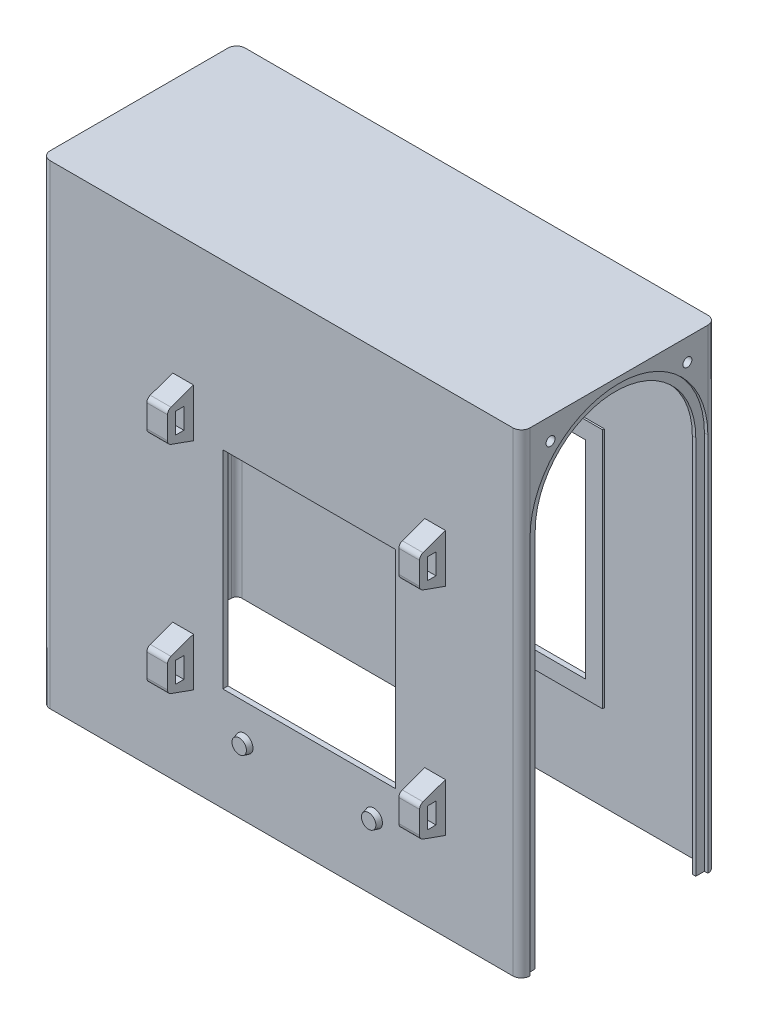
ISO-10303-21;
HEADER;
FILE_DESCRIPTION(('STEP AP214'),'2;1');
FILE_NAME('part.step','',(''),(''),'','','');
FILE_SCHEMA(('AUTOMOTIVE_DESIGN { 1 0 10303 214 1 1 1 1 }'));
ENDSEC;
DATA;
#1=APPLICATION_CONTEXT('core data for automotive mechanical design processes');
#2=APPLICATION_PROTOCOL_DEFINITION('international standard','automotive_design',2000,#1);
#3=PRODUCT_CONTEXT('',#1,'mechanical');
#4=PRODUCT('Part','Part','',(#3));
#5=PRODUCT_RELATED_PRODUCT_CATEGORY('part','',(#4));
#6=PRODUCT_DEFINITION_FORMATION('','',#4);
#7=PRODUCT_DEFINITION_CONTEXT('part definition',#1,'design');
#8=PRODUCT_DEFINITION('design','',#6,#7);
#9=PRODUCT_DEFINITION_SHAPE('','',#8);
#10=(LENGTH_UNIT() NAMED_UNIT(*) SI_UNIT(.MILLI.,.METRE.));
#11=(NAMED_UNIT(*) PLANE_ANGLE_UNIT() SI_UNIT($,.RADIAN.));
#12=(NAMED_UNIT(*) SI_UNIT($,.STERADIAN.) SOLID_ANGLE_UNIT());
#13=UNCERTAINTY_MEASURE_WITH_UNIT(LENGTH_MEASURE(1.E-05),#10,'distance_accuracy_value','');
#14=(GEOMETRIC_REPRESENTATION_CONTEXT(3) GLOBAL_UNCERTAINTY_ASSIGNED_CONTEXT((#13)) GLOBAL_UNIT_ASSIGNED_CONTEXT((#10,
#11,#12)) REPRESENTATION_CONTEXT('',''));
#15=CARTESIAN_POINT('',(0.,0.,0.));
#16=DIRECTION('',(0.,0.,1.));
#17=DIRECTION('',(1.,0.,0.));
#18=AXIS2_PLACEMENT_3D('',#15,#16,#17);
#19=CARTESIAN_POINT('',(83.,79.,-71.5));
#20=DIRECTION('',(-1.,0.,0.));
#21=DIRECTION('',(0.,0.,1.));
#22=AXIS2_PLACEMENT_3D('',#19,#20,#21);
#23=PLANE('',#22);
#24=DIRECTION('',(0.,0.,-1.));
#25=VECTOR('',#24,1.);
#26=CARTESIAN_POINT('',(83.,59.0000000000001,-71.5));
#27=LINE('',#26,#25);
#28=CARTESIAN_POINT('',(83.,59.0000000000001,-62.));
#29=VERTEX_POINT('',#28);
#30=CARTESIAN_POINT('',(83.,59.0000000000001,-67.));
#31=VERTEX_POINT('',#30);
#32=EDGE_CURVE('E1682',#29,#31,#27,.T.);
#33=ORIENTED_EDGE('',*,*,#32,.T.);
#34=DIRECTION('',(0.,1.,0.));
#35=VECTOR('',#34,1.);
#36=CARTESIAN_POINT('',(83.,79.,-67.));
#37=LINE('',#36,#35);
#38=CARTESIAN_POINT('',(83.,71.0000000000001,-67.));
#39=VERTEX_POINT('',#38);
#40=EDGE_CURVE('E1700',#31,#39,#37,.T.);
#41=ORIENTED_EDGE('',*,*,#40,.T.);
#42=DIRECTION('',(0.,0.,1.));
#43=VECTOR('',#42,1.);
#44=CARTESIAN_POINT('',(83.,71.0000000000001,-71.5));
#45=LINE('',#44,#43);
#46=CARTESIAN_POINT('',(83.,71.0000000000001,-62.));
#47=VERTEX_POINT('',#46);
#48=EDGE_CURVE('E1694',#39,#47,#45,.T.);
#49=ORIENTED_EDGE('',*,*,#48,.T.);
#50=DIRECTION('',(0.,-1.,0.));
#51=VECTOR('',#50,1.);
#52=CARTESIAN_POINT('',(83.,79.,-62.));
#53=LINE('',#52,#51);
#54=EDGE_CURVE('E1688',#47,#29,#53,.T.);
#55=ORIENTED_EDGE('',*,*,#54,.T.);
#56=EDGE_LOOP('',(#33,#41,#49,#55));
#57=FACE_BOUND('',#56,.T.);
#58=DIRECTION('',(0.,-1.,0.));
#59=VECTOR('',#58,1.);
#60=CARTESIAN_POINT('',(83.,79.,-71.5));
#61=LINE('',#60,#59);
#62=CARTESIAN_POINT('',(83.,71.5258971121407,-71.5));
#63=VERTEX_POINT('',#62);
#64=CARTESIAN_POINT('',(83.,58.4741028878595,-71.5));
#65=VERTEX_POINT('',#64);
#66=EDGE_CURVE('E806',#63,#65,#61,.T.);
#67=ORIENTED_EDGE('',*,*,#66,.T.);
#68=CARTESIAN_POINT('',(83.,58.4741028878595,-68.5));
#69=DIRECTION('',(-1.,0.,0.));
#70=DIRECTION('',(0.,0.,1.));
#71=AXIS2_PLACEMENT_3D('',#68,#69,#70);
#72=CIRCLE('',#71,3.);
#73=CARTESIAN_POINT('',(83.,55.6490699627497,-69.5095488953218));
#74=VERTEX_POINT('',#73);
#75=EDGE_CURVE('E1498',#65,#74,#72,.T.);
#76=ORIENTED_EDGE('',*,*,#75,.T.);
#77=DIRECTION('',(0.,-0.336516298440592,0.941677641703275));
#78=VECTOR('',#77,1.);
#79=CARTESIAN_POINT('',(83.,58.9241582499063,-78.6742681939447));
#80=LINE('',#79,#78);
#81=CARTESIAN_POINT('',(83.,51.0000000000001,-56.5));
#82=VERTEX_POINT('',#81);
#83=EDGE_CURVE('E1652',#74,#82,#80,.T.);
#84=ORIENTED_EDGE('',*,*,#83,.T.);
#85=DIRECTION('',(0.,-1.,0.));
#86=VECTOR('',#85,1.);
#87=CARTESIAN_POINT('',(83.,79.,-56.5));
#88=LINE('',#87,#86);
#89=CARTESIAN_POINT('',(83.,79.0000000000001,-56.5));
#90=VERTEX_POINT('',#89);
#91=EDGE_CURVE('E814',#90,#82,#88,.T.);
#92=ORIENTED_EDGE('',*,*,#91,.F.);
#93=DIRECTION('',(0.,-0.336516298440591,-0.941677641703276));
#94=VECTOR('',#93,1.);
#95=CARTESIAN_POINT('',(83.,74.2466518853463,-69.8013517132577));
#96=LINE('',#95,#94);
#97=CARTESIAN_POINT('',(83.,74.3509300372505,-69.5095488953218));
#98=VERTEX_POINT('',#97);
#99=EDGE_CURVE('E1645',#90,#98,#96,.T.);
#100=ORIENTED_EDGE('',*,*,#99,.T.);
#101=CARTESIAN_POINT('',(83.,71.5258971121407,-68.5));
#102=DIRECTION('',(-1.,0.,0.));
#103=DIRECTION('',(0.,0.,1.));
#104=AXIS2_PLACEMENT_3D('',#101,#102,#103);
#105=CIRCLE('',#104,3.);
#106=EDGE_CURVE('E1496',#98,#63,#105,.T.);
#107=ORIENTED_EDGE('',*,*,#106,.T.);
#108=EDGE_LOOP('',(#67,#76,#84,#92,#100,#107));
#109=FACE_BOUND('',#108,.T.);
#110=ADVANCED_FACE('F35',(#57,#109),#23,.T.);
#111=CARTESIAN_POINT('',(95.,79.,-71.5));
#112=DIRECTION('',(1.,0.,0.));
#113=DIRECTION('',(0.,0.,-1.));
#114=AXIS2_PLACEMENT_3D('',#111,#112,#113);
#115=PLANE('',#114);
#116=DIRECTION('',(0.,0.,-1.));
#117=VECTOR('',#116,1.);
#118=CARTESIAN_POINT('',(95.,71.0000000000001,-71.5));
#119=LINE('',#118,#117);
#120=CARTESIAN_POINT('',(95.,71.0000000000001,-62.));
#121=VERTEX_POINT('',#120);
#122=CARTESIAN_POINT('',(95.,71.0000000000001,-67.));
#123=VERTEX_POINT('',#122);
#124=EDGE_CURVE('E1691',#121,#123,#119,.T.);
#125=ORIENTED_EDGE('',*,*,#124,.T.);
#126=DIRECTION('',(0.,-1.,0.));
#127=VECTOR('',#126,1.);
#128=CARTESIAN_POINT('',(95.,79.,-67.));
#129=LINE('',#128,#127);
#130=CARTESIAN_POINT('',(95.,59.0000000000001,-67.));
#131=VERTEX_POINT('',#130);
#132=EDGE_CURVE('E1697',#123,#131,#129,.T.);
#133=ORIENTED_EDGE('',*,*,#132,.T.);
#134=DIRECTION('',(0.,0.,1.));
#135=VECTOR('',#134,1.);
#136=CARTESIAN_POINT('',(95.,59.0000000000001,-71.5));
#137=LINE('',#136,#135);
#138=CARTESIAN_POINT('',(95.,59.0000000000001,-62.));
#139=VERTEX_POINT('',#138);
#140=EDGE_CURVE('E1679',#131,#139,#137,.T.);
#141=ORIENTED_EDGE('',*,*,#140,.T.);
#142=DIRECTION('',(0.,1.,0.));
#143=VECTOR('',#142,1.);
#144=CARTESIAN_POINT('',(95.,79.,-62.));
#145=LINE('',#144,#143);
#146=EDGE_CURVE('E1685',#139,#121,#145,.T.);
#147=ORIENTED_EDGE('',*,*,#146,.T.);
#148=EDGE_LOOP('',(#125,#133,#141,#147));
#149=FACE_BOUND('',#148,.T.);
#150=DIRECTION('',(0.,0.336516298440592,-0.941677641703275));
#151=VECTOR('',#150,1.);
#152=CARTESIAN_POINT('',(95.,58.9241582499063,-78.6742681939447));
#153=LINE('',#152,#151);
#154=CARTESIAN_POINT('',(95.,51.0000000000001,-56.5));
#155=VERTEX_POINT('',#154);
#156=CARTESIAN_POINT('',(95.,55.6490699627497,-69.5095488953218));
#157=VERTEX_POINT('',#156);
#158=EDGE_CURVE('E1649',#155,#157,#153,.T.);
#159=ORIENTED_EDGE('',*,*,#158,.T.);
#160=CARTESIAN_POINT('',(95.,58.4741028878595,-68.5));
#161=DIRECTION('',(1.,0.,0.));
#162=DIRECTION('',(0.,0.,-1.));
#163=AXIS2_PLACEMENT_3D('',#160,#161,#162);
#164=CIRCLE('',#163,3.);
#165=CARTESIAN_POINT('',(95.,58.4741028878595,-71.5));
#166=VERTEX_POINT('',#165);
#167=EDGE_CURVE('E1504',#157,#166,#164,.T.);
#168=ORIENTED_EDGE('',*,*,#167,.T.);
#169=DIRECTION('',(0.,1.,0.));
#170=VECTOR('',#169,1.);
#171=CARTESIAN_POINT('',(95.,79.,-71.5));
#172=LINE('',#171,#170);
#173=CARTESIAN_POINT('',(95.,71.5258971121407,-71.5));
#174=VERTEX_POINT('',#173);
#175=EDGE_CURVE('E809',#166,#174,#172,.T.);
#176=ORIENTED_EDGE('',*,*,#175,.T.);
#177=CARTESIAN_POINT('',(95.,71.5258971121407,-68.5));
#178=DIRECTION('',(1.,0.,0.));
#179=DIRECTION('',(0.,0.,-1.));
#180=AXIS2_PLACEMENT_3D('',#177,#178,#179);
#181=CIRCLE('',#180,3.);
#182=CARTESIAN_POINT('',(95.,74.3509300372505,-69.5095488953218));
#183=VERTEX_POINT('',#182);
#184=EDGE_CURVE('E1502',#174,#183,#181,.T.);
#185=ORIENTED_EDGE('',*,*,#184,.T.);
#186=DIRECTION('',(0.,0.336516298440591,0.941677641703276));
#187=VECTOR('',#186,1.);
#188=CARTESIAN_POINT('',(95.,74.2466518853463,-69.8013517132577));
#189=LINE('',#188,#187);
#190=CARTESIAN_POINT('',(95.,79.0000000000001,-56.5));
#191=VERTEX_POINT('',#190);
#192=EDGE_CURVE('E1643',#183,#191,#189,.T.);
#193=ORIENTED_EDGE('',*,*,#192,.T.);
#194=DIRECTION('',(0.,1.,0.));
#195=VECTOR('',#194,1.);
#196=CARTESIAN_POINT('',(95.,79.,-56.5));
#197=LINE('',#196,#195);
#198=EDGE_CURVE('E820',#155,#191,#197,.T.);
#199=ORIENTED_EDGE('',*,*,#198,.F.);
#200=EDGE_LOOP('',(#159,#168,#176,#185,#193,#199));
#201=FACE_BOUND('',#200,.T.);
#202=ADVANCED_FACE('F1748',(#149,#201),#115,.T.);
#203=CARTESIAN_POINT('',(-62.9999999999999,79.,-71.5));
#204=DIRECTION('',(-1.,0.,0.));
#205=DIRECTION('',(0.,0.,1.));
#206=AXIS2_PLACEMENT_3D('',#203,#204,#205);
#207=PLANE('',#206);
#208=DIRECTION('',(0.,0.,-1.));
#209=VECTOR('',#208,1.);
#210=CARTESIAN_POINT('',(-63.,59.,-67.));
#211=LINE('',#210,#209);
#212=CARTESIAN_POINT('',(-63.,59.,-62.));
#213=VERTEX_POINT('',#212);
#214=CARTESIAN_POINT('',(-62.9999999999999,59.,-67.));
#215=VERTEX_POINT('',#214);
#216=EDGE_CURVE('E1657',#213,#215,#211,.T.);
#217=ORIENTED_EDGE('',*,*,#216,.T.);
#218=DIRECTION('',(0.,1.,0.));
#219=VECTOR('',#218,1.);
#220=CARTESIAN_POINT('',(-63.,71.,-67.));
#221=LINE('',#220,#219);
#222=CARTESIAN_POINT('',(-63.,71.,-67.));
#223=VERTEX_POINT('',#222);
#224=EDGE_CURVE('E1654',#215,#223,#221,.T.);
#225=ORIENTED_EDGE('',*,*,#224,.T.);
#226=DIRECTION('',(0.,0.,1.));
#227=VECTOR('',#226,1.);
#228=CARTESIAN_POINT('',(-63.,71.,-67.));
#229=LINE('',#228,#227);
#230=CARTESIAN_POINT('',(-63.,71.,-62.));
#231=VERTEX_POINT('',#230);
#232=EDGE_CURVE('E1663',#223,#231,#229,.T.);
#233=ORIENTED_EDGE('',*,*,#232,.T.);
#234=DIRECTION('',(0.,-1.,0.));
#235=VECTOR('',#234,1.);
#236=CARTESIAN_POINT('',(-63.,71.,-62.));
#237=LINE('',#236,#235);
#238=EDGE_CURVE('E1660',#231,#213,#237,.T.);
#239=ORIENTED_EDGE('',*,*,#238,.T.);
#240=EDGE_LOOP('',(#217,#225,#233,#239));
#241=FACE_BOUND('',#240,.T.);
#242=DIRECTION('',(0.,-1.,0.));
#243=VECTOR('',#242,1.);
#244=CARTESIAN_POINT('',(-62.9999999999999,79.,-71.5));
#245=LINE('',#244,#243);
#246=CARTESIAN_POINT('',(-62.9999999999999,71.5258971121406,-71.5));
#247=VERTEX_POINT('',#246);
#248=CARTESIAN_POINT('',(-62.9999999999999,58.4741028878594,-71.5));
#249=VERTEX_POINT('',#248);
#250=EDGE_CURVE('E790',#247,#249,#245,.T.);
#251=ORIENTED_EDGE('',*,*,#250,.T.);
#252=CARTESIAN_POINT('',(-62.9999999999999,58.4741028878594,-68.5));
#253=DIRECTION('',(-1.,0.,0.));
#254=DIRECTION('',(0.,0.,1.));
#255=AXIS2_PLACEMENT_3D('',#252,#253,#254);
#256=CIRCLE('',#255,3.);
#257=CARTESIAN_POINT('',(-63.,55.6490699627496,-69.5095488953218));
#258=VERTEX_POINT('',#257);
#259=EDGE_CURVE('E776',#249,#258,#256,.T.);
#260=ORIENTED_EDGE('',*,*,#259,.T.);
#261=DIRECTION('',(0.,-0.336516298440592,0.941677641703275));
#262=VECTOR('',#261,1.);
#263=CARTESIAN_POINT('',(-63.,51.,-56.5));
#264=LINE('',#263,#262);
#265=CARTESIAN_POINT('',(-63.,51.,-56.5));
#266=VERTEX_POINT('',#265);
#267=EDGE_CURVE('E768',#258,#266,#264,.T.);
#268=ORIENTED_EDGE('',*,*,#267,.T.);
#269=DIRECTION('',(0.,-1.,0.));
#270=VECTOR('',#269,1.);
#271=CARTESIAN_POINT('',(-62.9999999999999,79.,-56.5));
#272=LINE('',#271,#270);
#273=CARTESIAN_POINT('',(-63.,79.,-56.5));
#274=VERTEX_POINT('',#273);
#275=EDGE_CURVE('E774',#274,#266,#272,.T.);
#276=ORIENTED_EDGE('',*,*,#275,.F.);
#277=DIRECTION('',(0.,-0.336516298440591,-0.941677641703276));
#278=VECTOR('',#277,1.);
#279=CARTESIAN_POINT('',(-63.,79.,-56.5));
#280=LINE('',#279,#278);
#281=CARTESIAN_POINT('',(-63.,74.3509300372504,-69.5095488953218));
#282=VERTEX_POINT('',#281);
#283=EDGE_CURVE('E779',#274,#282,#280,.T.);
#284=ORIENTED_EDGE('',*,*,#283,.T.);
#285=CARTESIAN_POINT('',(-62.9999999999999,71.5258971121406,-68.5));
#286=DIRECTION('',(-1.,0.,0.));
#287=DIRECTION('',(0.,0.,1.));
#288=AXIS2_PLACEMENT_3D('',#285,#286,#287);
#289=CIRCLE('',#288,3.);
#290=EDGE_CURVE('E1515',#282,#247,#289,.T.);
#291=ORIENTED_EDGE('',*,*,#290,.T.);
#292=EDGE_LOOP('',(#251,#260,#268,#276,#284,#291));
#293=FACE_BOUND('',#292,.T.);
#294=ADVANCED_FACE('F771',(#241,#293),#207,.T.);
#295=CARTESIAN_POINT('',(-51.,79.,-71.5));
#296=DIRECTION('',(1.,0.,0.));
#297=DIRECTION('',(0.,0.,-1.));
#298=AXIS2_PLACEMENT_3D('',#295,#296,#297);
#299=PLANE('',#298);
#300=DIRECTION('',(0.,0.,-1.));
#301=VECTOR('',#300,1.);
#302=CARTESIAN_POINT('',(-51.,71.,-71.5));
#303=LINE('',#302,#301);
#304=CARTESIAN_POINT('',(-51.,71.,-62.));
#305=VERTEX_POINT('',#304);
#306=CARTESIAN_POINT('',(-51.,71.,-67.));
#307=VERTEX_POINT('',#306);
#308=EDGE_CURVE('E1473',#305,#307,#303,.T.);
#309=ORIENTED_EDGE('',*,*,#308,.T.);
#310=DIRECTION('',(0.,-1.,0.));
#311=VECTOR('',#310,1.);
#312=CARTESIAN_POINT('',(-51.,79.,-67.));
#313=LINE('',#312,#311);
#314=CARTESIAN_POINT('',(-51.,59.,-67.));
#315=VERTEX_POINT('',#314);
#316=EDGE_CURVE('E1476',#307,#315,#313,.T.);
#317=ORIENTED_EDGE('',*,*,#316,.T.);
#318=DIRECTION('',(0.,0.,1.));
#319=VECTOR('',#318,1.);
#320=CARTESIAN_POINT('',(-51.,59.,-71.5));
#321=LINE('',#320,#319);
#322=CARTESIAN_POINT('',(-51.,59.,-62.));
#323=VERTEX_POINT('',#322);
#324=EDGE_CURVE('E1467',#315,#323,#321,.T.);
#325=ORIENTED_EDGE('',*,*,#324,.T.);
#326=DIRECTION('',(0.,1.,0.));
#327=VECTOR('',#326,1.);
#328=CARTESIAN_POINT('',(-51.,79.,-62.));
#329=LINE('',#328,#327);
#330=EDGE_CURVE('E1470',#323,#305,#329,.T.);
#331=ORIENTED_EDGE('',*,*,#330,.T.);
#332=EDGE_LOOP('',(#309,#317,#325,#331));
#333=FACE_BOUND('',#332,.T.);
#334=DIRECTION('',(0.,0.336516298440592,-0.941677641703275));
#335=VECTOR('',#334,1.);
#336=CARTESIAN_POINT('',(-51.,58.9241582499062,-78.6742681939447));
#337=LINE('',#336,#335);
#338=CARTESIAN_POINT('',(-51.,51.,-56.5));
#339=VERTEX_POINT('',#338);
#340=CARTESIAN_POINT('',(-51.,55.6490699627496,-69.5095488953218));
#341=VERTEX_POINT('',#340);
#342=EDGE_CURVE('E786',#339,#341,#337,.T.);
#343=ORIENTED_EDGE('',*,*,#342,.T.);
#344=CARTESIAN_POINT('',(-51.,58.4741028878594,-68.5));
#345=DIRECTION('',(1.,0.,0.));
#346=DIRECTION('',(0.,0.,-1.));
#347=AXIS2_PLACEMENT_3D('',#344,#345,#346);
#348=CIRCLE('',#347,3.);
#349=CARTESIAN_POINT('',(-51.,58.4741028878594,-71.5));
#350=VERTEX_POINT('',#349);
#351=EDGE_CURVE('E1522',#341,#350,#348,.T.);
#352=ORIENTED_EDGE('',*,*,#351,.T.);
#353=DIRECTION('',(0.,1.,0.));
#354=VECTOR('',#353,1.);
#355=CARTESIAN_POINT('',(-51.,79.,-71.5));
#356=LINE('',#355,#354);
#357=CARTESIAN_POINT('',(-51.,71.5258971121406,-71.5));
#358=VERTEX_POINT('',#357);
#359=EDGE_CURVE('E802',#350,#358,#356,.T.);
#360=ORIENTED_EDGE('',*,*,#359,.T.);
#361=CARTESIAN_POINT('',(-51.,71.5258971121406,-68.5));
#362=DIRECTION('',(1.,0.,0.));
#363=DIRECTION('',(0.,0.,-1.));
#364=AXIS2_PLACEMENT_3D('',#361,#362,#363);
#365=CIRCLE('',#364,3.);
#366=CARTESIAN_POINT('',(-51.,74.3509300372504,-69.5095488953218));
#367=VERTEX_POINT('',#366);
#368=EDGE_CURVE('E1520',#358,#367,#365,.T.);
#369=ORIENTED_EDGE('',*,*,#368,.T.);
#370=DIRECTION('',(0.,0.336516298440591,0.941677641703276));
#371=VECTOR('',#370,1.);
#372=CARTESIAN_POINT('',(-51.,74.2466518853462,-69.8013517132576));
#373=LINE('',#372,#371);
#374=CARTESIAN_POINT('',(-51.,79.,-56.5));
#375=VERTEX_POINT('',#374);
#376=EDGE_CURVE('E1641',#367,#375,#373,.T.);
#377=ORIENTED_EDGE('',*,*,#376,.T.);
#378=DIRECTION('',(0.,1.,0.));
#379=VECTOR('',#378,1.);
#380=CARTESIAN_POINT('',(-51.,79.,-56.5));
#381=LINE('',#380,#379);
#382=EDGE_CURVE('E791',#339,#375,#381,.T.);
#383=ORIENTED_EDGE('',*,*,#382,.F.);
#384=EDGE_LOOP('',(#343,#352,#360,#369,#377,#383));
#385=FACE_BOUND('',#384,.T.);
#386=ADVANCED_FACE('F1720',(#333,#385),#299,.T.);
#387=CARTESIAN_POINT('',(83.,204.,-71.5));
#388=DIRECTION('',(-1.,0.,0.));
#389=DIRECTION('',(0.,0.,1.));
#390=AXIS2_PLACEMENT_3D('',#387,#388,#389);
#391=PLANE('',#390);
#392=DIRECTION('',(0.,0.,-1.));
#393=VECTOR('',#392,1.);
#394=CARTESIAN_POINT('',(83.,184.,-71.5));
#395=LINE('',#394,#393);
#396=CARTESIAN_POINT('',(83.,184.,-62.));
#397=VERTEX_POINT('',#396);
#398=CARTESIAN_POINT('',(83.,184.,-67.));
#399=VERTEX_POINT('',#398);
#400=EDGE_CURVE('E1620',#397,#399,#395,.T.);
#401=ORIENTED_EDGE('',*,*,#400,.T.);
#402=DIRECTION('',(0.,1.,0.));
#403=VECTOR('',#402,1.);
#404=CARTESIAN_POINT('',(83.,204.,-67.));
#405=LINE('',#404,#403);
#406=CARTESIAN_POINT('',(83.,196.,-67.));
#407=VERTEX_POINT('',#406);
#408=EDGE_CURVE('E1638',#399,#407,#405,.T.);
#409=ORIENTED_EDGE('',*,*,#408,.T.);
#410=DIRECTION('',(0.,0.,1.));
#411=VECTOR('',#410,1.);
#412=CARTESIAN_POINT('',(83.,196.,-71.5));
#413=LINE('',#412,#411);
#414=CARTESIAN_POINT('',(83.,196.,-62.));
#415=VERTEX_POINT('',#414);
#416=EDGE_CURVE('E1632',#407,#415,#413,.T.);
#417=ORIENTED_EDGE('',*,*,#416,.T.);
#418=DIRECTION('',(0.,-1.,0.));
#419=VECTOR('',#418,1.);
#420=CARTESIAN_POINT('',(83.,204.,-62.));
#421=LINE('',#420,#419);
#422=EDGE_CURVE('E1626',#415,#397,#421,.T.);
#423=ORIENTED_EDGE('',*,*,#422,.T.);
#424=EDGE_LOOP('',(#401,#409,#417,#423));
#425=FACE_BOUND('',#424,.T.);
#426=DIRECTION('',(0.,-1.,0.));
#427=VECTOR('',#426,1.);
#428=CARTESIAN_POINT('',(83.,204.,-71.5));
#429=LINE('',#428,#427);
#430=CARTESIAN_POINT('',(83.,196.525897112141,-71.5));
#431=VERTEX_POINT('',#430);
#432=CARTESIAN_POINT('',(83.,183.47410288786,-71.5));
#433=VERTEX_POINT('',#432);
#434=EDGE_CURVE('E825',#431,#433,#429,.T.);
#435=ORIENTED_EDGE('',*,*,#434,.T.);
#436=CARTESIAN_POINT('',(83.,183.47410288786,-68.5));
#437=DIRECTION('',(-1.,0.,0.));
#438=DIRECTION('',(0.,0.,1.));
#439=AXIS2_PLACEMENT_3D('',#436,#437,#438);
#440=CIRCLE('',#439,3.);
#441=CARTESIAN_POINT('',(83.,180.64906996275,-69.5095488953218));
#442=VERTEX_POINT('',#441);
#443=EDGE_CURVE('E1533',#433,#442,#440,.T.);
#444=ORIENTED_EDGE('',*,*,#443,.T.);
#445=DIRECTION('',(0.,-0.33651629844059,0.941677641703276));
#446=VECTOR('',#445,1.);
#447=CARTESIAN_POINT('',(83.,183.924158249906,-78.6742681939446));
#448=LINE('',#447,#446);
#449=CARTESIAN_POINT('',(83.,176.,-56.5));
#450=VERTEX_POINT('',#449);
#451=EDGE_CURVE('E1608',#442,#450,#448,.T.);
#452=ORIENTED_EDGE('',*,*,#451,.T.);
#453=DIRECTION('',(0.,-1.,0.));
#454=VECTOR('',#453,1.);
#455=CARTESIAN_POINT('',(83.,204.,-56.5));
#456=LINE('',#455,#454);
#457=CARTESIAN_POINT('',(83.,204.,-56.5));
#458=VERTEX_POINT('',#457);
#459=EDGE_CURVE('E813',#458,#450,#456,.T.);
#460=ORIENTED_EDGE('',*,*,#459,.F.);
#461=DIRECTION('',(0.,-0.336516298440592,-0.941677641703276));
#462=VECTOR('',#461,1.);
#463=CARTESIAN_POINT('',(83.,199.246651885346,-69.8013517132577));
#464=LINE('',#463,#462);
#465=CARTESIAN_POINT('',(83.,199.350930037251,-69.5095488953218));
#466=VERTEX_POINT('',#465);
#467=EDGE_CURVE('E1614',#458,#466,#464,.T.);
#468=ORIENTED_EDGE('',*,*,#467,.T.);
#469=CARTESIAN_POINT('',(83.,196.525897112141,-68.5));
#470=DIRECTION('',(-1.,0.,0.));
#471=DIRECTION('',(0.,0.,1.));
#472=AXIS2_PLACEMENT_3D('',#469,#470,#471);
#473=CIRCLE('',#472,3.);
#474=EDGE_CURVE('E1531',#466,#431,#473,.T.);
#475=ORIENTED_EDGE('',*,*,#474,.T.);
#476=EDGE_LOOP('',(#435,#444,#452,#460,#468,#475));
#477=FACE_BOUND('',#476,.T.);
#478=ADVANCED_FACE('F1767',(#425,#477),#391,.T.);
#479=CARTESIAN_POINT('',(95.,204.,-71.5));
#480=DIRECTION('',(1.,0.,0.));
#481=DIRECTION('',(0.,0.,-1.));
#482=AXIS2_PLACEMENT_3D('',#479,#480,#481);
#483=PLANE('',#482);
#484=DIRECTION('',(0.,0.,-1.));
#485=VECTOR('',#484,1.);
#486=CARTESIAN_POINT('',(95.,196.,-71.5));
#487=LINE('',#486,#485);
#488=CARTESIAN_POINT('',(95.,196.,-62.));
#489=VERTEX_POINT('',#488);
#490=CARTESIAN_POINT('',(95.,196.,-67.));
#491=VERTEX_POINT('',#490);
#492=EDGE_CURVE('E1629',#489,#491,#487,.T.);
#493=ORIENTED_EDGE('',*,*,#492,.T.);
#494=DIRECTION('',(0.,-1.,0.));
#495=VECTOR('',#494,1.);
#496=CARTESIAN_POINT('',(95.,204.,-67.));
#497=LINE('',#496,#495);
#498=CARTESIAN_POINT('',(95.,184.,-67.));
#499=VERTEX_POINT('',#498);
#500=EDGE_CURVE('E1635',#491,#499,#497,.T.);
#501=ORIENTED_EDGE('',*,*,#500,.T.);
#502=DIRECTION('',(0.,0.,1.));
#503=VECTOR('',#502,1.);
#504=CARTESIAN_POINT('',(95.,184.,-71.5));
#505=LINE('',#504,#503);
#506=CARTESIAN_POINT('',(95.,184.,-62.));
#507=VERTEX_POINT('',#506);
#508=EDGE_CURVE('E1617',#499,#507,#505,.T.);
#509=ORIENTED_EDGE('',*,*,#508,.T.);
#510=DIRECTION('',(0.,1.,0.));
#511=VECTOR('',#510,1.);
#512=CARTESIAN_POINT('',(95.,204.,-62.));
#513=LINE('',#512,#511);
#514=EDGE_CURVE('E1623',#507,#489,#513,.T.);
#515=ORIENTED_EDGE('',*,*,#514,.T.);
#516=EDGE_LOOP('',(#493,#501,#509,#515));
#517=FACE_BOUND('',#516,.T.);
#518=DIRECTION('',(0.,0.33651629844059,-0.941677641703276));
#519=VECTOR('',#518,1.);
#520=CARTESIAN_POINT('',(95.,183.924158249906,-78.6742681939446));
#521=LINE('',#520,#519);
#522=CARTESIAN_POINT('',(95.,176.,-56.5));
#523=VERTEX_POINT('',#522);
#524=CARTESIAN_POINT('',(95.,180.64906996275,-69.5095488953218));
#525=VERTEX_POINT('',#524);
#526=EDGE_CURVE('E1605',#523,#525,#521,.T.);
#527=ORIENTED_EDGE('',*,*,#526,.T.);
#528=CARTESIAN_POINT('',(95.,183.47410288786,-68.5));
#529=DIRECTION('',(1.,0.,0.));
#530=DIRECTION('',(0.,0.,-1.));
#531=AXIS2_PLACEMENT_3D('',#528,#529,#530);
#532=CIRCLE('',#531,3.);
#533=CARTESIAN_POINT('',(95.,183.47410288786,-71.5));
#534=VERTEX_POINT('',#533);
#535=EDGE_CURVE('E1539',#525,#534,#532,.T.);
#536=ORIENTED_EDGE('',*,*,#535,.T.);
#537=DIRECTION('',(0.,1.,0.));
#538=VECTOR('',#537,1.);
#539=CARTESIAN_POINT('',(95.,204.,-71.5));
#540=LINE('',#539,#538);
#541=CARTESIAN_POINT('',(95.,196.525897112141,-71.5));
#542=VERTEX_POINT('',#541);
#543=EDGE_CURVE('E828',#534,#542,#540,.T.);
#544=ORIENTED_EDGE('',*,*,#543,.T.);
#545=CARTESIAN_POINT('',(95.,196.525897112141,-68.5));
#546=DIRECTION('',(1.,0.,0.));
#547=DIRECTION('',(0.,0.,-1.));
#548=AXIS2_PLACEMENT_3D('',#545,#546,#547);
#549=CIRCLE('',#548,3.);
#550=CARTESIAN_POINT('',(95.,199.350930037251,-69.5095488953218));
#551=VERTEX_POINT('',#550);
#552=EDGE_CURVE('E1537',#542,#551,#549,.T.);
#553=ORIENTED_EDGE('',*,*,#552,.T.);
#554=DIRECTION('',(0.,0.336516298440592,0.941677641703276));
#555=VECTOR('',#554,1.);
#556=CARTESIAN_POINT('',(95.,199.246651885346,-69.8013517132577));
#557=LINE('',#556,#555);
#558=CARTESIAN_POINT('',(95.,204.,-56.5));
#559=VERTEX_POINT('',#558);
#560=EDGE_CURVE('E1612',#551,#559,#557,.T.);
#561=ORIENTED_EDGE('',*,*,#560,.T.);
#562=DIRECTION('',(0.,1.,0.));
#563=VECTOR('',#562,1.);
#564=CARTESIAN_POINT('',(95.,204.,-56.5));
#565=LINE('',#564,#563);
#566=EDGE_CURVE('E838',#523,#559,#565,.T.);
#567=ORIENTED_EDGE('',*,*,#566,.F.);
#568=EDGE_LOOP('',(#527,#536,#544,#553,#561,#567));
#569=FACE_BOUND('',#568,.T.);
#570=ADVANCED_FACE('F1763',(#517,#569),#483,.T.);
#571=CARTESIAN_POINT('',(0.,0.,-71.5));
#572=DIRECTION('',(0.,0.,-1.));
#573=DIRECTION('',(1.,0.,0.));
#574=AXIS2_PLACEMENT_3D('',#571,#572,#573);
#575=PLANE('',#574);
#576=ORIENTED_EDGE('',*,*,#543,.F.);
#577=DIRECTION('',(-1.,0.,0.));
#578=VECTOR('',#577,1.);
#579=CARTESIAN_POINT('',(-1.27310733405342E-13,183.474102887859,-71.5));
#580=LINE('',#579,#578);
#581=EDGE_CURVE('E1528',#534,#433,#580,.T.);
#582=ORIENTED_EDGE('',*,*,#581,.T.);
#583=ORIENTED_EDGE('',*,*,#434,.F.);
#584=DIRECTION('',(-1.,0.,0.));
#585=VECTOR('',#584,1.);
#586=CARTESIAN_POINT('',(-1.36367234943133E-13,196.525897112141,-71.5));
#587=LINE('',#586,#585);
#588=EDGE_CURVE('E1526',#431,#542,#587,.F.);
#589=ORIENTED_EDGE('',*,*,#588,.T.);
#590=EDGE_LOOP('',(#576,#582,#583,#589));
#591=FACE_BOUND('',#590,.T.);
#592=ADVANCED_FACE('F1759',(#591),#575,.T.);
#593=CARTESIAN_POINT('',(0.,0.,-71.5));
#594=DIRECTION('',(0.,0.,-1.));
#595=DIRECTION('',(1.,0.,0.));
#596=AXIS2_PLACEMENT_3D('',#593,#594,#595);
#597=PLANE('',#596);
#598=ORIENTED_EDGE('',*,*,#175,.F.);
#599=DIRECTION('',(-1.,0.,0.));
#600=VECTOR('',#599,1.);
#601=CARTESIAN_POINT('',(0.,58.4741028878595,-71.5));
#602=LINE('',#601,#600);
#603=EDGE_CURVE('E1493',#166,#65,#602,.T.);
#604=ORIENTED_EDGE('',*,*,#603,.T.);
#605=ORIENTED_EDGE('',*,*,#66,.F.);
#606=DIRECTION('',(-1.,0.,0.));
#607=VECTOR('',#606,1.);
#608=CARTESIAN_POINT('',(0.,71.5258971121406,-71.5));
#609=LINE('',#608,#607);
#610=EDGE_CURVE('E1491',#63,#174,#609,.F.);
#611=ORIENTED_EDGE('',*,*,#610,.T.);
#612=EDGE_LOOP('',(#598,#604,#605,#611));
#613=FACE_BOUND('',#612,.T.);
#614=ADVANCED_FACE('F1762',(#613),#597,.T.);
#615=CARTESIAN_POINT('',(0.,0.,-71.5));
#616=DIRECTION('',(0.,0.,-1.));
#617=DIRECTION('',(1.,0.,0.));
#618=AXIS2_PLACEMENT_3D('',#615,#616,#617);
#619=PLANE('',#618);
#620=ORIENTED_EDGE('',*,*,#359,.F.);
#621=DIRECTION('',(-1.,0.,0.));
#622=VECTOR('',#621,1.);
#623=CARTESIAN_POINT('',(0.,58.4741028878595,-71.5));
#624=LINE('',#623,#622);
#625=EDGE_CURVE('E1512',#350,#249,#624,.T.);
#626=ORIENTED_EDGE('',*,*,#625,.T.);
#627=ORIENTED_EDGE('',*,*,#250,.F.);
#628=DIRECTION('',(1.,0.,0.));
#629=VECTOR('',#628,1.);
#630=CARTESIAN_POINT('',(0.,71.5258971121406,-71.5));
#631=LINE('',#630,#629);
#632=EDGE_CURVE('E1509',#247,#358,#631,.T.);
#633=ORIENTED_EDGE('',*,*,#632,.T.);
#634=EDGE_LOOP('',(#620,#626,#627,#633));
#635=FACE_BOUND('',#634,.T.);
#636=ADVANCED_FACE('F1725',(#635),#619,.T.);
#637=CARTESIAN_POINT('',(-62.9999999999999,204.,-71.5));
#638=DIRECTION('',(-1.,0.,0.));
#639=DIRECTION('',(0.,0.,1.));
#640=AXIS2_PLACEMENT_3D('',#637,#638,#639);
#641=PLANE('',#640);
#642=DIRECTION('',(0.,0.,-1.));
#643=VECTOR('',#642,1.);
#644=CARTESIAN_POINT('',(-63.0000000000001,184.,-67.));
#645=LINE('',#644,#643);
#646=CARTESIAN_POINT('',(-63.0000000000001,184.,-62.));
#647=VERTEX_POINT('',#646);
#648=CARTESIAN_POINT('',(-62.9999999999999,184.,-67.));
#649=VERTEX_POINT('',#648);
#650=EDGE_CURVE('E1580',#647,#649,#645,.T.);
#651=ORIENTED_EDGE('',*,*,#650,.T.);
#652=DIRECTION('',(0.,1.,0.));
#653=VECTOR('',#652,1.);
#654=CARTESIAN_POINT('',(-63.0000000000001,196.,-67.));
#655=LINE('',#654,#653);
#656=CARTESIAN_POINT('',(-63.0000000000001,196.,-67.));
#657=VERTEX_POINT('',#656);
#658=EDGE_CURVE('E1577',#649,#657,#655,.T.);
#659=ORIENTED_EDGE('',*,*,#658,.T.);
#660=DIRECTION('',(0.,0.,1.));
#661=VECTOR('',#660,1.);
#662=CARTESIAN_POINT('',(-63.0000000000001,196.,-67.));
#663=LINE('',#662,#661);
#664=CARTESIAN_POINT('',(-63.0000000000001,196.,-62.));
#665=VERTEX_POINT('',#664);
#666=EDGE_CURVE('E1586',#657,#665,#663,.T.);
#667=ORIENTED_EDGE('',*,*,#666,.T.);
#668=DIRECTION('',(0.,-1.,0.));
#669=VECTOR('',#668,1.);
#670=CARTESIAN_POINT('',(-63.0000000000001,196.,-62.));
#671=LINE('',#670,#669);
#672=EDGE_CURVE('E1583',#665,#647,#671,.T.);
#673=ORIENTED_EDGE('',*,*,#672,.T.);
#674=EDGE_LOOP('',(#651,#659,#667,#673));
#675=FACE_BOUND('',#674,.T.);
#676=DIRECTION('',(0.,-1.,0.));
#677=VECTOR('',#676,1.);
#678=CARTESIAN_POINT('',(-62.9999999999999,204.,-71.5));
#679=LINE('',#678,#677);
#680=CARTESIAN_POINT('',(-62.9999999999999,196.525897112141,-71.5));
#681=VERTEX_POINT('',#680);
#682=CARTESIAN_POINT('',(-62.9999999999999,183.474102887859,-71.5));
#683=VERTEX_POINT('',#682);
#684=EDGE_CURVE('E799',#681,#683,#679,.T.);
#685=ORIENTED_EDGE('',*,*,#684,.T.);
#686=CARTESIAN_POINT('',(-62.9999999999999,183.474102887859,-68.5));
#687=DIRECTION('',(-1.,0.,0.));
#688=DIRECTION('',(0.,0.,1.));
#689=AXIS2_PLACEMENT_3D('',#686,#687,#688);
#690=CIRCLE('',#689,3.);
#691=CARTESIAN_POINT('',(-63.0000000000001,180.64906996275,-69.5095488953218));
#692=VERTEX_POINT('',#691);
#693=EDGE_CURVE('E1552',#683,#692,#690,.T.);
#694=ORIENTED_EDGE('',*,*,#693,.T.);
#695=DIRECTION('',(0.,-0.33651629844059,0.941677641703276));
#696=VECTOR('',#695,1.);
#697=CARTESIAN_POINT('',(-63.0000000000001,176.,-56.5));
#698=LINE('',#697,#696);
#699=CARTESIAN_POINT('',(-63.0000000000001,176.,-56.5));
#700=VERTEX_POINT('',#699);
#701=EDGE_CURVE('E780',#692,#700,#698,.T.);
#702=ORIENTED_EDGE('',*,*,#701,.T.);
#703=DIRECTION('',(0.,-1.,0.));
#704=VECTOR('',#703,1.);
#705=CARTESIAN_POINT('',(-62.9999999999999,204.,-56.5));
#706=LINE('',#705,#704);
#707=CARTESIAN_POINT('',(-63.0000000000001,204.,-56.5));
#708=VERTEX_POINT('',#707);
#709=EDGE_CURVE('E1703',#708,#700,#706,.T.);
#710=ORIENTED_EDGE('',*,*,#709,.F.);
#711=DIRECTION('',(0.,-0.336516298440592,-0.941677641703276));
#712=VECTOR('',#711,1.);
#713=CARTESIAN_POINT('',(-63.0000000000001,204.,-56.5));
#714=LINE('',#713,#712);
#715=CARTESIAN_POINT('',(-63.0000000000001,199.35093003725,-69.5095488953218));
#716=VERTEX_POINT('',#715);
#717=EDGE_CURVE('E1562',#708,#716,#714,.T.);
#718=ORIENTED_EDGE('',*,*,#717,.T.);
#719=CARTESIAN_POINT('',(-62.9999999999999,196.525897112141,-68.5));
#720=DIRECTION('',(-1.,0.,0.));
#721=DIRECTION('',(0.,0.,1.));
#722=AXIS2_PLACEMENT_3D('',#719,#720,#721);
#723=CIRCLE('',#722,3.);
#724=EDGE_CURVE('E1550',#716,#681,#723,.T.);
#725=ORIENTED_EDGE('',*,*,#724,.T.);
#726=EDGE_LOOP('',(#685,#694,#702,#710,#718,#725));
#727=FACE_BOUND('',#726,.T.);
#728=ADVANCED_FACE('F2178',(#675,#727),#641,.T.);
#729=CARTESIAN_POINT('',(-50.9999999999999,204.,-71.5));
#730=DIRECTION('',(1.,0.,0.));
#731=DIRECTION('',(0.,1.,0.));
#732=AXIS2_PLACEMENT_3D('',#729,#730,#731);
#733=PLANE('',#732);
#734=DIRECTION('',(0.,0.,-1.));
#735=VECTOR('',#734,1.);
#736=CARTESIAN_POINT('',(-51.,196.,-71.5));
#737=LINE('',#736,#735);
#738=CARTESIAN_POINT('',(-51.,196.,-62.));
#739=VERTEX_POINT('',#738);
#740=CARTESIAN_POINT('',(-51.,196.,-67.));
#741=VERTEX_POINT('',#740);
#742=EDGE_CURVE('E1485',#739,#741,#737,.T.);
#743=ORIENTED_EDGE('',*,*,#742,.T.);
#744=DIRECTION('',(0.,-1.,0.));
#745=VECTOR('',#744,1.);
#746=CARTESIAN_POINT('',(-50.9999999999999,204.,-67.));
#747=LINE('',#746,#745);
#748=CARTESIAN_POINT('',(-51.,184.,-67.));
#749=VERTEX_POINT('',#748);
#750=EDGE_CURVE('E1488',#741,#749,#747,.T.);
#751=ORIENTED_EDGE('',*,*,#750,.T.);
#752=DIRECTION('',(0.,0.,1.));
#753=VECTOR('',#752,1.);
#754=CARTESIAN_POINT('',(-51.,184.,-71.5));
#755=LINE('',#754,#753);
#756=CARTESIAN_POINT('',(-51.,184.,-62.));
#757=VERTEX_POINT('',#756);
#758=EDGE_CURVE('E1479',#749,#757,#755,.T.);
#759=ORIENTED_EDGE('',*,*,#758,.T.);
#760=DIRECTION('',(0.,1.,0.));
#761=VECTOR('',#760,1.);
#762=CARTESIAN_POINT('',(-50.9999999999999,204.,-62.));
#763=LINE('',#762,#761);
#764=EDGE_CURVE('E1482',#757,#739,#763,.T.);
#765=ORIENTED_EDGE('',*,*,#764,.T.);
#766=EDGE_LOOP('',(#743,#751,#759,#765));
#767=FACE_BOUND('',#766,.T.);
#768=DIRECTION('',(0.,0.33651629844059,-0.941677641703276));
#769=VECTOR('',#768,1.);
#770=CARTESIAN_POINT('',(-51.,183.924158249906,-78.6742681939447));
#771=LINE('',#770,#769);
#772=CARTESIAN_POINT('',(-51.,176.,-56.5));
#773=VERTEX_POINT('',#772);
#774=CARTESIAN_POINT('',(-51.,180.64906996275,-69.5095488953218));
#775=VERTEX_POINT('',#774);
#776=EDGE_CURVE('E1603',#773,#775,#771,.T.);
#777=ORIENTED_EDGE('',*,*,#776,.T.);
#778=CARTESIAN_POINT('',(-51.,183.474102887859,-68.5));
#779=DIRECTION('',(1.,0.,0.));
#780=DIRECTION('',(0.,1.,0.));
#781=AXIS2_PLACEMENT_3D('',#778,#779,#780);
#782=CIRCLE('',#781,3.);
#783=CARTESIAN_POINT('',(-51.,183.474102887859,-71.5));
#784=VERTEX_POINT('',#783);
#785=EDGE_CURVE('E44',#775,#784,#782,.T.);
#786=ORIENTED_EDGE('',*,*,#785,.T.);
#787=DIRECTION('',(0.,1.,0.));
#788=VECTOR('',#787,1.);
#789=CARTESIAN_POINT('',(-50.9999999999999,204.,-71.5));
#790=LINE('',#789,#788);
#791=CARTESIAN_POINT('',(-51.,196.525897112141,-71.5));
#792=VERTEX_POINT('',#791);
#793=EDGE_CURVE('E796',#784,#792,#790,.T.);
#794=ORIENTED_EDGE('',*,*,#793,.T.);
#795=CARTESIAN_POINT('',(-51.,196.525897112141,-68.5));
#796=DIRECTION('',(1.,0.,0.));
#797=DIRECTION('',(0.,1.,0.));
#798=AXIS2_PLACEMENT_3D('',#795,#796,#797);
#799=CIRCLE('',#798,3.);
#800=CARTESIAN_POINT('',(-51.,199.35093003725,-69.5095488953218));
#801=VERTEX_POINT('',#800);
#802=EDGE_CURVE('E52',#792,#801,#799,.T.);
#803=ORIENTED_EDGE('',*,*,#802,.T.);
#804=DIRECTION('',(0.,0.336516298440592,0.941677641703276));
#805=VECTOR('',#804,1.);
#806=CARTESIAN_POINT('',(-51.,199.246651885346,-69.8013517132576));
#807=LINE('',#806,#805);
#808=CARTESIAN_POINT('',(-50.9999999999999,204.,-56.5));
#809=VERTEX_POINT('',#808);
#810=EDGE_CURVE('E1610',#801,#809,#807,.T.);
#811=ORIENTED_EDGE('',*,*,#810,.T.);
#812=DIRECTION('',(0.,1.,0.));
#813=VECTOR('',#812,1.);
#814=CARTESIAN_POINT('',(-50.9999999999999,204.,-56.5));
#815=LINE('',#814,#813);
#816=EDGE_CURVE('E1712',#773,#809,#815,.T.);
#817=ORIENTED_EDGE('',*,*,#816,.F.);
#818=EDGE_LOOP('',(#777,#786,#794,#803,#811,#817));
#819=FACE_BOUND('',#818,.T.);
#820=ADVANCED_FACE('F2174',(#767,#819),#733,.T.);
#821=CARTESIAN_POINT('',(0.,0.,-71.5));
#822=DIRECTION('',(0.,0.,-1.));
#823=DIRECTION('',(1.,0.,0.));
#824=AXIS2_PLACEMENT_3D('',#821,#822,#823);
#825=PLANE('',#824);
#826=ORIENTED_EDGE('',*,*,#793,.F.);
#827=DIRECTION('',(-1.,0.,0.));
#828=VECTOR('',#827,1.);
#829=CARTESIAN_POINT('',(-1.27310733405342E-13,183.474102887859,-71.5));
#830=LINE('',#829,#828);
#831=EDGE_CURVE('E1547',#784,#683,#830,.T.);
#832=ORIENTED_EDGE('',*,*,#831,.T.);
#833=ORIENTED_EDGE('',*,*,#684,.F.);
#834=DIRECTION('',(1.,0.,0.));
#835=VECTOR('',#834,1.);
#836=CARTESIAN_POINT('',(-1.36367234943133E-13,196.525897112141,-71.5));
#837=LINE('',#836,#835);
#838=EDGE_CURVE('E1544',#681,#792,#837,.T.);
#839=ORIENTED_EDGE('',*,*,#838,.T.);
#840=EDGE_LOOP('',(#826,#832,#833,#839));
#841=FACE_BOUND('',#840,.T.);
#842=ADVANCED_FACE('F2044',(#841),#825,.T.);
#843=CARTESIAN_POINT('',(-134.,275.,56.5));
#844=DIRECTION('',(0.,0.,-1.));
#845=DIRECTION('',(-1.,0.,0.));
#846=AXIS2_PLACEMENT_3D('',#843,#844,#845);
#847=PLANE('',#846);
#848=CARTESIAN_POINT('',(53.5,39.,56.5));
#849=DIRECTION('',(0.,0.,-1.));
#850=DIRECTION('',(-1.,0.,0.));
#851=AXIS2_PLACEMENT_3D('',#848,#849,#850);
#852=CIRCLE('',#851,5.);
#853=CARTESIAN_POINT('',(48.5,39.,56.5));
#854=VERTEX_POINT('',#853);
#855=EDGE_CURVE('E1392',#854,#854,#852,.F.);
#856=ORIENTED_EDGE('',*,*,#855,.F.);
#857=EDGE_LOOP('',(#856));
#858=FACE_BOUND('',#857,.T.);
#859=CARTESIAN_POINT('',(-21.5,39.,56.5));
#860=DIRECTION('',(0.,0.,-1.));
#861=DIRECTION('',(-1.,0.,0.));
#862=AXIS2_PLACEMENT_3D('',#859,#860,#861);
#863=CIRCLE('',#862,5.);
#864=CARTESIAN_POINT('',(-26.5,39.,56.5));
#865=VERTEX_POINT('',#864);
#866=EDGE_CURVE('E1389',#865,#865,#863,.F.);
#867=ORIENTED_EDGE('',*,*,#866,.F.);
#868=EDGE_LOOP('',(#867));
#869=FACE_BOUND('',#868,.T.);
#870=DIRECTION('',(-1.,0.,0.));
#871=VECTOR('',#870,1.);
#872=CARTESIAN_POINT('',(83.,204.,56.5));
#873=LINE('',#872,#871);
#874=CARTESIAN_POINT('',(95.,204.,56.5));
#875=VERTEX_POINT('',#874);
#876=CARTESIAN_POINT('',(83.,204.,56.5));
#877=VERTEX_POINT('',#876);
#878=EDGE_CURVE('E1037',#875,#877,#873,.T.);
#879=ORIENTED_EDGE('',*,*,#878,.F.);
#880=DIRECTION('',(0.,1.,0.));
#881=VECTOR('',#880,1.);
#882=CARTESIAN_POINT('',(95.,204.,56.5));
#883=LINE('',#882,#881);
#884=CARTESIAN_POINT('',(95.,176.,56.5));
#885=VERTEX_POINT('',#884);
#886=EDGE_CURVE('E1046',#885,#875,#883,.T.);
#887=ORIENTED_EDGE('',*,*,#886,.F.);
#888=DIRECTION('',(1.,0.,0.));
#889=VECTOR('',#888,1.);
#890=CARTESIAN_POINT('',(83.,176.,56.5));
#891=LINE('',#890,#889);
#892=CARTESIAN_POINT('',(83.,176.,56.5));
#893=VERTEX_POINT('',#892);
#894=EDGE_CURVE('E1043',#893,#885,#891,.T.);
#895=ORIENTED_EDGE('',*,*,#894,.F.);
#896=DIRECTION('',(0.,-1.,0.));
#897=VECTOR('',#896,1.);
#898=CARTESIAN_POINT('',(83.,204.,56.5));
#899=LINE('',#898,#897);
#900=EDGE_CURVE('E1022',#877,#893,#899,.T.);
#901=ORIENTED_EDGE('',*,*,#900,.F.);
#902=EDGE_LOOP('',(#879,#887,#895,#901));
#903=FACE_BOUND('',#902,.T.);
#904=DIRECTION('',(-1.,0.,0.));
#905=VECTOR('',#904,1.);
#906=CARTESIAN_POINT('',(-62.9999999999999,204.,56.5));
#907=LINE('',#906,#905);
#908=CARTESIAN_POINT('',(-50.9999999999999,204.,56.5));
#909=VERTEX_POINT('',#908);
#910=CARTESIAN_POINT('',(-63.0000000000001,204.,56.5));
#911=VERTEX_POINT('',#910);
#912=EDGE_CURVE('E985',#909,#911,#907,.T.);
#913=ORIENTED_EDGE('',*,*,#912,.F.);
#914=DIRECTION('',(0.,1.,0.));
#915=VECTOR('',#914,1.);
#916=CARTESIAN_POINT('',(-50.9999999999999,204.,56.5));
#917=LINE('',#916,#915);
#918=CARTESIAN_POINT('',(-51.,176.,56.5));
#919=VERTEX_POINT('',#918);
#920=EDGE_CURVE('E994',#919,#909,#917,.T.);
#921=ORIENTED_EDGE('',*,*,#920,.F.);
#922=DIRECTION('',(1.,0.,0.));
#923=VECTOR('',#922,1.);
#924=CARTESIAN_POINT('',(-62.9999999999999,176.,56.5));
#925=LINE('',#924,#923);
#926=CARTESIAN_POINT('',(-63.0000000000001,176.,56.5));
#927=VERTEX_POINT('',#926);
#928=EDGE_CURVE('E991',#927,#919,#925,.T.);
#929=ORIENTED_EDGE('',*,*,#928,.F.);
#930=DIRECTION('',(0.,-1.,0.));
#931=VECTOR('',#930,1.);
#932=CARTESIAN_POINT('',(-62.9999999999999,204.,56.5));
#933=LINE('',#932,#931);
#934=EDGE_CURVE('E980',#911,#927,#933,.T.);
#935=ORIENTED_EDGE('',*,*,#934,.F.);
#936=EDGE_LOOP('',(#913,#921,#929,#935));
#937=FACE_BOUND('',#936,.T.);
#938=DIRECTION('',(1.,0.,0.));
#939=VECTOR('',#938,1.);
#940=CARTESIAN_POINT('',(-34.,60.,56.5));
#941=LINE('',#940,#939);
#942=CARTESIAN_POINT('',(-34.,60.,56.5));
#943=VERTEX_POINT('',#942);
#944=CARTESIAN_POINT('',(66.,60.0000000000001,56.5));
#945=VERTEX_POINT('',#944);
#946=EDGE_CURVE('E1134',#943,#945,#941,.T.);
#947=ORIENTED_EDGE('',*,*,#946,.F.);
#948=DIRECTION('',(0.,-1.,0.));
#949=VECTOR('',#948,1.);
#950=CARTESIAN_POINT('',(-34.,180.,56.5));
#951=LINE('',#950,#949);
#952=CARTESIAN_POINT('',(-34.,180.,56.5));
#953=VERTEX_POINT('',#952);
#954=EDGE_CURVE('E1147',#953,#943,#951,.T.);
#955=ORIENTED_EDGE('',*,*,#954,.F.);
#956=DIRECTION('',(-1.,0.,0.));
#957=VECTOR('',#956,1.);
#958=CARTESIAN_POINT('',(-34.,180.,56.5));
#959=LINE('',#958,#957);
#960=CARTESIAN_POINT('',(66.,180.,56.5));
#961=VERTEX_POINT('',#960);
#962=EDGE_CURVE('E1144',#961,#953,#959,.T.);
#963=ORIENTED_EDGE('',*,*,#962,.F.);
#964=DIRECTION('',(0.,1.,0.));
#965=VECTOR('',#964,1.);
#966=CARTESIAN_POINT('',(66.,180.,56.5));
#967=LINE('',#966,#965);
#968=EDGE_CURVE('E1130',#945,#961,#967,.T.);
#969=ORIENTED_EDGE('',*,*,#968,.F.);
#970=EDGE_LOOP('',(#947,#955,#963,#969));
#971=FACE_BOUND('',#970,.T.);
#972=DIRECTION('',(1.,0.,0.));
#973=VECTOR('',#972,1.);
#974=CARTESIAN_POINT('',(83.,51.,56.5));
#975=LINE('',#974,#973);
#976=CARTESIAN_POINT('',(83.,51.0000000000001,56.5));
#977=VERTEX_POINT('',#976);
#978=CARTESIAN_POINT('',(95.,51.0000000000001,56.5));
#979=VERTEX_POINT('',#978);
#980=EDGE_CURVE('E1025',#977,#979,#975,.T.);
#981=ORIENTED_EDGE('',*,*,#980,.F.);
#982=DIRECTION('',(0.,-1.,0.));
#983=VECTOR('',#982,1.);
#984=CARTESIAN_POINT('',(83.,79.,56.5));
#985=LINE('',#984,#983);
#986=CARTESIAN_POINT('',(83.,79.0000000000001,56.5));
#987=VERTEX_POINT('',#986);
#988=EDGE_CURVE('E1005',#987,#977,#985,.T.);
#989=ORIENTED_EDGE('',*,*,#988,.F.);
#990=DIRECTION('',(-1.,0.,0.));
#991=VECTOR('',#990,1.);
#992=CARTESIAN_POINT('',(83.,79.,56.5));
#993=LINE('',#992,#991);
#994=CARTESIAN_POINT('',(95.,79.0000000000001,56.5));
#995=VERTEX_POINT('',#994);
#996=EDGE_CURVE('E1019',#995,#987,#993,.T.);
#997=ORIENTED_EDGE('',*,*,#996,.F.);
#998=DIRECTION('',(0.,1.,0.));
#999=VECTOR('',#998,1.);
#1000=CARTESIAN_POINT('',(95.,79.,56.5));
#1001=LINE('',#1000,#999);
#1002=EDGE_CURVE('E1028',#979,#995,#1001,.T.);
#1003=ORIENTED_EDGE('',*,*,#1002,.F.);
#1004=EDGE_LOOP('',(#981,#989,#997,#1003));
#1005=FACE_BOUND('',#1004,.T.);
#1006=DIRECTION('',(1.,0.,0.));
#1007=VECTOR('',#1006,1.);
#1008=CARTESIAN_POINT('',(-134.,0.,56.5));
#1009=LINE('',#1008,#1007);
#1010=CARTESIAN_POINT('',(-134.,0.,56.5));
#1011=VERTEX_POINT('',#1010);
#1012=CARTESIAN_POINT('',(134.,0.,56.5));
#1013=VERTEX_POINT('',#1012);
#1014=EDGE_CURVE('E1315',#1011,#1013,#1009,.T.);
#1015=ORIENTED_EDGE('',*,*,#1014,.T.);
#1016=DIRECTION('',(0.,-1.,0.));
#1017=VECTOR('',#1016,1.);
#1018=CARTESIAN_POINT('',(134.,275.,56.5));
#1019=LINE('',#1018,#1017);
#1020=CARTESIAN_POINT('',(134.,275.,56.5));
#1021=VERTEX_POINT('',#1020);
#1022=EDGE_CURVE('E1325',#1021,#1013,#1019,.T.);
#1023=ORIENTED_EDGE('',*,*,#1022,.F.);
#1024=DIRECTION('',(1.,0.,0.));
#1025=VECTOR('',#1024,1.);
#1026=CARTESIAN_POINT('',(-134.,275.,56.5));
#1027=LINE('',#1026,#1025);
#1028=CARTESIAN_POINT('',(-134.,275.,56.5));
#1029=VERTEX_POINT('',#1028);
#1030=EDGE_CURVE('E1298',#1029,#1021,#1027,.T.);
#1031=ORIENTED_EDGE('',*,*,#1030,.F.);
#1032=DIRECTION('',(0.,-1.,0.));
#1033=VECTOR('',#1032,1.);
#1034=CARTESIAN_POINT('',(-134.,275.,56.5));
#1035=LINE('',#1034,#1033);
#1036=EDGE_CURVE('E1327',#1029,#1011,#1035,.T.);
#1037=ORIENTED_EDGE('',*,*,#1036,.T.);
#1038=EDGE_LOOP('',(#1015,#1023,#1031,#1037));
#1039=FACE_BOUND('',#1038,.T.);
#1040=DIRECTION('',(0.,1.,0.));
#1041=VECTOR('',#1040,1.);
#1042=CARTESIAN_POINT('',(-51.,79.,56.5));
#1043=LINE('',#1042,#1041);
#1044=CARTESIAN_POINT('',(-51.,51.,56.5));
#1045=VERTEX_POINT('',#1044);
#1046=CARTESIAN_POINT('',(-51.,79.,56.5));
#1047=VERTEX_POINT('',#1046);
#1048=EDGE_CURVE('E1011',#1045,#1047,#1043,.T.);
#1049=ORIENTED_EDGE('',*,*,#1048,.F.);
#1050=DIRECTION('',(1.,0.,0.));
#1051=VECTOR('',#1050,1.);
#1052=CARTESIAN_POINT('',(-62.9999999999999,51.,56.5));
#1053=LINE('',#1052,#1051);
#1054=CARTESIAN_POINT('',(-63.,51.,56.5));
#1055=VERTEX_POINT('',#1054);
#1056=EDGE_CURVE('E1008',#1055,#1045,#1053,.T.);
#1057=ORIENTED_EDGE('',*,*,#1056,.F.);
#1058=DIRECTION('',(0.,-1.,0.));
#1059=VECTOR('',#1058,1.);
#1060=CARTESIAN_POINT('',(-62.9999999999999,79.,56.5));
#1061=LINE('',#1060,#1059);
#1062=CARTESIAN_POINT('',(-63.,79.,56.5));
#1063=VERTEX_POINT('',#1062);
#1064=EDGE_CURVE('E988',#1063,#1055,#1061,.T.);
#1065=ORIENTED_EDGE('',*,*,#1064,.F.);
#1066=DIRECTION('',(-1.,0.,0.));
#1067=VECTOR('',#1066,1.);
#1068=CARTESIAN_POINT('',(-62.9999999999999,79.,56.5));
#1069=LINE('',#1068,#1067);
#1070=EDGE_CURVE('E1002',#1047,#1063,#1069,.T.);
#1071=ORIENTED_EDGE('',*,*,#1070,.F.);
#1072=EDGE_LOOP('',(#1049,#1057,#1065,#1071));
#1073=FACE_BOUND('',#1072,.T.);
#1074=ADVANCED_FACE('F2006',(#858,#869,#903,#937,#971,#1005,#1039,#1073),#847,.F.);
#1075=CARTESIAN_POINT('',(131.5,273.5,54.5));
#1076=DIRECTION('',(0.,0.,1.));
#1077=DIRECTION('',(1.,0.,0.));
#1078=AXIS2_PLACEMENT_3D('',#1075,#1076,#1077);
#1079=PLANE('',#1078);
#1080=DIRECTION('',(-1.,0.,0.));
#1081=VECTOR('',#1080,1.);
#1082=CARTESIAN_POINT('',(131.5,0.,54.5));
#1083=LINE('',#1082,#1081);
#1084=CARTESIAN_POINT('',(131.5,0.,54.5));
#1085=VERTEX_POINT('',#1084);
#1086=CARTESIAN_POINT('',(-134.,0.,54.5));
#1087=VERTEX_POINT('',#1086);
#1088=EDGE_CURVE('E1260',#1085,#1087,#1083,.T.);
#1089=ORIENTED_EDGE('',*,*,#1088,.T.);
#1090=DIRECTION('',(0.,-1.,0.));
#1091=VECTOR('',#1090,1.);
#1092=CARTESIAN_POINT('',(-134.,273.5,54.5));
#1093=LINE('',#1092,#1091);
#1094=CARTESIAN_POINT('',(-134.,273.5,54.5));
#1095=VERTEX_POINT('',#1094);
#1096=EDGE_CURVE('E1273',#1095,#1087,#1093,.T.);
#1097=ORIENTED_EDGE('',*,*,#1096,.F.);
#1098=DIRECTION('',(-1.,0.,0.));
#1099=VECTOR('',#1098,1.);
#1100=CARTESIAN_POINT('',(131.5,273.5,54.5));
#1101=LINE('',#1100,#1099);
#1102=CARTESIAN_POINT('',(131.5,273.5,54.5));
#1103=VERTEX_POINT('',#1102);
#1104=EDGE_CURVE('E1236',#1103,#1095,#1101,.T.);
#1105=ORIENTED_EDGE('',*,*,#1104,.F.);
#1106=DIRECTION('',(0.,-1.,0.));
#1107=VECTOR('',#1106,1.);
#1108=CARTESIAN_POINT('',(131.5,273.5,54.5));
#1109=LINE('',#1108,#1107);
#1110=EDGE_CURVE('E1275',#1103,#1085,#1109,.T.);
#1111=ORIENTED_EDGE('',*,*,#1110,.T.);
#1112=EDGE_LOOP('',(#1089,#1097,#1105,#1111));
#1113=FACE_BOUND('',#1112,.T.);
#1114=DIRECTION('',(0.,-1.,0.));
#1115=VECTOR('',#1114,1.);
#1116=CARTESIAN_POINT('',(76.,273.5,54.5));
#1117=LINE('',#1116,#1115);
#1118=CARTESIAN_POINT('',(76.,190.,54.5));
#1119=VERTEX_POINT('',#1118);
#1120=CARTESIAN_POINT('',(76.,50.,54.5));
#1121=VERTEX_POINT('',#1120);
#1122=EDGE_CURVE('E1350',#1119,#1121,#1117,.T.);
#1123=ORIENTED_EDGE('',*,*,#1122,.F.);
#1124=DIRECTION('',(1.,0.,0.));
#1125=VECTOR('',#1124,1.);
#1126=CARTESIAN_POINT('',(131.5,190.,54.5));
#1127=LINE('',#1126,#1125);
#1128=CARTESIAN_POINT('',(-44.,190.,54.5));
#1129=VERTEX_POINT('',#1128);
#1130=EDGE_CURVE('E1341',#1129,#1119,#1127,.T.);
#1131=ORIENTED_EDGE('',*,*,#1130,.F.);
#1132=DIRECTION('',(0.,1.,0.));
#1133=VECTOR('',#1132,1.);
#1134=CARTESIAN_POINT('',(-44.,273.5,54.5));
#1135=LINE('',#1134,#1133);
#1136=CARTESIAN_POINT('',(-44.,50.,54.5));
#1137=VERTEX_POINT('',#1136);
#1138=EDGE_CURVE('E1344',#1137,#1129,#1135,.T.);
#1139=ORIENTED_EDGE('',*,*,#1138,.F.);
#1140=DIRECTION('',(-1.,0.,0.));
#1141=VECTOR('',#1140,1.);
#1142=CARTESIAN_POINT('',(131.5,50.,54.5));
#1143=LINE('',#1142,#1141);
#1144=EDGE_CURVE('E1347',#1121,#1137,#1143,.T.);
#1145=ORIENTED_EDGE('',*,*,#1144,.F.);
#1146=EDGE_LOOP('',(#1123,#1131,#1139,#1145));
#1147=FACE_BOUND('',#1146,.T.);
#1148=ADVANCED_FACE('F2002',(#1113,#1147),#1079,.F.);
#1149=CARTESIAN_POINT('',(139.,275.,-51.5));
#1150=DIRECTION('',(-1.,0.,0.));
#1151=DIRECTION('',(0.,0.,1.));
#1152=AXIS2_PLACEMENT_3D('',#1149,#1150,#1151);
#1153=PLANE('',#1152);
#1154=CARTESIAN_POINT('',(139.,262.337155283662,39.6429726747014));
#1155=DIRECTION('',(-1.,0.,0.));
#1156=DIRECTION('',(0.,0.,1.));
#1157=AXIS2_PLACEMENT_3D('',#1154,#1155,#1156);
#1158=CIRCLE('',#1157,2.59999999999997);
#1159=CARTESIAN_POINT('',(139.,262.337155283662,42.2429726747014));
#1160=VERTEX_POINT('',#1159);
#1161=EDGE_CURVE('E1051',#1160,#1160,#1158,.T.);
#1162=ORIENTED_EDGE('',*,*,#1161,.T.);
#1163=EDGE_LOOP('',(#1162));
#1164=FACE_BOUND('',#1163,.T.);
#1165=CARTESIAN_POINT('',(139.,262.337155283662,-39.6429726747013));
#1166=DIRECTION('',(-1.,0.,0.));
#1167=DIRECTION('',(0.,0.,1.));
#1168=AXIS2_PLACEMENT_3D('',#1165,#1166,#1167);
#1169=CIRCLE('',#1168,2.59999999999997);
#1170=CARTESIAN_POINT('',(139.,262.337155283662,-37.0429726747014));
#1171=VERTEX_POINT('',#1170);
#1172=EDGE_CURVE('E1057',#1171,#1171,#1169,.T.);
#1173=ORIENTED_EDGE('',*,*,#1172,.T.);
#1174=EDGE_LOOP('',(#1173));
#1175=FACE_BOUND('',#1174,.T.);
#1176=CARTESIAN_POINT('',(139.,220.,0.));
#1177=DIRECTION('',(-1.,0.,0.));
#1178=DIRECTION('',(0.,0.,1.));
#1179=AXIS2_PLACEMENT_3D('',#1176,#1177,#1178);
#1180=CIRCLE('',#1179,51.5);
#1181=CARTESIAN_POINT('',(139.,220.,51.5));
#1182=VERTEX_POINT('',#1181);
#1183=CARTESIAN_POINT('',(139.,220.,-51.5));
#1184=VERTEX_POINT('',#1183);
#1185=EDGE_CURVE('E1205',#1182,#1184,#1180,.T.);
#1186=ORIENTED_EDGE('',*,*,#1185,.T.);
#1187=DIRECTION('',(0.,-1.,0.));
#1188=VECTOR('',#1187,1.);
#1189=CARTESIAN_POINT('',(139.,275.,-51.5));
#1190=LINE('',#1189,#1188);
#1191=CARTESIAN_POINT('',(139.,275.,-51.5));
#1192=VERTEX_POINT('',#1191);
#1193=EDGE_CURVE('E1304',#1192,#1184,#1190,.T.);
#1194=ORIENTED_EDGE('',*,*,#1193,.F.);
#1195=DIRECTION('',(0.,0.,-1.));
#1196=VECTOR('',#1195,1.);
#1197=CARTESIAN_POINT('',(139.,275.,-51.5));
#1198=LINE('',#1197,#1196);
#1199=CARTESIAN_POINT('',(139.,275.,51.5));
#1200=VERTEX_POINT('',#1199);
#1201=EDGE_CURVE('E1302',#1200,#1192,#1198,.T.);
#1202=ORIENTED_EDGE('',*,*,#1201,.F.);
#1203=DIRECTION('',(0.,-1.,0.));
#1204=VECTOR('',#1203,1.);
#1205=CARTESIAN_POINT('',(139.,275.,51.5));
#1206=LINE('',#1205,#1204);
#1207=EDGE_CURVE('E1322',#1200,#1182,#1206,.T.);
#1208=ORIENTED_EDGE('',*,*,#1207,.T.);
#1209=EDGE_LOOP('',(#1186,#1194,#1202,#1208));
#1210=FACE_BOUND('',#1209,.T.);
#1211=ADVANCED_FACE('F2005',(#1164,#1175,#1210),#1153,.F.);
#1212=CARTESIAN_POINT('',(134.,0.,-51.5));
#1213=DIRECTION('',(0.,-1.,0.));
#1214=DIRECTION('',(0.,0.,-1.));
#1215=AXIS2_PLACEMENT_3D('',#1212,#1213,#1214);
#1216=PLANE('',#1215);
#1217=DIRECTION('',(1.,0.,0.));
#1218=VECTOR('',#1217,1.);
#1219=CARTESIAN_POINT('',(-139.001,0.,-46.5));
#1220=LINE('',#1219,#1218);
#1221=CARTESIAN_POINT('',(135.,0.,-46.5));
#1222=VERTEX_POINT('',#1221);
#1223=CARTESIAN_POINT('',(137.,0.,-46.5));
#1224=VERTEX_POINT('',#1223);
#1225=EDGE_CURVE('E1168',#1222,#1224,#1220,.T.);
#1226=ORIENTED_EDGE('',*,*,#1225,.F.);
#1227=DIRECTION('',(0.,0.,1.));
#1228=VECTOR('',#1227,1.);
#1229=CARTESIAN_POINT('',(135.,0.,-51.));
#1230=LINE('',#1229,#1228);
#1231=CARTESIAN_POINT('',(135.,0.,-51.));
#1232=VERTEX_POINT('',#1231);
#1233=EDGE_CURVE('E1254',#1232,#1222,#1230,.T.);
#1234=ORIENTED_EDGE('',*,*,#1233,.F.);
#1235=CARTESIAN_POINT('',(131.5,0.,-51.));
#1236=DIRECTION('',(0.,-1.,0.));
#1237=DIRECTION('',(0.,0.,-1.));
#1238=AXIS2_PLACEMENT_3D('',#1235,#1236,#1237);
#1239=CIRCLE('',#1238,3.50000000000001);
#1240=CARTESIAN_POINT('',(131.5,0.,-54.5));
#1241=VERTEX_POINT('',#1240);
#1242=EDGE_CURVE('E1250',#1241,#1232,#1239,.T.);
#1243=ORIENTED_EDGE('',*,*,#1242,.F.);
#1244=DIRECTION('',(1.,0.,0.));
#1245=VECTOR('',#1244,1.);
#1246=CARTESIAN_POINT('',(-134.,0.,-54.5));
#1247=LINE('',#1246,#1245);
#1248=CARTESIAN_POINT('',(-134.,0.,-54.5));
#1249=VERTEX_POINT('',#1248);
#1250=EDGE_CURVE('E1247',#1249,#1241,#1247,.T.);
#1251=ORIENTED_EDGE('',*,*,#1250,.F.);
#1252=CARTESIAN_POINT('',(-134.,0.,-51.5));
#1253=DIRECTION('',(0.,-1.,0.));
#1254=DIRECTION('',(0.,0.,-1.));
#1255=AXIS2_PLACEMENT_3D('',#1252,#1253,#1254);
#1256=CIRCLE('',#1255,3.00000000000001);
#1257=CARTESIAN_POINT('',(-137.,0.,-51.5));
#1258=VERTEX_POINT('',#1257);
#1259=EDGE_CURVE('E1219',#1258,#1249,#1256,.T.);
#1260=ORIENTED_EDGE('',*,*,#1259,.F.);
#1261=DIRECTION('',(0.,0.,-1.));
#1262=VECTOR('',#1261,1.);
#1263=CARTESIAN_POINT('',(-137.,0.,51.5));
#1264=LINE('',#1263,#1262);
#1265=CARTESIAN_POINT('',(-137.,0.,51.5));
#1266=VERTEX_POINT('',#1265);
#1267=EDGE_CURVE('E1224',#1266,#1258,#1264,.T.);
#1268=ORIENTED_EDGE('',*,*,#1267,.F.);
#1269=CARTESIAN_POINT('',(-134.,0.,51.5));
#1270=DIRECTION('',(0.,-1.,0.));
#1271=DIRECTION('',(0.,0.,-1.));
#1272=AXIS2_PLACEMENT_3D('',#1269,#1270,#1271);
#1273=CIRCLE('',#1272,2.99999999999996);
#1274=EDGE_CURVE('E1263',#1087,#1266,#1273,.T.);
#1275=ORIENTED_EDGE('',*,*,#1274,.F.);
#1276=ORIENTED_EDGE('',*,*,#1088,.F.);
#1277=CARTESIAN_POINT('',(131.5,0.,51.));
#1278=DIRECTION('',(0.,-1.,0.));
#1279=DIRECTION('',(0.,0.,-1.));
#1280=AXIS2_PLACEMENT_3D('',#1277,#1278,#1279);
#1281=CIRCLE('',#1280,3.5);
#1282=CARTESIAN_POINT('',(135.,0.,51.));
#1283=VERTEX_POINT('',#1282);
#1284=EDGE_CURVE('E1257',#1283,#1085,#1281,.T.);
#1285=ORIENTED_EDGE('',*,*,#1284,.F.);
#1286=CARTESIAN_POINT('',(135.,0.,46.5));
#1287=VERTEX_POINT('',#1286);
#1288=EDGE_CURVE('E1253',#1287,#1283,#1230,.T.);
#1289=ORIENTED_EDGE('',*,*,#1288,.F.);
#1290=DIRECTION('',(1.,0.,0.));
#1291=VECTOR('',#1290,1.);
#1292=CARTESIAN_POINT('',(-139.001,0.,46.5));
#1293=LINE('',#1292,#1291);
#1294=CARTESIAN_POINT('',(137.,0.,46.5));
#1295=VERTEX_POINT('',#1294);
#1296=EDGE_CURVE('E1169',#1287,#1295,#1293,.T.);
#1297=ORIENTED_EDGE('',*,*,#1296,.T.);
#1298=DIRECTION('',(0.,0.,1.));
#1299=VECTOR('',#1298,1.);
#1300=CARTESIAN_POINT('',(137.,0.,-51.5));
#1301=LINE('',#1300,#1299);
#1302=CARTESIAN_POINT('',(137.,0.,51.5));
#1303=VERTEX_POINT('',#1302);
#1304=EDGE_CURVE('E1198',#1295,#1303,#1301,.T.);
#1305=ORIENTED_EDGE('',*,*,#1304,.T.);
#1306=DIRECTION('',(1.,0.,0.));
#1307=VECTOR('',#1306,1.);
#1308=CARTESIAN_POINT('',(137.,0.,51.5));
#1309=LINE('',#1308,#1307);
#1310=CARTESIAN_POINT('',(139.,0.,51.5));
#1311=VERTEX_POINT('',#1310);
#1312=EDGE_CURVE('E1202',#1303,#1311,#1309,.T.);
#1313=ORIENTED_EDGE('',*,*,#1312,.T.);
#1314=CARTESIAN_POINT('',(134.,0.,51.5));
#1315=DIRECTION('',(0.,1.,0.));
#1316=DIRECTION('',(0.,0.,-1.));
#1317=AXIS2_PLACEMENT_3D('',#1314,#1315,#1316);
#1318=CIRCLE('',#1317,5.00000000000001);
#1319=EDGE_CURVE('E1290',#1013,#1311,#1318,.T.);
#1320=ORIENTED_EDGE('',*,*,#1319,.F.);
#1321=ORIENTED_EDGE('',*,*,#1014,.F.);
#1322=CARTESIAN_POINT('',(-134.,0.,51.5));
#1323=DIRECTION('',(0.,1.,0.));
#1324=DIRECTION('',(0.,0.,1.));
#1325=AXIS2_PLACEMENT_3D('',#1322,#1323,#1324);
#1326=CIRCLE('',#1325,5.00000000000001);
#1327=CARTESIAN_POINT('',(-139.,0.,51.5));
#1328=VERTEX_POINT('',#1327);
#1329=EDGE_CURVE('E1313',#1328,#1011,#1326,.T.);
#1330=ORIENTED_EDGE('',*,*,#1329,.F.);
#1331=DIRECTION('',(0.,0.,1.));
#1332=VECTOR('',#1331,1.);
#1333=CARTESIAN_POINT('',(-139.,0.,-51.5));
#1334=LINE('',#1333,#1332);
#1335=CARTESIAN_POINT('',(-139.,0.,-51.5));
#1336=VERTEX_POINT('',#1335);
#1337=EDGE_CURVE('E1311',#1336,#1328,#1334,.T.);
#1338=ORIENTED_EDGE('',*,*,#1337,.F.);
#1339=CARTESIAN_POINT('',(-134.,0.,-51.5));
#1340=DIRECTION('',(0.,1.,0.));
#1341=DIRECTION('',(0.,0.,-1.));
#1342=AXIS2_PLACEMENT_3D('',#1339,#1340,#1341);
#1343=CIRCLE('',#1342,5.00000000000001);
#1344=CARTESIAN_POINT('',(-134.,0.,-56.5));
#1345=VERTEX_POINT('',#1344);
#1346=EDGE_CURVE('E1309',#1345,#1336,#1343,.T.);
#1347=ORIENTED_EDGE('',*,*,#1346,.F.);
#1348=DIRECTION('',(-1.,0.,0.));
#1349=VECTOR('',#1348,1.);
#1350=CARTESIAN_POINT('',(-134.,0.,-56.5));
#1351=LINE('',#1350,#1349);
#1352=CARTESIAN_POINT('',(134.,0.,-56.5));
#1353=VERTEX_POINT('',#1352);
#1354=EDGE_CURVE('E1307',#1353,#1345,#1351,.T.);
#1355=ORIENTED_EDGE('',*,*,#1354,.F.);
#1356=CARTESIAN_POINT('',(134.,0.,-51.5));
#1357=DIRECTION('',(0.,1.,0.));
#1358=DIRECTION('',(0.,0.,-1.));
#1359=AXIS2_PLACEMENT_3D('',#1356,#1357,#1358);
#1360=CIRCLE('',#1359,5.00000000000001);
#1361=CARTESIAN_POINT('',(139.,0.,-51.5));
#1362=VERTEX_POINT('',#1361);
#1363=EDGE_CURVE('E1270',#1362,#1353,#1360,.T.);
#1364=ORIENTED_EDGE('',*,*,#1363,.F.);
#1365=DIRECTION('',(1.,0.,0.));
#1366=VECTOR('',#1365,1.);
#1367=CARTESIAN_POINT('',(137.,0.,-51.5));
#1368=LINE('',#1367,#1366);
#1369=CARTESIAN_POINT('',(137.,0.,-51.5));
#1370=VERTEX_POINT('',#1369);
#1371=EDGE_CURVE('E1212',#1370,#1362,#1368,.T.);
#1372=ORIENTED_EDGE('',*,*,#1371,.F.);
#1373=EDGE_CURVE('E1199',#1370,#1224,#1301,.T.);
#1374=ORIENTED_EDGE('',*,*,#1373,.T.);
#1375=EDGE_LOOP('',(#1226,#1234,#1243,#1251,#1260,#1268,#1275,#1276,#1285,#1289,#1297,#1305,
#1313,#1320,#1321,#1330,#1338,#1347,#1355,#1364,#1372,#1374));
#1376=FACE_BOUND('',#1375,.T.);
#1377=ADVANCED_FACE('F2030',(#1376),#1216,.T.);
#1378=CARTESIAN_POINT('',(134.,275.,-51.5));
#1379=DIRECTION('',(0.,-1.,0.));
#1380=DIRECTION('',(0.,0.,-1.));
#1381=AXIS2_PLACEMENT_3D('',#1378,#1379,#1380);
#1382=CYLINDRICAL_SURFACE('',#1381,5.00000000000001);
#1383=ORIENTED_EDGE('',*,*,#1363,.T.);
#1384=DIRECTION('',(0.,-1.,0.));
#1385=VECTOR('',#1384,1.);
#1386=CARTESIAN_POINT('',(134.,275.,-56.5));
#1387=LINE('',#1386,#1385);
#1388=CARTESIAN_POINT('',(134.,275.,-56.5));
#1389=VERTEX_POINT('',#1388);
#1390=EDGE_CURVE('E1339',#1389,#1353,#1387,.T.);
#1391=ORIENTED_EDGE('',*,*,#1390,.F.);
#1392=CARTESIAN_POINT('',(134.,275.,-51.5));
#1393=DIRECTION('',(0.,1.,0.));
#1394=DIRECTION('',(0.,0.,-1.));
#1395=AXIS2_PLACEMENT_3D('',#1392,#1393,#1394);
#1396=CIRCLE('',#1395,5.00000000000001);
#1397=EDGE_CURVE('E1286',#1192,#1389,#1396,.T.);
#1398=ORIENTED_EDGE('',*,*,#1397,.F.);
#1399=ORIENTED_EDGE('',*,*,#1193,.T.);
#1400=DIRECTION('',(0.,-1.,0.));
#1401=VECTOR('',#1400,1.);
#1402=CARTESIAN_POINT('',(139.,220.,-51.5));
#1403=LINE('',#1402,#1401);
#1404=EDGE_CURVE('E1194',#1184,#1362,#1403,.T.);
#1405=ORIENTED_EDGE('',*,*,#1404,.T.);
#1406=EDGE_LOOP('',(#1383,#1391,#1398,#1399,#1405));
#1407=FACE_BOUND('',#1406,.T.);
#1408=ADVANCED_FACE('F2033',(#1407),#1382,.T.);
#1409=CARTESIAN_POINT('',(-134.,275.,-56.5));
#1410=DIRECTION('',(0.,0.,1.));
#1411=DIRECTION('',(1.,0.,0.));
#1412=AXIS2_PLACEMENT_3D('',#1409,#1410,#1411);
#1413=PLANE('',#1412);
#1414=CARTESIAN_POINT('',(53.5,39.,-56.5));
#1415=DIRECTION('',(0.,0.,1.));
#1416=DIRECTION('',(1.,0.,0.));
#1417=AXIS2_PLACEMENT_3D('',#1414,#1415,#1416);
#1418=CIRCLE('',#1417,5.);
#1419=CARTESIAN_POINT('',(58.5,39.,-56.5));
#1420=VERTEX_POINT('',#1419);
#1421=EDGE_CURVE('E1573',#1420,#1420,#1418,.T.);
#1422=ORIENTED_EDGE('',*,*,#1421,.T.);
#1423=EDGE_LOOP('',(#1422));
#1424=FACE_BOUND('',#1423,.T.);
#1425=CARTESIAN_POINT('',(-21.5,39.,-56.5));
#1426=DIRECTION('',(0.,0.,1.));
#1427=DIRECTION('',(1.,0.,0.));
#1428=AXIS2_PLACEMENT_3D('',#1425,#1426,#1427);
#1429=CIRCLE('',#1428,5.);
#1430=CARTESIAN_POINT('',(-16.5,39.,-56.5));
#1431=VERTEX_POINT('',#1430);
#1432=EDGE_CURVE('E1563',#1431,#1431,#1429,.T.);
#1433=ORIENTED_EDGE('',*,*,#1432,.T.);
#1434=EDGE_LOOP('',(#1433));
#1435=FACE_BOUND('',#1434,.T.);
#1436=ORIENTED_EDGE('',*,*,#566,.T.);
#1437=DIRECTION('',(-1.,0.,0.));
#1438=VECTOR('',#1437,1.);
#1439=CARTESIAN_POINT('',(83.,204.,-56.5));
#1440=LINE('',#1439,#1438);
#1441=EDGE_CURVE('E835',#559,#458,#1440,.T.);
#1442=ORIENTED_EDGE('',*,*,#1441,.T.);
#1443=ORIENTED_EDGE('',*,*,#459,.T.);
#1444=DIRECTION('',(1.,0.,0.));
#1445=VECTOR('',#1444,1.);
#1446=CARTESIAN_POINT('',(83.,176.,-56.5));
#1447=LINE('',#1446,#1445);
#1448=EDGE_CURVE('E829',#450,#523,#1447,.T.);
#1449=ORIENTED_EDGE('',*,*,#1448,.T.);
#1450=EDGE_LOOP('',(#1436,#1442,#1443,#1449));
#1451=FACE_BOUND('',#1450,.T.);
#1452=ORIENTED_EDGE('',*,*,#816,.T.);
#1453=DIRECTION('',(-1.,0.,0.));
#1454=VECTOR('',#1453,1.);
#1455=CARTESIAN_POINT('',(-62.9999999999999,204.,-56.5));
#1456=LINE('',#1455,#1454);
#1457=EDGE_CURVE('E1709',#809,#708,#1456,.T.);
#1458=ORIENTED_EDGE('',*,*,#1457,.T.);
#1459=ORIENTED_EDGE('',*,*,#709,.T.);
#1460=DIRECTION('',(1.,0.,0.));
#1461=VECTOR('',#1460,1.);
#1462=CARTESIAN_POINT('',(-62.9999999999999,176.,-56.5));
#1463=LINE('',#1462,#1461);
#1464=EDGE_CURVE('E1705',#700,#773,#1463,.T.);
#1465=ORIENTED_EDGE('',*,*,#1464,.T.);
#1466=EDGE_LOOP('',(#1452,#1458,#1459,#1465));
#1467=FACE_BOUND('',#1466,.T.);
#1468=DIRECTION('',(0.,-1.,0.));
#1469=VECTOR('',#1468,1.);
#1470=CARTESIAN_POINT('',(-34.,180.,-56.5));
#1471=LINE('',#1470,#1469);
#1472=CARTESIAN_POINT('',(-34.,180.,-56.5));
#1473=VERTEX_POINT('',#1472);
#1474=CARTESIAN_POINT('',(-34.,60.,-56.5));
#1475=VERTEX_POINT('',#1474);
#1476=EDGE_CURVE('E1137',#1473,#1475,#1471,.T.);
#1477=ORIENTED_EDGE('',*,*,#1476,.T.);
#1478=DIRECTION('',(1.,0.,0.));
#1479=VECTOR('',#1478,1.);
#1480=CARTESIAN_POINT('',(-34.,60.,-56.5));
#1481=LINE('',#1480,#1479);
#1482=CARTESIAN_POINT('',(66.,60.0000000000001,-56.5));
#1483=VERTEX_POINT('',#1482);
#1484=EDGE_CURVE('E1139',#1475,#1483,#1481,.T.);
#1485=ORIENTED_EDGE('',*,*,#1484,.T.);
#1486=DIRECTION('',(0.,1.,0.));
#1487=VECTOR('',#1486,1.);
#1488=CARTESIAN_POINT('',(66.,180.,-56.5));
#1489=LINE('',#1488,#1487);
#1490=CARTESIAN_POINT('',(66.,180.,-56.5));
#1491=VERTEX_POINT('',#1490);
#1492=EDGE_CURVE('E1131',#1483,#1491,#1489,.T.);
#1493=ORIENTED_EDGE('',*,*,#1492,.T.);
#1494=DIRECTION('',(-1.,0.,0.));
#1495=VECTOR('',#1494,1.);
#1496=CARTESIAN_POINT('',(-34.,180.,-56.5));
#1497=LINE('',#1496,#1495);
#1498=EDGE_CURVE('E1133',#1491,#1473,#1497,.T.);
#1499=ORIENTED_EDGE('',*,*,#1498,.T.);
#1500=EDGE_LOOP('',(#1477,#1485,#1493,#1499));
#1501=FACE_BOUND('',#1500,.T.);
#1502=ORIENTED_EDGE('',*,*,#91,.T.);
#1503=DIRECTION('',(1.,0.,0.));
#1504=VECTOR('',#1503,1.);
#1505=CARTESIAN_POINT('',(83.,51.,-56.5));
#1506=LINE('',#1505,#1504);
#1507=EDGE_CURVE('E810',#82,#155,#1506,.T.);
#1508=ORIENTED_EDGE('',*,*,#1507,.T.);
#1509=ORIENTED_EDGE('',*,*,#198,.T.);
#1510=DIRECTION('',(-1.,0.,0.));
#1511=VECTOR('',#1510,1.);
#1512=CARTESIAN_POINT('',(83.,79.,-56.5));
#1513=LINE('',#1512,#1511);
#1514=EDGE_CURVE('E817',#191,#90,#1513,.T.);
#1515=ORIENTED_EDGE('',*,*,#1514,.T.);
#1516=EDGE_LOOP('',(#1502,#1508,#1509,#1515));
#1517=FACE_BOUND('',#1516,.T.);
#1518=ORIENTED_EDGE('',*,*,#1390,.T.);
#1519=ORIENTED_EDGE('',*,*,#1354,.T.);
#1520=DIRECTION('',(0.,-1.,0.));
#1521=VECTOR('',#1520,1.);
#1522=CARTESIAN_POINT('',(-134.,275.,-56.5));
#1523=LINE('',#1522,#1521);
#1524=CARTESIAN_POINT('',(-134.,275.,-56.5));
#1525=VERTEX_POINT('',#1524);
#1526=EDGE_CURVE('E1336',#1525,#1345,#1523,.T.);
#1527=ORIENTED_EDGE('',*,*,#1526,.F.);
#1528=DIRECTION('',(-1.,0.,0.));
#1529=VECTOR('',#1528,1.);
#1530=CARTESIAN_POINT('',(-134.,275.,-56.5));
#1531=LINE('',#1530,#1529);
#1532=EDGE_CURVE('E1289',#1389,#1525,#1531,.T.);
#1533=ORIENTED_EDGE('',*,*,#1532,.F.);
#1534=EDGE_LOOP('',(#1518,#1519,#1527,#1533));
#1535=FACE_BOUND('',#1534,.T.);
#1536=DIRECTION('',(1.,0.,0.));
#1537=VECTOR('',#1536,1.);
#1538=CARTESIAN_POINT('',(-62.9999999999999,51.,-56.5));
#1539=LINE('',#1538,#1537);
#1540=EDGE_CURVE('E783',#266,#339,#1539,.T.);
#1541=ORIENTED_EDGE('',*,*,#1540,.T.);
#1542=ORIENTED_EDGE('',*,*,#382,.T.);
#1543=DIRECTION('',(-1.,0.,0.));
#1544=VECTOR('',#1543,1.);
#1545=CARTESIAN_POINT('',(-62.9999999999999,79.,-56.5));
#1546=LINE('',#1545,#1544);
#1547=EDGE_CURVE('E795',#375,#274,#1546,.T.);
#1548=ORIENTED_EDGE('',*,*,#1547,.T.);
#1549=ORIENTED_EDGE('',*,*,#275,.T.);
#1550=EDGE_LOOP('',(#1541,#1542,#1548,#1549));
#1551=FACE_BOUND('',#1550,.T.);
#1552=ADVANCED_FACE('F793',(#1424,#1435,#1451,#1467,#1501,#1517,#1535,#1551),#1413,.F.);
#1553=CARTESIAN_POINT('',(-134.,275.,-51.5));
#1554=DIRECTION('',(0.,-1.,0.));
#1555=DIRECTION('',(0.,0.,-1.));
#1556=AXIS2_PLACEMENT_3D('',#1553,#1554,#1555);
#1557=CYLINDRICAL_SURFACE('',#1556,5.00000000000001);
#1558=ORIENTED_EDGE('',*,*,#1346,.T.);
#1559=DIRECTION('',(0.,-1.,0.));
#1560=VECTOR('',#1559,1.);
#1561=CARTESIAN_POINT('',(-139.,275.,-51.5));
#1562=LINE('',#1561,#1560);
#1563=CARTESIAN_POINT('',(-139.,275.,-51.5));
#1564=VERTEX_POINT('',#1563);
#1565=EDGE_CURVE('E1333',#1564,#1336,#1562,.T.);
#1566=ORIENTED_EDGE('',*,*,#1565,.F.);
#1567=CARTESIAN_POINT('',(-134.,275.,-51.5));
#1568=DIRECTION('',(0.,1.,0.));
#1569=DIRECTION('',(0.,0.,-1.));
#1570=AXIS2_PLACEMENT_3D('',#1567,#1568,#1569);
#1571=CIRCLE('',#1570,5.00000000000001);
#1572=EDGE_CURVE('E1292',#1525,#1564,#1571,.T.);
#1573=ORIENTED_EDGE('',*,*,#1572,.F.);
#1574=ORIENTED_EDGE('',*,*,#1526,.T.);
#1575=EDGE_LOOP('',(#1558,#1566,#1573,#1574));
#1576=FACE_BOUND('',#1575,.T.);
#1577=ADVANCED_FACE('F2052',(#1576),#1557,.T.);
#1578=CARTESIAN_POINT('',(-139.,275.,-51.5));
#1579=DIRECTION('',(1.,0.,0.));
#1580=DIRECTION('',(0.,0.,-1.));
#1581=AXIS2_PLACEMENT_3D('',#1578,#1579,#1580);
#1582=PLANE('',#1581);
#1583=ORIENTED_EDGE('',*,*,#1337,.T.);
#1584=DIRECTION('',(0.,-1.,0.));
#1585=VECTOR('',#1584,1.);
#1586=CARTESIAN_POINT('',(-139.,275.,51.5));
#1587=LINE('',#1586,#1585);
#1588=CARTESIAN_POINT('',(-139.,275.,51.5));
#1589=VERTEX_POINT('',#1588);
#1590=EDGE_CURVE('E1330',#1589,#1328,#1587,.T.);
#1591=ORIENTED_EDGE('',*,*,#1590,.F.);
#1592=DIRECTION('',(0.,0.,1.));
#1593=VECTOR('',#1592,1.);
#1594=CARTESIAN_POINT('',(-139.,275.,-51.5));
#1595=LINE('',#1594,#1593);
#1596=EDGE_CURVE('E1294',#1564,#1589,#1595,.T.);
#1597=ORIENTED_EDGE('',*,*,#1596,.F.);
#1598=ORIENTED_EDGE('',*,*,#1565,.T.);
#1599=EDGE_LOOP('',(#1583,#1591,#1597,#1598));
#1600=FACE_BOUND('',#1599,.T.);
#1601=ADVANCED_FACE('F2048',(#1600),#1582,.F.);
#1602=CARTESIAN_POINT('',(-134.,275.,51.5));
#1603=DIRECTION('',(0.,-1.,0.));
#1604=DIRECTION('',(0.,0.,-1.));
#1605=AXIS2_PLACEMENT_3D('',#1602,#1603,#1604);
#1606=CYLINDRICAL_SURFACE('',#1605,5.00000000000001);
#1607=ORIENTED_EDGE('',*,*,#1329,.T.);
#1608=ORIENTED_EDGE('',*,*,#1036,.F.);
#1609=CARTESIAN_POINT('',(-134.,275.,51.5));
#1610=DIRECTION('',(0.,1.,0.));
#1611=DIRECTION('',(0.,0.,1.));
#1612=AXIS2_PLACEMENT_3D('',#1609,#1610,#1611);
#1613=CIRCLE('',#1612,5.00000000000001);
#1614=EDGE_CURVE('E1296',#1589,#1029,#1613,.T.);
#1615=ORIENTED_EDGE('',*,*,#1614,.F.);
#1616=ORIENTED_EDGE('',*,*,#1590,.T.);
#1617=EDGE_LOOP('',(#1607,#1608,#1615,#1616));
#1618=FACE_BOUND('',#1617,.T.);
#1619=ADVANCED_FACE('F2040',(#1618),#1606,.T.);
#1620=CARTESIAN_POINT('',(134.,275.,51.5));
#1621=DIRECTION('',(0.,-1.,0.));
#1622=DIRECTION('',(0.,0.,-1.));
#1623=AXIS2_PLACEMENT_3D('',#1620,#1621,#1622);
#1624=CYLINDRICAL_SURFACE('',#1623,5.00000000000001);
#1625=ORIENTED_EDGE('',*,*,#1319,.T.);
#1626=DIRECTION('',(0.,1.,0.));
#1627=VECTOR('',#1626,1.);
#1628=CARTESIAN_POINT('',(139.,220.,51.5));
#1629=LINE('',#1628,#1627);
#1630=EDGE_CURVE('E1189',#1311,#1182,#1629,.T.);
#1631=ORIENTED_EDGE('',*,*,#1630,.T.);
#1632=ORIENTED_EDGE('',*,*,#1207,.F.);
#1633=CARTESIAN_POINT('',(134.,275.,51.5));
#1634=DIRECTION('',(0.,1.,0.));
#1635=DIRECTION('',(0.,0.,-1.));
#1636=AXIS2_PLACEMENT_3D('',#1633,#1634,#1635);
#1637=CIRCLE('',#1636,5.00000000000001);
#1638=EDGE_CURVE('E1300',#1021,#1200,#1637,.T.);
#1639=ORIENTED_EDGE('',*,*,#1638,.F.);
#1640=ORIENTED_EDGE('',*,*,#1022,.T.);
#1641=EDGE_LOOP('',(#1625,#1631,#1632,#1639,#1640));
#1642=FACE_BOUND('',#1641,.T.);
#1643=ADVANCED_FACE('F2028',(#1642),#1624,.T.);
#1644=CARTESIAN_POINT('',(134.,275.,-51.5));
#1645=DIRECTION('',(0.,-1.,0.));
#1646=DIRECTION('',(0.,0.,-1.));
#1647=AXIS2_PLACEMENT_3D('',#1644,#1645,#1646);
#1648=PLANE('',#1647);
#1649=ORIENTED_EDGE('',*,*,#1397,.T.);
#1650=ORIENTED_EDGE('',*,*,#1532,.T.);
#1651=ORIENTED_EDGE('',*,*,#1572,.T.);
#1652=ORIENTED_EDGE('',*,*,#1596,.T.);
#1653=ORIENTED_EDGE('',*,*,#1614,.T.);
#1654=ORIENTED_EDGE('',*,*,#1030,.T.);
#1655=ORIENTED_EDGE('',*,*,#1638,.T.);
#1656=ORIENTED_EDGE('',*,*,#1201,.T.);
#1657=EDGE_LOOP('',(#1649,#1650,#1651,#1652,#1653,#1654,#1655,#1656));
#1658=FACE_BOUND('',#1657,.T.);
#1659=ADVANCED_FACE('F2024',(#1658),#1648,.F.);
#1660=CARTESIAN_POINT('',(-134.,273.5,-51.5));
#1661=DIRECTION('',(0.,-1.,0.));
#1662=DIRECTION('',(0.,0.,-1.));
#1663=AXIS2_PLACEMENT_3D('',#1660,#1661,#1662);
#1664=CYLINDRICAL_SURFACE('',#1663,3.00000000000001);
#1665=ORIENTED_EDGE('',*,*,#1259,.T.);
#1666=DIRECTION('',(0.,-1.,0.));
#1667=VECTOR('',#1666,1.);
#1668=CARTESIAN_POINT('',(-134.,273.5,-54.5));
#1669=LINE('',#1668,#1667);
#1670=CARTESIAN_POINT('',(-134.,273.5,-54.5));
#1671=VERTEX_POINT('',#1670);
#1672=EDGE_CURVE('E1245',#1671,#1249,#1669,.T.);
#1673=ORIENTED_EDGE('',*,*,#1672,.F.);
#1674=CARTESIAN_POINT('',(-134.,273.5,-51.5));
#1675=DIRECTION('',(0.,-1.,0.));
#1676=DIRECTION('',(0.,0.,-1.));
#1677=AXIS2_PLACEMENT_3D('',#1674,#1675,#1676);
#1678=CIRCLE('',#1677,3.00000000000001);
#1679=CARTESIAN_POINT('',(-137.,273.5,-51.5));
#1680=VERTEX_POINT('',#1679);
#1681=EDGE_CURVE('E1220',#1680,#1671,#1678,.T.);
#1682=ORIENTED_EDGE('',*,*,#1681,.F.);
#1683=DIRECTION('',(0.,-1.,0.));
#1684=VECTOR('',#1683,1.);
#1685=CARTESIAN_POINT('',(-137.,273.5,-51.5));
#1686=LINE('',#1685,#1684);
#1687=EDGE_CURVE('E1268',#1680,#1258,#1686,.T.);
#1688=ORIENTED_EDGE('',*,*,#1687,.T.);
#1689=EDGE_LOOP('',(#1665,#1673,#1682,#1688));
#1690=FACE_BOUND('',#1689,.T.);
#1691=ADVANCED_FACE('F1996',(#1690),#1664,.F.);
#1692=CARTESIAN_POINT('',(-137.,273.5,51.5));
#1693=DIRECTION('',(-1.,0.,0.));
#1694=DIRECTION('',(0.,0.,1.));
#1695=AXIS2_PLACEMENT_3D('',#1692,#1693,#1694);
#1696=PLANE('',#1695);
#1697=ORIENTED_EDGE('',*,*,#1267,.T.);
#1698=ORIENTED_EDGE('',*,*,#1687,.F.);
#1699=DIRECTION('',(0.,0.,-1.));
#1700=VECTOR('',#1699,1.);
#1701=CARTESIAN_POINT('',(-137.,273.5,51.5));
#1702=LINE('',#1701,#1700);
#1703=CARTESIAN_POINT('',(-137.,273.5,51.5));
#1704=VERTEX_POINT('',#1703);
#1705=EDGE_CURVE('E1242',#1704,#1680,#1702,.T.);
#1706=ORIENTED_EDGE('',*,*,#1705,.F.);
#1707=DIRECTION('',(0.,-1.,0.));
#1708=VECTOR('',#1707,1.);
#1709=CARTESIAN_POINT('',(-137.,273.5,51.5));
#1710=LINE('',#1709,#1708);
#1711=EDGE_CURVE('E1271',#1704,#1266,#1710,.T.);
#1712=ORIENTED_EDGE('',*,*,#1711,.T.);
#1713=EDGE_LOOP('',(#1697,#1698,#1706,#1712));
#1714=FACE_BOUND('',#1713,.T.);
#1715=ADVANCED_FACE('F1992',(#1714),#1696,.F.);
#1716=CARTESIAN_POINT('',(-134.,273.5,51.5));
#1717=DIRECTION('',(0.,-1.,0.));
#1718=DIRECTION('',(0.,0.,-1.));
#1719=AXIS2_PLACEMENT_3D('',#1716,#1717,#1718);
#1720=CYLINDRICAL_SURFACE('',#1719,2.99999999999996);
#1721=ORIENTED_EDGE('',*,*,#1274,.T.);
#1722=ORIENTED_EDGE('',*,*,#1711,.F.);
#1723=CARTESIAN_POINT('',(-134.,273.5,51.5));
#1724=DIRECTION('',(0.,-1.,0.));
#1725=DIRECTION('',(0.,0.,-1.));
#1726=AXIS2_PLACEMENT_3D('',#1723,#1724,#1725);
#1727=CIRCLE('',#1726,2.99999999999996);
#1728=EDGE_CURVE('E1239',#1095,#1704,#1727,.T.);
#1729=ORIENTED_EDGE('',*,*,#1728,.F.);
#1730=ORIENTED_EDGE('',*,*,#1096,.T.);
#1731=EDGE_LOOP('',(#1721,#1722,#1729,#1730));
#1732=FACE_BOUND('',#1731,.T.);
#1733=ADVANCED_FACE('F1995',(#1732),#1720,.F.);
#1734=CARTESIAN_POINT('',(131.5,273.5,51.));
#1735=DIRECTION('',(0.,-1.,0.));
#1736=DIRECTION('',(0.,0.,-1.));
#1737=AXIS2_PLACEMENT_3D('',#1734,#1735,#1736);
#1738=CYLINDRICAL_SURFACE('',#1737,3.5);
#1739=ORIENTED_EDGE('',*,*,#1284,.T.);
#1740=ORIENTED_EDGE('',*,*,#1110,.F.);
#1741=CARTESIAN_POINT('',(131.5,273.5,51.));
#1742=DIRECTION('',(0.,-1.,0.));
#1743=DIRECTION('',(0.,0.,-1.));
#1744=AXIS2_PLACEMENT_3D('',#1741,#1742,#1743);
#1745=CIRCLE('',#1744,3.5);
#1746=CARTESIAN_POINT('',(135.,273.5,51.));
#1747=VERTEX_POINT('',#1746);
#1748=EDGE_CURVE('E1233',#1747,#1103,#1745,.T.);
#1749=ORIENTED_EDGE('',*,*,#1748,.F.);
#1750=DIRECTION('',(0.,-1.,0.));
#1751=VECTOR('',#1750,1.);
#1752=CARTESIAN_POINT('',(135.,273.5,51.));
#1753=LINE('',#1752,#1751);
#1754=EDGE_CURVE('E1277',#1747,#1283,#1753,.T.);
#1755=ORIENTED_EDGE('',*,*,#1754,.T.);
#1756=EDGE_LOOP('',(#1739,#1740,#1749,#1755));
#1757=FACE_BOUND('',#1756,.T.);
#1758=ADVANCED_FACE('F2000',(#1757),#1738,.F.);
#1759=CARTESIAN_POINT('',(135.,273.5,-51.));
#1760=DIRECTION('',(1.,0.,0.));
#1761=DIRECTION('',(0.,0.,-1.));
#1762=AXIS2_PLACEMENT_3D('',#1759,#1760,#1761);
#1763=PLANE('',#1762);
#1764=CARTESIAN_POINT('',(135.,262.337155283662,39.6429726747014));
#1765=DIRECTION('',(1.,0.,0.));
#1766=DIRECTION('',(0.,0.,-1.));
#1767=AXIS2_PLACEMENT_3D('',#1764,#1765,#1766);
#1768=CIRCLE('',#1767,2.59999999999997);
#1769=CARTESIAN_POINT('',(135.,262.337155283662,37.0429726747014));
#1770=VERTEX_POINT('',#1769);
#1771=EDGE_CURVE('E1040',#1770,#1770,#1768,.T.);
#1772=ORIENTED_EDGE('',*,*,#1771,.T.);
#1773=EDGE_LOOP('',(#1772));
#1774=FACE_BOUND('',#1773,.T.);
#1775=CARTESIAN_POINT('',(135.,262.337155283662,-39.6429726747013));
#1776=DIRECTION('',(1.,0.,0.));
#1777=DIRECTION('',(0.,0.,-1.));
#1778=AXIS2_PLACEMENT_3D('',#1775,#1776,#1777);
#1779=CIRCLE('',#1778,2.59999999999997);
#1780=CARTESIAN_POINT('',(135.,262.337155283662,-42.2429726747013));
#1781=VERTEX_POINT('',#1780);
#1782=EDGE_CURVE('E1054',#1781,#1781,#1779,.T.);
#1783=ORIENTED_EDGE('',*,*,#1782,.T.);
#1784=EDGE_LOOP('',(#1783));
#1785=FACE_BOUND('',#1784,.T.);
#1786=ORIENTED_EDGE('',*,*,#1233,.T.);
#1787=DIRECTION('',(0.,-1.,0.));
#1788=VECTOR('',#1787,1.);
#1789=CARTESIAN_POINT('',(135.,0.,-46.5));
#1790=LINE('',#1789,#1788);
#1791=CARTESIAN_POINT('',(135.,220.,-46.5));
#1792=VERTEX_POINT('',#1791);
#1793=EDGE_CURVE('E1153',#1792,#1222,#1790,.T.);
#1794=ORIENTED_EDGE('',*,*,#1793,.F.);
#1795=CARTESIAN_POINT('',(135.,220.,0.));
#1796=DIRECTION('',(1.,0.,0.));
#1797=DIRECTION('',(0.,0.,-1.));
#1798=AXIS2_PLACEMENT_3D('',#1795,#1796,#1797);
#1799=CIRCLE('',#1798,46.5);
#1800=CARTESIAN_POINT('',(135.,220.,46.5));
#1801=VERTEX_POINT('',#1800);
#1802=EDGE_CURVE('E1180',#1792,#1801,#1799,.T.);
#1803=ORIENTED_EDGE('',*,*,#1802,.T.);
#1804=DIRECTION('',(0.,-1.,0.));
#1805=VECTOR('',#1804,1.);
#1806=CARTESIAN_POINT('',(135.,0.,46.5));
#1807=LINE('',#1806,#1805);
#1808=EDGE_CURVE('E1173',#1801,#1287,#1807,.T.);
#1809=ORIENTED_EDGE('',*,*,#1808,.T.);
#1810=ORIENTED_EDGE('',*,*,#1288,.T.);
#1811=ORIENTED_EDGE('',*,*,#1754,.F.);
#1812=DIRECTION('',(0.,0.,1.));
#1813=VECTOR('',#1812,1.);
#1814=CARTESIAN_POINT('',(135.,273.5,-51.));
#1815=LINE('',#1814,#1813);
#1816=CARTESIAN_POINT('',(135.,273.5,-51.));
#1817=VERTEX_POINT('',#1816);
#1818=EDGE_CURVE('E1230',#1817,#1747,#1815,.T.);
#1819=ORIENTED_EDGE('',*,*,#1818,.F.);
#1820=DIRECTION('',(0.,-1.,0.));
#1821=VECTOR('',#1820,1.);
#1822=CARTESIAN_POINT('',(135.,273.5,-51.));
#1823=LINE('',#1822,#1821);
#1824=EDGE_CURVE('E1280',#1817,#1232,#1823,.T.);
#1825=ORIENTED_EDGE('',*,*,#1824,.T.);
#1826=EDGE_LOOP('',(#1786,#1794,#1803,#1809,#1810,#1811,#1819,#1825));
#1827=FACE_BOUND('',#1826,.T.);
#1828=ADVANCED_FACE('F2010',(#1774,#1785,#1827),#1763,.F.);
#1829=CARTESIAN_POINT('',(131.5,273.5,-51.));
#1830=DIRECTION('',(0.,-1.,0.));
#1831=DIRECTION('',(0.,0.,-1.));
#1832=AXIS2_PLACEMENT_3D('',#1829,#1830,#1831);
#1833=CYLINDRICAL_SURFACE('',#1832,3.50000000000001);
#1834=ORIENTED_EDGE('',*,*,#1242,.T.);
#1835=ORIENTED_EDGE('',*,*,#1824,.F.);
#1836=CARTESIAN_POINT('',(131.5,273.5,-51.));
#1837=DIRECTION('',(0.,-1.,0.));
#1838=DIRECTION('',(0.,0.,-1.));
#1839=AXIS2_PLACEMENT_3D('',#1836,#1837,#1838);
#1840=CIRCLE('',#1839,3.50000000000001);
#1841=CARTESIAN_POINT('',(131.5,273.5,-54.5));
#1842=VERTEX_POINT('',#1841);
#1843=EDGE_CURVE('E1227',#1842,#1817,#1840,.T.);
#1844=ORIENTED_EDGE('',*,*,#1843,.F.);
#1845=DIRECTION('',(0.,-1.,0.));
#1846=VECTOR('',#1845,1.);
#1847=CARTESIAN_POINT('',(131.5,273.5,-54.5));
#1848=LINE('',#1847,#1846);
#1849=EDGE_CURVE('E1282',#1842,#1241,#1848,.T.);
#1850=ORIENTED_EDGE('',*,*,#1849,.T.);
#1851=EDGE_LOOP('',(#1834,#1835,#1844,#1850));
#1852=FACE_BOUND('',#1851,.T.);
#1853=ADVANCED_FACE('F2014',(#1852),#1833,.F.);
#1854=CARTESIAN_POINT('',(-134.,273.5,-54.5));
#1855=DIRECTION('',(0.,0.,-1.));
#1856=DIRECTION('',(-1.,0.,0.));
#1857=AXIS2_PLACEMENT_3D('',#1854,#1855,#1856);
#1858=PLANE('',#1857);
#1859=DIRECTION('',(1.,0.,0.));
#1860=VECTOR('',#1859,1.);
#1861=CARTESIAN_POINT('',(-134.,190.,-54.5));
#1862=LINE('',#1861,#1860);
#1863=CARTESIAN_POINT('',(-44.,190.,-54.5));
#1864=VERTEX_POINT('',#1863);
#1865=CARTESIAN_POINT('',(76.,190.,-54.5));
#1866=VERTEX_POINT('',#1865);
#1867=EDGE_CURVE('E1359',#1864,#1866,#1862,.T.);
#1868=ORIENTED_EDGE('',*,*,#1867,.T.);
#1869=DIRECTION('',(0.,-1.,0.));
#1870=VECTOR('',#1869,1.);
#1871=CARTESIAN_POINT('',(76.,273.5,-54.5));
#1872=LINE('',#1871,#1870);
#1873=CARTESIAN_POINT('',(76.,50.,-54.5));
#1874=VERTEX_POINT('',#1873);
#1875=EDGE_CURVE('E1362',#1866,#1874,#1872,.T.);
#1876=ORIENTED_EDGE('',*,*,#1875,.T.);
#1877=DIRECTION('',(-1.,0.,0.));
#1878=VECTOR('',#1877,1.);
#1879=CARTESIAN_POINT('',(-134.,50.,-54.5));
#1880=LINE('',#1879,#1878);
#1881=CARTESIAN_POINT('',(-44.,50.,-54.5));
#1882=VERTEX_POINT('',#1881);
#1883=EDGE_CURVE('E1353',#1874,#1882,#1880,.T.);
#1884=ORIENTED_EDGE('',*,*,#1883,.T.);
#1885=DIRECTION('',(0.,1.,0.));
#1886=VECTOR('',#1885,1.);
#1887=CARTESIAN_POINT('',(-44.,273.5,-54.5));
#1888=LINE('',#1887,#1886);
#1889=EDGE_CURVE('E1356',#1882,#1864,#1888,.T.);
#1890=ORIENTED_EDGE('',*,*,#1889,.T.);
#1891=EDGE_LOOP('',(#1868,#1876,#1884,#1890));
#1892=FACE_BOUND('',#1891,.T.);
#1893=ORIENTED_EDGE('',*,*,#1250,.T.);
#1894=ORIENTED_EDGE('',*,*,#1849,.F.);
#1895=DIRECTION('',(1.,0.,0.));
#1896=VECTOR('',#1895,1.);
#1897=CARTESIAN_POINT('',(-134.,273.5,-54.5));
#1898=LINE('',#1897,#1896);
#1899=EDGE_CURVE('E1223',#1671,#1842,#1898,.T.);
#1900=ORIENTED_EDGE('',*,*,#1899,.F.);
#1901=ORIENTED_EDGE('',*,*,#1672,.T.);
#1902=EDGE_LOOP('',(#1893,#1894,#1900,#1901));
#1903=FACE_BOUND('',#1902,.T.);
#1904=ADVANCED_FACE('F1990',(#1892,#1903),#1858,.F.);
#1905=CARTESIAN_POINT('',(-134.,273.5,-51.5));
#1906=DIRECTION('',(0.,-1.,0.));
#1907=DIRECTION('',(0.,0.,-1.));
#1908=AXIS2_PLACEMENT_3D('',#1905,#1906,#1907);
#1909=PLANE('',#1908);
#1910=ORIENTED_EDGE('',*,*,#1681,.T.);
#1911=ORIENTED_EDGE('',*,*,#1899,.T.);
#1912=ORIENTED_EDGE('',*,*,#1843,.T.);
#1913=ORIENTED_EDGE('',*,*,#1818,.T.);
#1914=ORIENTED_EDGE('',*,*,#1748,.T.);
#1915=ORIENTED_EDGE('',*,*,#1104,.T.);
#1916=ORIENTED_EDGE('',*,*,#1728,.T.);
#1917=ORIENTED_EDGE('',*,*,#1705,.T.);
#1918=EDGE_LOOP('',(#1910,#1911,#1912,#1913,#1914,#1915,#1916,#1917));
#1919=FACE_BOUND('',#1918,.T.);
#1920=ADVANCED_FACE('F1986',(#1919),#1909,.T.);
#1921=CARTESIAN_POINT('',(137.,220.,51.5));
#1922=DIRECTION('',(0.,0.,-1.));
#1923=DIRECTION('',(0.,1.,0.));
#1924=AXIS2_PLACEMENT_3D('',#1921,#1922,#1923);
#1925=PLANE('',#1924);
#1926=ORIENTED_EDGE('',*,*,#1630,.F.);
#1927=ORIENTED_EDGE('',*,*,#1312,.F.);
#1928=DIRECTION('',(0.,1.,0.));
#1929=VECTOR('',#1928,1.);
#1930=CARTESIAN_POINT('',(137.,220.,51.5));
#1931=LINE('',#1930,#1929);
#1932=CARTESIAN_POINT('',(137.,220.,51.5));
#1933=VERTEX_POINT('',#1932);
#1934=EDGE_CURVE('E1190',#1303,#1933,#1931,.T.);
#1935=ORIENTED_EDGE('',*,*,#1934,.T.);
#1936=DIRECTION('',(1.,0.,0.));
#1937=VECTOR('',#1936,1.);
#1938=CARTESIAN_POINT('',(137.,220.,51.5));
#1939=LINE('',#1938,#1937);
#1940=EDGE_CURVE('E1216',#1933,#1182,#1939,.T.);
#1941=ORIENTED_EDGE('',*,*,#1940,.T.);
#1942=EDGE_LOOP('',(#1926,#1927,#1935,#1941));
#1943=FACE_BOUND('',#1942,.T.);
#1944=ADVANCED_FACE('F1982',(#1943),#1925,.T.);
#1945=CARTESIAN_POINT('',(137.,220.,0.));
#1946=DIRECTION('',(1.,0.,0.));
#1947=DIRECTION('',(0.,0.,-1.));
#1948=AXIS2_PLACEMENT_3D('',#1945,#1946,#1947);
#1949=CYLINDRICAL_SURFACE('',#1948,51.5);
#1950=ORIENTED_EDGE('',*,*,#1185,.F.);
#1951=ORIENTED_EDGE('',*,*,#1940,.F.);
#1952=CARTESIAN_POINT('',(137.,220.,0.));
#1953=DIRECTION('',(-1.,0.,0.));
#1954=DIRECTION('',(0.,0.,1.));
#1955=AXIS2_PLACEMENT_3D('',#1952,#1953,#1954);
#1956=CIRCLE('',#1955,51.5);
#1957=CARTESIAN_POINT('',(137.,220.,-51.5));
#1958=VERTEX_POINT('',#1957);
#1959=EDGE_CURVE('E1193',#1933,#1958,#1956,.T.);
#1960=ORIENTED_EDGE('',*,*,#1959,.T.);
#1961=DIRECTION('',(1.,0.,0.));
#1962=VECTOR('',#1961,1.);
#1963=CARTESIAN_POINT('',(137.,220.,-51.5));
#1964=LINE('',#1963,#1962);
#1965=EDGE_CURVE('E1214',#1958,#1184,#1964,.T.);
#1966=ORIENTED_EDGE('',*,*,#1965,.T.);
#1967=EDGE_LOOP('',(#1950,#1951,#1960,#1966));
#1968=FACE_BOUND('',#1967,.T.);
#1969=ADVANCED_FACE('F1978',(#1968),#1949,.F.);
#1970=CARTESIAN_POINT('',(137.,220.,-51.5));
#1971=DIRECTION('',(0.,0.,1.));
#1972=DIRECTION('',(0.,-1.,0.));
#1973=AXIS2_PLACEMENT_3D('',#1970,#1971,#1972);
#1974=PLANE('',#1973);
#1975=ORIENTED_EDGE('',*,*,#1404,.F.);
#1976=ORIENTED_EDGE('',*,*,#1965,.F.);
#1977=DIRECTION('',(0.,-1.,0.));
#1978=VECTOR('',#1977,1.);
#1979=CARTESIAN_POINT('',(137.,220.,-51.5));
#1980=LINE('',#1979,#1978);
#1981=EDGE_CURVE('E1196',#1958,#1370,#1980,.T.);
#1982=ORIENTED_EDGE('',*,*,#1981,.T.);
#1983=ORIENTED_EDGE('',*,*,#1371,.T.);
#1984=EDGE_LOOP('',(#1975,#1976,#1982,#1983));
#1985=FACE_BOUND('',#1984,.T.);
#1986=ADVANCED_FACE('F1974',(#1985),#1974,.T.);
#1987=CARTESIAN_POINT('',(137.,220.,0.));
#1988=DIRECTION('',(-1.,0.,0.));
#1989=DIRECTION('',(0.,0.,1.));
#1990=AXIS2_PLACEMENT_3D('',#1987,#1988,#1989);
#1991=PLANE('',#1990);
#1992=CARTESIAN_POINT('',(137.,220.,0.));
#1993=DIRECTION('',(-1.,0.,0.));
#1994=DIRECTION('',(0.,0.,1.));
#1995=AXIS2_PLACEMENT_3D('',#1992,#1993,#1994);
#1996=CIRCLE('',#1995,46.5);
#1997=CARTESIAN_POINT('',(137.,220.,46.5));
#1998=VERTEX_POINT('',#1997);
#1999=CARTESIAN_POINT('',(137.,220.,-46.5));
#2000=VERTEX_POINT('',#1999);
#2001=EDGE_CURVE('E1170',#1998,#2000,#1996,.T.);
#2002=ORIENTED_EDGE('',*,*,#2001,.T.);
#2003=DIRECTION('',(0.,1.,0.));
#2004=VECTOR('',#2003,1.);
#2005=CARTESIAN_POINT('',(137.,0.,-46.5));
#2006=LINE('',#2005,#2004);
#2007=EDGE_CURVE('E1164',#1224,#2000,#2006,.T.);
#2008=ORIENTED_EDGE('',*,*,#2007,.F.);
#2009=ORIENTED_EDGE('',*,*,#1373,.F.);
#2010=ORIENTED_EDGE('',*,*,#1981,.F.);
#2011=ORIENTED_EDGE('',*,*,#1959,.F.);
#2012=ORIENTED_EDGE('',*,*,#1934,.F.);
#2013=ORIENTED_EDGE('',*,*,#1304,.F.);
#2014=DIRECTION('',(0.,1.,0.));
#2015=VECTOR('',#2014,1.);
#2016=CARTESIAN_POINT('',(137.,0.,46.5));
#2017=LINE('',#2016,#2015);
#2018=EDGE_CURVE('E1165',#1295,#1998,#2017,.T.);
#2019=ORIENTED_EDGE('',*,*,#2018,.T.);
#2020=EDGE_LOOP('',(#2002,#2008,#2009,#2010,#2011,#2012,#2013,#2019));
#2021=FACE_BOUND('',#2020,.T.);
#2022=ADVANCED_FACE('F1970',(#2021),#1991,.F.);
#2023=CARTESIAN_POINT('',(-139.001,0.,-46.5));
#2024=DIRECTION('',(0.,0.,-1.));
#2025=DIRECTION('',(0.,1.,0.));
#2026=AXIS2_PLACEMENT_3D('',#2023,#2024,#2025);
#2027=PLANE('',#2026);
#2028=ORIENTED_EDGE('',*,*,#1793,.T.);
#2029=ORIENTED_EDGE('',*,*,#1225,.T.);
#2030=ORIENTED_EDGE('',*,*,#2007,.T.);
#2031=DIRECTION('',(1.,0.,0.));
#2032=VECTOR('',#2031,1.);
#2033=CARTESIAN_POINT('',(-139.001,220.,-46.5));
#2034=LINE('',#2033,#2032);
#2035=EDGE_CURVE('E1177',#1792,#2000,#2034,.T.);
#2036=ORIENTED_EDGE('',*,*,#2035,.F.);
#2037=EDGE_LOOP('',(#2028,#2029,#2030,#2036));
#2038=FACE_BOUND('',#2037,.T.);
#2039=ADVANCED_FACE('F1966',(#2038),#2027,.F.);
#2040=CARTESIAN_POINT('',(-139.001,220.,0.));
#2041=DIRECTION('',(1.,0.,0.));
#2042=DIRECTION('',(0.,0.,-1.));
#2043=AXIS2_PLACEMENT_3D('',#2040,#2041,#2042);
#2044=CYLINDRICAL_SURFACE('',#2043,46.5);
#2045=ORIENTED_EDGE('',*,*,#2035,.T.);
#2046=ORIENTED_EDGE('',*,*,#2001,.F.);
#2047=DIRECTION('',(1.,0.,0.));
#2048=VECTOR('',#2047,1.);
#2049=CARTESIAN_POINT('',(-139.001,220.,46.5));
#2050=LINE('',#2049,#2048);
#2051=EDGE_CURVE('E1174',#1801,#1998,#2050,.T.);
#2052=ORIENTED_EDGE('',*,*,#2051,.F.);
#2053=ORIENTED_EDGE('',*,*,#1802,.F.);
#2054=EDGE_LOOP('',(#2045,#2046,#2052,#2053));
#2055=FACE_BOUND('',#2054,.T.);
#2056=ADVANCED_FACE('F1962',(#2055),#2044,.F.);
#2057=CARTESIAN_POINT('',(-139.001,0.,46.5));
#2058=DIRECTION('',(0.,0.,-1.));
#2059=DIRECTION('',(0.,1.,0.));
#2060=AXIS2_PLACEMENT_3D('',#2057,#2058,#2059);
#2061=PLANE('',#2060);
#2062=ORIENTED_EDGE('',*,*,#2051,.T.);
#2063=ORIENTED_EDGE('',*,*,#2018,.F.);
#2064=ORIENTED_EDGE('',*,*,#1296,.F.);
#2065=ORIENTED_EDGE('',*,*,#1808,.F.);
#2066=EDGE_LOOP('',(#2062,#2063,#2064,#2065));
#2067=FACE_BOUND('',#2066,.T.);
#2068=ADVANCED_FACE('F1959',(#2067),#2061,.T.);
#2069=CARTESIAN_POINT('',(-34.,180.,-56.5));
#2070=DIRECTION('',(0.,1.,0.));
#2071=DIRECTION('',(-1.,0.,0.));
#2072=AXIS2_PLACEMENT_3D('',#2069,#2070,#2071);
#2073=PLANE('',#2072);
#2074=DIRECTION('',(0.,0.,1.));
#2075=VECTOR('',#2074,1.);
#2076=CARTESIAN_POINT('',(-34.,180.,-56.5));
#2077=LINE('',#2076,#2075);
#2078=CARTESIAN_POINT('',(-34.,180.,-53.5));
#2079=VERTEX_POINT('',#2078);
#2080=EDGE_CURVE('E1158',#1473,#2079,#2077,.T.);
#2081=ORIENTED_EDGE('',*,*,#2080,.F.);
#2082=ORIENTED_EDGE('',*,*,#1498,.F.);
#2083=DIRECTION('',(0.,0.,1.));
#2084=VECTOR('',#2083,1.);
#2085=CARTESIAN_POINT('',(66.,180.,-56.5));
#2086=LINE('',#2085,#2084);
#2087=CARTESIAN_POINT('',(66.,180.,-53.5));
#2088=VERTEX_POINT('',#2087);
#2089=EDGE_CURVE('E1161',#1491,#2088,#2086,.T.);
#2090=ORIENTED_EDGE('',*,*,#2089,.T.);
#2091=DIRECTION('',(1.,0.,0.));
#2092=VECTOR('',#2091,1.);
#2093=CARTESIAN_POINT('',(66.,180.,-53.5));
#2094=LINE('',#2093,#2092);
#2095=EDGE_CURVE('E1065',#2079,#2088,#2094,.T.);
#2096=ORIENTED_EDGE('',*,*,#2095,.F.);
#2097=EDGE_LOOP('',(#2081,#2082,#2090,#2096));
#2098=FACE_BOUND('',#2097,.T.);
#2099=ADVANCED_FACE('F1954',(#2098),#2073,.F.);
#2100=CARTESIAN_POINT('',(-34.,180.,-56.5));
#2101=DIRECTION('',(-1.,0.,0.));
#2102=DIRECTION('',(0.,-1.,0.));
#2103=AXIS2_PLACEMENT_3D('',#2100,#2101,#2102);
#2104=PLANE('',#2103);
#2105=DIRECTION('',(0.,0.,1.));
#2106=VECTOR('',#2105,1.);
#2107=CARTESIAN_POINT('',(-34.,60.,-56.5));
#2108=LINE('',#2107,#2106);
#2109=CARTESIAN_POINT('',(-34.,60.,-53.5));
#2110=VERTEX_POINT('',#2109);
#2111=EDGE_CURVE('E1155',#1475,#2110,#2108,.T.);
#2112=ORIENTED_EDGE('',*,*,#2111,.F.);
#2113=ORIENTED_EDGE('',*,*,#1476,.F.);
#2114=ORIENTED_EDGE('',*,*,#2080,.T.);
#2115=DIRECTION('',(0.,1.,0.));
#2116=VECTOR('',#2115,1.);
#2117=CARTESIAN_POINT('',(-34.,180.,-53.5));
#2118=LINE('',#2117,#2116);
#2119=EDGE_CURVE('E1068',#2110,#2079,#2118,.T.);
#2120=ORIENTED_EDGE('',*,*,#2119,.F.);
#2121=EDGE_LOOP('',(#2112,#2113,#2114,#2120));
#2122=FACE_BOUND('',#2121,.T.);
#2123=ADVANCED_FACE('F1950',(#2122),#2104,.F.);
#2124=CARTESIAN_POINT('',(-34.,60.,-56.5));
#2125=DIRECTION('',(0.,-1.,0.));
#2126=DIRECTION('',(1.,0.,0.));
#2127=AXIS2_PLACEMENT_3D('',#2124,#2125,#2126);
#2128=PLANE('',#2127);
#2129=DIRECTION('',(0.,0.,1.));
#2130=VECTOR('',#2129,1.);
#2131=CARTESIAN_POINT('',(66.,60.0000000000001,-56.5));
#2132=LINE('',#2131,#2130);
#2133=CARTESIAN_POINT('',(66.,60.,-53.5));
#2134=VERTEX_POINT('',#2133);
#2135=EDGE_CURVE('E1151',#1483,#2134,#2132,.T.);
#2136=ORIENTED_EDGE('',*,*,#2135,.F.);
#2137=ORIENTED_EDGE('',*,*,#1484,.F.);
#2138=ORIENTED_EDGE('',*,*,#2111,.T.);
#2139=DIRECTION('',(-1.,0.,0.));
#2140=VECTOR('',#2139,1.);
#2141=CARTESIAN_POINT('',(66.,60.,-53.5));
#2142=LINE('',#2141,#2140);
#2143=EDGE_CURVE('E1071',#2134,#2110,#2142,.T.);
#2144=ORIENTED_EDGE('',*,*,#2143,.F.);
#2145=EDGE_LOOP('',(#2136,#2137,#2138,#2144));
#2146=FACE_BOUND('',#2145,.T.);
#2147=ADVANCED_FACE('F1946',(#2146),#2128,.F.);
#2148=CARTESIAN_POINT('',(66.,180.,-56.5));
#2149=DIRECTION('',(1.,0.,0.));
#2150=DIRECTION('',(0.,1.,0.));
#2151=AXIS2_PLACEMENT_3D('',#2148,#2149,#2150);
#2152=PLANE('',#2151);
#2153=ORIENTED_EDGE('',*,*,#2089,.F.);
#2154=ORIENTED_EDGE('',*,*,#1492,.F.);
#2155=ORIENTED_EDGE('',*,*,#2135,.T.);
#2156=DIRECTION('',(0.,-1.,0.));
#2157=VECTOR('',#2156,1.);
#2158=CARTESIAN_POINT('',(66.,180.,-53.5));
#2159=LINE('',#2158,#2157);
#2160=EDGE_CURVE('E1060',#2088,#2134,#2159,.T.);
#2161=ORIENTED_EDGE('',*,*,#2160,.F.);
#2162=EDGE_LOOP('',(#2153,#2154,#2155,#2161));
#2163=FACE_BOUND('',#2162,.T.);
#2164=ADVANCED_FACE('F1957',(#2163),#2152,.F.);
#2165=CARTESIAN_POINT('',(66.,60.,53.5));
#2166=VERTEX_POINT('',#2165);
#2167=EDGE_CURVE('E1154',#2166,#945,#2132,.T.);
#2168=ORIENTED_EDGE('',*,*,#2167,.T.);
#2169=ORIENTED_EDGE('',*,*,#968,.T.);
#2170=CARTESIAN_POINT('',(66.,180.,53.5));
#2171=VERTEX_POINT('',#2170);
#2172=EDGE_CURVE('E1142',#2171,#961,#2086,.T.);
#2173=ORIENTED_EDGE('',*,*,#2172,.F.);
#2174=DIRECTION('',(0.,-1.,0.));
#2175=VECTOR('',#2174,1.);
#2176=CARTESIAN_POINT('',(66.,180.,53.5));
#2177=LINE('',#2176,#2175);
#2178=EDGE_CURVE('E1097',#2171,#2166,#2177,.T.);
#2179=ORIENTED_EDGE('',*,*,#2178,.T.);
#2180=EDGE_LOOP('',(#2168,#2169,#2173,#2179));
#2181=FACE_BOUND('',#2180,.T.);
#2182=ADVANCED_FACE('F1944',(#2181),#2152,.F.);
#2183=CARTESIAN_POINT('',(-34.,60.,53.5));
#2184=VERTEX_POINT('',#2183);
#2185=EDGE_CURVE('E1157',#2184,#943,#2108,.T.);
#2186=ORIENTED_EDGE('',*,*,#2185,.T.);
#2187=ORIENTED_EDGE('',*,*,#946,.T.);
#2188=ORIENTED_EDGE('',*,*,#2167,.F.);
#2189=DIRECTION('',(-1.,0.,0.));
#2190=VECTOR('',#2189,1.);
#2191=CARTESIAN_POINT('',(66.,60.,53.5));
#2192=LINE('',#2191,#2190);
#2193=EDGE_CURVE('E1100',#2166,#2184,#2192,.T.);
#2194=ORIENTED_EDGE('',*,*,#2193,.T.);
#2195=EDGE_LOOP('',(#2186,#2187,#2188,#2194));
#2196=FACE_BOUND('',#2195,.T.);
#2197=ADVANCED_FACE('F1940',(#2196),#2128,.F.);
#2198=CARTESIAN_POINT('',(-34.,180.,53.5));
#2199=VERTEX_POINT('',#2198);
#2200=EDGE_CURVE('E1160',#2199,#953,#2077,.T.);
#2201=ORIENTED_EDGE('',*,*,#2200,.T.);
#2202=ORIENTED_EDGE('',*,*,#954,.T.);
#2203=ORIENTED_EDGE('',*,*,#2185,.F.);
#2204=DIRECTION('',(0.,1.,0.));
#2205=VECTOR('',#2204,1.);
#2206=CARTESIAN_POINT('',(-34.,180.,53.5));
#2207=LINE('',#2206,#2205);
#2208=EDGE_CURVE('E1103',#2184,#2199,#2207,.T.);
#2209=ORIENTED_EDGE('',*,*,#2208,.T.);
#2210=EDGE_LOOP('',(#2201,#2202,#2203,#2209));
#2211=FACE_BOUND('',#2210,.T.);
#2212=ADVANCED_FACE('F1943',(#2211),#2104,.F.);
#2213=ORIENTED_EDGE('',*,*,#2172,.T.);
#2214=ORIENTED_EDGE('',*,*,#962,.T.);
#2215=ORIENTED_EDGE('',*,*,#2200,.F.);
#2216=DIRECTION('',(1.,0.,0.));
#2217=VECTOR('',#2216,1.);
#2218=CARTESIAN_POINT('',(66.,180.,53.5));
#2219=LINE('',#2218,#2217);
#2220=EDGE_CURVE('E1106',#2199,#2171,#2219,.T.);
#2221=ORIENTED_EDGE('',*,*,#2220,.T.);
#2222=EDGE_LOOP('',(#2213,#2214,#2215,#2221));
#2223=FACE_BOUND('',#2222,.T.);
#2224=ADVANCED_FACE('F1938',(#2223),#2073,.F.);
#2225=CARTESIAN_POINT('',(76.,190.,53.5));
#2226=DIRECTION('',(-1.,0.,0.));
#2227=DIRECTION('',(0.,-1.,0.));
#2228=AXIS2_PLACEMENT_3D('',#2225,#2226,#2227);
#2229=PLANE('',#2228);
#2230=DIRECTION('',(0.,0.,1.));
#2231=VECTOR('',#2230,1.);
#2232=CARTESIAN_POINT('',(76.,190.,53.5));
#2233=LINE('',#2232,#2231);
#2234=CARTESIAN_POINT('',(76.,190.,53.5));
#2235=VERTEX_POINT('',#2234);
#2236=EDGE_CURVE('E1118',#2235,#1119,#2233,.T.);
#2237=ORIENTED_EDGE('',*,*,#2236,.T.);
#2238=ORIENTED_EDGE('',*,*,#1122,.T.);
#2239=DIRECTION('',(0.,0.,1.));
#2240=VECTOR('',#2239,1.);
#2241=CARTESIAN_POINT('',(76.,50.,53.5));
#2242=LINE('',#2241,#2240);
#2243=CARTESIAN_POINT('',(76.,50.,53.5));
#2244=VERTEX_POINT('',#2243);
#2245=EDGE_CURVE('E1127',#2244,#1121,#2242,.T.);
#2246=ORIENTED_EDGE('',*,*,#2245,.F.);
#2247=DIRECTION('',(0.,-1.,0.));
#2248=VECTOR('',#2247,1.);
#2249=CARTESIAN_POINT('',(76.,190.,53.5));
#2250=LINE('',#2249,#2248);
#2251=EDGE_CURVE('E1109',#2235,#2244,#2250,.T.);
#2252=ORIENTED_EDGE('',*,*,#2251,.F.);
#2253=EDGE_LOOP('',(#2237,#2238,#2246,#2252));
#2254=FACE_BOUND('',#2253,.T.);
#2255=ADVANCED_FACE('F1934',(#2254),#2229,.F.);
#2256=CARTESIAN_POINT('',(76.,50.,53.5));
#2257=DIRECTION('',(0.,1.,0.));
#2258=DIRECTION('',(-1.,0.,0.));
#2259=AXIS2_PLACEMENT_3D('',#2256,#2257,#2258);
#2260=PLANE('',#2259);
#2261=ORIENTED_EDGE('',*,*,#2245,.T.);
#2262=ORIENTED_EDGE('',*,*,#1144,.T.);
#2263=DIRECTION('',(0.,0.,1.));
#2264=VECTOR('',#2263,1.);
#2265=CARTESIAN_POINT('',(-44.,50.,53.5));
#2266=LINE('',#2265,#2264);
#2267=CARTESIAN_POINT('',(-44.,50.,53.5));
#2268=VERTEX_POINT('',#2267);
#2269=EDGE_CURVE('E1124',#2268,#1137,#2266,.T.);
#2270=ORIENTED_EDGE('',*,*,#2269,.F.);
#2271=DIRECTION('',(-1.,0.,0.));
#2272=VECTOR('',#2271,1.);
#2273=CARTESIAN_POINT('',(76.,50.,53.5));
#2274=LINE('',#2273,#2272);
#2275=EDGE_CURVE('E1112',#2244,#2268,#2274,.T.);
#2276=ORIENTED_EDGE('',*,*,#2275,.F.);
#2277=EDGE_LOOP('',(#2261,#2262,#2270,#2276));
#2278=FACE_BOUND('',#2277,.T.);
#2279=ADVANCED_FACE('F1930',(#2278),#2260,.F.);
#2280=CARTESIAN_POINT('',(-44.,190.,53.5));
#2281=DIRECTION('',(1.,0.,0.));
#2282=DIRECTION('',(0.,1.,0.));
#2283=AXIS2_PLACEMENT_3D('',#2280,#2281,#2282);
#2284=PLANE('',#2283);
#2285=ORIENTED_EDGE('',*,*,#2269,.T.);
#2286=ORIENTED_EDGE('',*,*,#1138,.T.);
#2287=DIRECTION('',(0.,0.,1.));
#2288=VECTOR('',#2287,1.);
#2289=CARTESIAN_POINT('',(-44.,190.,53.5));
#2290=LINE('',#2289,#2288);
#2291=CARTESIAN_POINT('',(-44.,190.,53.5));
#2292=VERTEX_POINT('',#2291);
#2293=EDGE_CURVE('E1121',#2292,#1129,#2290,.T.);
#2294=ORIENTED_EDGE('',*,*,#2293,.F.);
#2295=DIRECTION('',(0.,1.,0.));
#2296=VECTOR('',#2295,1.);
#2297=CARTESIAN_POINT('',(-44.,190.,53.5));
#2298=LINE('',#2297,#2296);
#2299=EDGE_CURVE('E1114',#2268,#2292,#2298,.T.);
#2300=ORIENTED_EDGE('',*,*,#2299,.F.);
#2301=EDGE_LOOP('',(#2285,#2286,#2294,#2300));
#2302=FACE_BOUND('',#2301,.T.);
#2303=ADVANCED_FACE('F1926',(#2302),#2284,.F.);
#2304=CARTESIAN_POINT('',(76.,190.,53.5));
#2305=DIRECTION('',(0.,-1.,0.));
#2306=DIRECTION('',(0.,0.,-1.));
#2307=AXIS2_PLACEMENT_3D('',#2304,#2305,#2306);
#2308=PLANE('',#2307);
#2309=ORIENTED_EDGE('',*,*,#2293,.T.);
#2310=ORIENTED_EDGE('',*,*,#1130,.T.);
#2311=ORIENTED_EDGE('',*,*,#2236,.F.);
#2312=DIRECTION('',(1.,0.,0.));
#2313=VECTOR('',#2312,1.);
#2314=CARTESIAN_POINT('',(76.,190.,53.5));
#2315=LINE('',#2314,#2313);
#2316=EDGE_CURVE('E1116',#2292,#2235,#2315,.T.);
#2317=ORIENTED_EDGE('',*,*,#2316,.F.);
#2318=EDGE_LOOP('',(#2309,#2310,#2311,#2317));
#2319=FACE_BOUND('',#2318,.T.);
#2320=ADVANCED_FACE('F1922',(#2319),#2308,.F.);
#2321=CARTESIAN_POINT('',(0.,0.,53.5));
#2322=DIRECTION('',(0.,0.,-1.));
#2323=DIRECTION('',(-1.,0.,0.));
#2324=AXIS2_PLACEMENT_3D('',#2321,#2322,#2323);
#2325=PLANE('',#2324);
#2326=ORIENTED_EDGE('',*,*,#2251,.T.);
#2327=ORIENTED_EDGE('',*,*,#2275,.T.);
#2328=ORIENTED_EDGE('',*,*,#2299,.T.);
#2329=ORIENTED_EDGE('',*,*,#2316,.T.);
#2330=EDGE_LOOP('',(#2326,#2327,#2328,#2329));
#2331=FACE_BOUND('',#2330,.T.);
#2332=ORIENTED_EDGE('',*,*,#2193,.F.);
#2333=ORIENTED_EDGE('',*,*,#2178,.F.);
#2334=ORIENTED_EDGE('',*,*,#2220,.F.);
#2335=ORIENTED_EDGE('',*,*,#2208,.F.);
#2336=EDGE_LOOP('',(#2332,#2333,#2334,#2335));
#2337=FACE_BOUND('',#2336,.T.);
#2338=ADVANCED_FACE('F1918',(#2331,#2337),#2325,.T.);
#2339=CARTESIAN_POINT('',(76.,190.,-53.5));
#2340=DIRECTION('',(1.,0.,0.));
#2341=DIRECTION('',(0.,1.,0.));
#2342=AXIS2_PLACEMENT_3D('',#2339,#2340,#2341);
#2343=PLANE('',#2342);
#2344=ORIENTED_EDGE('',*,*,#1875,.F.);
#2345=DIRECTION('',(0.,0.,-1.));
#2346=VECTOR('',#2345,1.);
#2347=CARTESIAN_POINT('',(76.,190.,-53.5));
#2348=LINE('',#2347,#2346);
#2349=CARTESIAN_POINT('',(76.,190.,-53.5));
#2350=VERTEX_POINT('',#2349);
#2351=EDGE_CURVE('E1094',#2350,#1866,#2348,.T.);
#2352=ORIENTED_EDGE('',*,*,#2351,.F.);
#2353=DIRECTION('',(0.,-1.,0.));
#2354=VECTOR('',#2353,1.);
#2355=CARTESIAN_POINT('',(76.,190.,-53.5));
#2356=LINE('',#2355,#2354);
#2357=CARTESIAN_POINT('',(76.,50.,-53.5));
#2358=VERTEX_POINT('',#2357);
#2359=EDGE_CURVE('E1074',#2350,#2358,#2356,.T.);
#2360=ORIENTED_EDGE('',*,*,#2359,.T.);
#2361=DIRECTION('',(0.,0.,-1.));
#2362=VECTOR('',#2361,1.);
#2363=CARTESIAN_POINT('',(76.,50.,-53.5));
#2364=LINE('',#2363,#2362);
#2365=EDGE_CURVE('E1086',#2358,#1874,#2364,.T.);
#2366=ORIENTED_EDGE('',*,*,#2365,.T.);
#2367=EDGE_LOOP('',(#2344,#2352,#2360,#2366));
#2368=FACE_BOUND('',#2367,.T.);
#2369=ADVANCED_FACE('F1914',(#2368),#2343,.T.);
#2370=CARTESIAN_POINT('',(76.,190.,-53.5));
#2371=DIRECTION('',(0.,1.,0.));
#2372=DIRECTION('',(0.,0.,1.));
#2373=AXIS2_PLACEMENT_3D('',#2370,#2371,#2372);
#2374=PLANE('',#2373);
#2375=ORIENTED_EDGE('',*,*,#1867,.F.);
#2376=DIRECTION('',(0.,0.,-1.));
#2377=VECTOR('',#2376,1.);
#2378=CARTESIAN_POINT('',(-44.,190.,-53.5));
#2379=LINE('',#2378,#2377);
#2380=CARTESIAN_POINT('',(-44.,190.,-53.5));
#2381=VERTEX_POINT('',#2380);
#2382=EDGE_CURVE('E1091',#2381,#1864,#2379,.T.);
#2383=ORIENTED_EDGE('',*,*,#2382,.F.);
#2384=DIRECTION('',(1.,0.,0.));
#2385=VECTOR('',#2384,1.);
#2386=CARTESIAN_POINT('',(76.,190.,-53.5));
#2387=LINE('',#2386,#2385);
#2388=EDGE_CURVE('E1077',#2381,#2350,#2387,.T.);
#2389=ORIENTED_EDGE('',*,*,#2388,.T.);
#2390=ORIENTED_EDGE('',*,*,#2351,.T.);
#2391=EDGE_LOOP('',(#2375,#2383,#2389,#2390));
#2392=FACE_BOUND('',#2391,.T.);
#2393=ADVANCED_FACE('F1910',(#2392),#2374,.T.);
#2394=CARTESIAN_POINT('',(-44.,190.,-53.5));
#2395=DIRECTION('',(-1.,0.,0.));
#2396=DIRECTION('',(0.,-1.,0.));
#2397=AXIS2_PLACEMENT_3D('',#2394,#2395,#2396);
#2398=PLANE('',#2397);
#2399=ORIENTED_EDGE('',*,*,#1889,.F.);
#2400=DIRECTION('',(0.,0.,-1.));
#2401=VECTOR('',#2400,1.);
#2402=CARTESIAN_POINT('',(-44.,50.,-53.5));
#2403=LINE('',#2402,#2401);
#2404=CARTESIAN_POINT('',(-44.,50.,-53.5));
#2405=VERTEX_POINT('',#2404);
#2406=EDGE_CURVE('E1089',#2405,#1882,#2403,.T.);
#2407=ORIENTED_EDGE('',*,*,#2406,.F.);
#2408=DIRECTION('',(0.,1.,0.));
#2409=VECTOR('',#2408,1.);
#2410=CARTESIAN_POINT('',(-44.,190.,-53.5));
#2411=LINE('',#2410,#2409);
#2412=EDGE_CURVE('E1080',#2405,#2381,#2411,.T.);
#2413=ORIENTED_EDGE('',*,*,#2412,.T.);
#2414=ORIENTED_EDGE('',*,*,#2382,.T.);
#2415=EDGE_LOOP('',(#2399,#2407,#2413,#2414));
#2416=FACE_BOUND('',#2415,.T.);
#2417=ADVANCED_FACE('F1906',(#2416),#2398,.T.);
#2418=CARTESIAN_POINT('',(76.,50.,-53.5));
#2419=DIRECTION('',(0.,-1.,0.));
#2420=DIRECTION('',(1.,0.,0.));
#2421=AXIS2_PLACEMENT_3D('',#2418,#2419,#2420);
#2422=PLANE('',#2421);
#2423=ORIENTED_EDGE('',*,*,#1883,.F.);
#2424=ORIENTED_EDGE('',*,*,#2365,.F.);
#2425=DIRECTION('',(-1.,0.,0.));
#2426=VECTOR('',#2425,1.);
#2427=CARTESIAN_POINT('',(76.,50.,-53.5));
#2428=LINE('',#2427,#2426);
#2429=EDGE_CURVE('E1083',#2358,#2405,#2428,.T.);
#2430=ORIENTED_EDGE('',*,*,#2429,.T.);
#2431=ORIENTED_EDGE('',*,*,#2406,.T.);
#2432=EDGE_LOOP('',(#2423,#2424,#2430,#2431));
#2433=FACE_BOUND('',#2432,.T.);
#2434=ADVANCED_FACE('F1902',(#2433),#2422,.T.);
#2435=CARTESIAN_POINT('',(0.,0.,-53.5));
#2436=DIRECTION('',(0.,0.,1.));
#2437=DIRECTION('',(-1.,0.,0.));
#2438=AXIS2_PLACEMENT_3D('',#2435,#2436,#2437);
#2439=PLANE('',#2438);
#2440=ORIENTED_EDGE('',*,*,#2160,.T.);
#2441=ORIENTED_EDGE('',*,*,#2143,.T.);
#2442=ORIENTED_EDGE('',*,*,#2119,.T.);
#2443=ORIENTED_EDGE('',*,*,#2095,.T.);
#2444=EDGE_LOOP('',(#2440,#2441,#2442,#2443));
#2445=FACE_BOUND('',#2444,.T.);
#2446=ORIENTED_EDGE('',*,*,#2359,.F.);
#2447=ORIENTED_EDGE('',*,*,#2388,.F.);
#2448=ORIENTED_EDGE('',*,*,#2412,.F.);
#2449=ORIENTED_EDGE('',*,*,#2429,.F.);
#2450=EDGE_LOOP('',(#2446,#2447,#2448,#2449));
#2451=FACE_BOUND('',#2450,.T.);
#2452=ADVANCED_FACE('F1898',(#2445,#2451),#2439,.T.);
#2453=CARTESIAN_POINT('',(-139.001,262.337155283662,-39.6429726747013));
#2454=DIRECTION('',(1.,0.,0.));
#2455=DIRECTION('',(0.,0.,-1.));
#2456=AXIS2_PLACEMENT_3D('',#2453,#2454,#2455);
#2457=CYLINDRICAL_SURFACE('',#2456,2.59999999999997);
#2458=ORIENTED_EDGE('',*,*,#1172,.F.);
#2459=EDGE_LOOP('',(#2458));
#2460=FACE_BOUND('',#2459,.T.);
#2461=ORIENTED_EDGE('',*,*,#1782,.F.);
#2462=EDGE_LOOP('',(#2461));
#2463=FACE_BOUND('',#2462,.T.);
#2464=ADVANCED_FACE('F1894',(#2460,#2463),#2457,.F.);
#2465=CARTESIAN_POINT('',(-139.001,262.337155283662,39.6429726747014));
#2466=DIRECTION('',(1.,0.,0.));
#2467=DIRECTION('',(0.,0.,-1.));
#2468=AXIS2_PLACEMENT_3D('',#2465,#2466,#2467);
#2469=CYLINDRICAL_SURFACE('',#2468,2.59999999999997);
#2470=ORIENTED_EDGE('',*,*,#1161,.F.);
#2471=EDGE_LOOP('',(#2470));
#2472=FACE_BOUND('',#2471,.T.);
#2473=ORIENTED_EDGE('',*,*,#1771,.F.);
#2474=EDGE_LOOP('',(#2473));
#2475=FACE_BOUND('',#2474,.T.);
#2476=ADVANCED_FACE('F1890',(#2472,#2475),#2469,.F.);
#2477=CARTESIAN_POINT('',(83.,204.,71.5));
#2478=DIRECTION('',(1.,0.,0.));
#2479=DIRECTION('',(0.,0.,-1.));
#2480=AXIS2_PLACEMENT_3D('',#2477,#2478,#2479);
#2481=PLANE('',#2480);
#2482=DIRECTION('',(0.,0.,1.));
#2483=VECTOR('',#2482,1.);
#2484=CARTESIAN_POINT('',(83.,196.,71.5));
#2485=LINE('',#2484,#2483);
#2486=CARTESIAN_POINT('',(83.,196.,62.));
#2487=VERTEX_POINT('',#2486);
#2488=CARTESIAN_POINT('',(83.,196.,67.));
#2489=VERTEX_POINT('',#2488);
#2490=EDGE_CURVE('E896',#2487,#2489,#2485,.T.);
#2491=ORIENTED_EDGE('',*,*,#2490,.T.);
#2492=DIRECTION('',(0.,-1.,0.));
#2493=VECTOR('',#2492,1.);
#2494=CARTESIAN_POINT('',(83.,204.,67.));
#2495=LINE('',#2494,#2493);
#2496=CARTESIAN_POINT('',(83.,184.,67.));
#2497=VERTEX_POINT('',#2496);
#2498=EDGE_CURVE('E914',#2489,#2497,#2495,.T.);
#2499=ORIENTED_EDGE('',*,*,#2498,.T.);
#2500=DIRECTION('',(0.,0.,-1.));
#2501=VECTOR('',#2500,1.);
#2502=CARTESIAN_POINT('',(83.,184.,71.5));
#2503=LINE('',#2502,#2501);
#2504=CARTESIAN_POINT('',(83.,184.,62.));
#2505=VERTEX_POINT('',#2504);
#2506=EDGE_CURVE('E908',#2497,#2505,#2503,.T.);
#2507=ORIENTED_EDGE('',*,*,#2506,.T.);
#2508=DIRECTION('',(0.,1.,0.));
#2509=VECTOR('',#2508,1.);
#2510=CARTESIAN_POINT('',(83.,204.,62.));
#2511=LINE('',#2510,#2509);
#2512=EDGE_CURVE('E902',#2505,#2487,#2511,.T.);
#2513=ORIENTED_EDGE('',*,*,#2512,.T.);
#2514=EDGE_LOOP('',(#2491,#2499,#2507,#2513));
#2515=FACE_BOUND('',#2514,.T.);
#2516=DIRECTION('',(0.,0.33651629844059,0.941677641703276));
#2517=VECTOR('',#2516,1.);
#2518=CARTESIAN_POINT('',(83.,183.924158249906,78.6742681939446));
#2519=LINE('',#2518,#2517);
#2520=CARTESIAN_POINT('',(83.,180.64906996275,69.5095488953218));
#2521=VERTEX_POINT('',#2520);
#2522=EDGE_CURVE('E882',#893,#2521,#2519,.T.);
#2523=ORIENTED_EDGE('',*,*,#2522,.T.);
#2524=CARTESIAN_POINT('',(83.,183.47410288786,68.5));
#2525=DIRECTION('',(1.,0.,0.));
#2526=DIRECTION('',(0.,0.,-1.));
#2527=AXIS2_PLACEMENT_3D('',#2524,#2525,#2526);
#2528=CIRCLE('',#2527,3.);
#2529=CARTESIAN_POINT('',(83.,183.47410288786,71.5));
#2530=VERTEX_POINT('',#2529);
#2531=EDGE_CURVE('E1436',#2521,#2530,#2528,.F.);
#2532=ORIENTED_EDGE('',*,*,#2531,.T.);
#2533=DIRECTION('',(0.,-1.,0.));
#2534=VECTOR('',#2533,1.);
#2535=CARTESIAN_POINT('',(83.,204.,71.5));
#2536=LINE('',#2535,#2534);
#2537=CARTESIAN_POINT('',(83.,196.525897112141,71.5));
#2538=VERTEX_POINT('',#2537);
#2539=EDGE_CURVE('E1033',#2538,#2530,#2536,.T.);
#2540=ORIENTED_EDGE('',*,*,#2539,.F.);
#2541=CARTESIAN_POINT('',(83.,196.525897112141,68.5));
#2542=DIRECTION('',(1.,0.,0.));
#2543=DIRECTION('',(0.,0.,-1.));
#2544=AXIS2_PLACEMENT_3D('',#2541,#2542,#2543);
#2545=CIRCLE('',#2544,3.);
#2546=CARTESIAN_POINT('',(83.,199.350930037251,69.5095488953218));
#2547=VERTEX_POINT('',#2546);
#2548=EDGE_CURVE('E1434',#2538,#2547,#2545,.F.);
#2549=ORIENTED_EDGE('',*,*,#2548,.T.);
#2550=DIRECTION('',(0.,0.336516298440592,-0.941677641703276));
#2551=VECTOR('',#2550,1.);
#2552=CARTESIAN_POINT('',(83.,199.246651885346,69.8013517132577));
#2553=LINE('',#2552,#2551);
#2554=EDGE_CURVE('E891',#2547,#877,#2553,.T.);
#2555=ORIENTED_EDGE('',*,*,#2554,.T.);
#2556=ORIENTED_EDGE('',*,*,#900,.T.);
#2557=EDGE_LOOP('',(#2523,#2532,#2540,#2549,#2555,#2556));
#2558=FACE_BOUND('',#2557,.T.);
#2559=ADVANCED_FACE('F1886',(#2515,#2558),#2481,.F.);
#2560=CARTESIAN_POINT('',(95.,204.,71.5));
#2561=DIRECTION('',(-1.,0.,0.));
#2562=DIRECTION('',(0.,0.,1.));
#2563=AXIS2_PLACEMENT_3D('',#2560,#2561,#2562);
#2564=PLANE('',#2563);
#2565=DIRECTION('',(0.,0.,1.));
#2566=VECTOR('',#2565,1.);
#2567=CARTESIAN_POINT('',(95.,184.,71.5));
#2568=LINE('',#2567,#2566);
#2569=CARTESIAN_POINT('',(95.,184.,62.));
#2570=VERTEX_POINT('',#2569);
#2571=CARTESIAN_POINT('',(95.,184.,67.));
#2572=VERTEX_POINT('',#2571);
#2573=EDGE_CURVE('E905',#2570,#2572,#2568,.T.);
#2574=ORIENTED_EDGE('',*,*,#2573,.T.);
#2575=DIRECTION('',(0.,1.,0.));
#2576=VECTOR('',#2575,1.);
#2577=CARTESIAN_POINT('',(95.,204.,67.));
#2578=LINE('',#2577,#2576);
#2579=CARTESIAN_POINT('',(95.,196.,67.));
#2580=VERTEX_POINT('',#2579);
#2581=EDGE_CURVE('E911',#2572,#2580,#2578,.T.);
#2582=ORIENTED_EDGE('',*,*,#2581,.T.);
#2583=DIRECTION('',(0.,0.,-1.));
#2584=VECTOR('',#2583,1.);
#2585=CARTESIAN_POINT('',(95.,196.,71.5));
#2586=LINE('',#2585,#2584);
#2587=CARTESIAN_POINT('',(95.,196.,62.));
#2588=VERTEX_POINT('',#2587);
#2589=EDGE_CURVE('E893',#2580,#2588,#2586,.T.);
#2590=ORIENTED_EDGE('',*,*,#2589,.T.);
#2591=DIRECTION('',(0.,-1.,0.));
#2592=VECTOR('',#2591,1.);
#2593=CARTESIAN_POINT('',(95.,204.,62.));
#2594=LINE('',#2593,#2592);
#2595=EDGE_CURVE('E899',#2588,#2570,#2594,.T.);
#2596=ORIENTED_EDGE('',*,*,#2595,.T.);
#2597=EDGE_LOOP('',(#2574,#2582,#2590,#2596));
#2598=FACE_BOUND('',#2597,.T.);
#2599=DIRECTION('',(0.,1.,0.));
#2600=VECTOR('',#2599,1.);
#2601=CARTESIAN_POINT('',(95.,204.,71.5));
#2602=LINE('',#2601,#2600);
#2603=CARTESIAN_POINT('',(95.,183.47410288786,71.5));
#2604=VERTEX_POINT('',#2603);
#2605=CARTESIAN_POINT('',(95.,196.525897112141,71.5));
#2606=VERTEX_POINT('',#2605);
#2607=EDGE_CURVE('E1036',#2604,#2606,#2602,.T.);
#2608=ORIENTED_EDGE('',*,*,#2607,.F.);
#2609=CARTESIAN_POINT('',(95.,183.47410288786,68.5));
#2610=DIRECTION('',(-1.,0.,0.));
#2611=DIRECTION('',(0.,0.,1.));
#2612=AXIS2_PLACEMENT_3D('',#2609,#2610,#2611);
#2613=CIRCLE('',#2612,3.);
#2614=CARTESIAN_POINT('',(95.,180.64906996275,69.5095488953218));
#2615=VERTEX_POINT('',#2614);
#2616=EDGE_CURVE('E1445',#2604,#2615,#2613,.F.);
#2617=ORIENTED_EDGE('',*,*,#2616,.T.);
#2618=DIRECTION('',(0.,-0.33651629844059,-0.941677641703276));
#2619=VECTOR('',#2618,1.);
#2620=CARTESIAN_POINT('',(95.,183.924158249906,78.6742681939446));
#2621=LINE('',#2620,#2619);
#2622=EDGE_CURVE('E880',#2615,#885,#2621,.T.);
#2623=ORIENTED_EDGE('',*,*,#2622,.T.);
#2624=ORIENTED_EDGE('',*,*,#886,.T.);
#2625=DIRECTION('',(0.,-0.336516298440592,0.941677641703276));
#2626=VECTOR('',#2625,1.);
#2627=CARTESIAN_POINT('',(95.,199.246651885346,69.8013517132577));
#2628=LINE('',#2627,#2626);
#2629=CARTESIAN_POINT('',(95.,199.350930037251,69.5095488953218));
#2630=VERTEX_POINT('',#2629);
#2631=EDGE_CURVE('E888',#875,#2630,#2628,.T.);
#2632=ORIENTED_EDGE('',*,*,#2631,.T.);
#2633=CARTESIAN_POINT('',(95.,196.525897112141,68.5));
#2634=DIRECTION('',(-1.,0.,0.));
#2635=DIRECTION('',(0.,0.,1.));
#2636=AXIS2_PLACEMENT_3D('',#2633,#2634,#2635);
#2637=CIRCLE('',#2636,3.);
#2638=EDGE_CURVE('E1443',#2630,#2606,#2637,.F.);
#2639=ORIENTED_EDGE('',*,*,#2638,.T.);
#2640=EDGE_LOOP('',(#2608,#2617,#2623,#2624,#2632,#2639));
#2641=FACE_BOUND('',#2640,.T.);
#2642=ADVANCED_FACE('F1882',(#2598,#2641),#2564,.F.);
#2643=CARTESIAN_POINT('',(0.,0.,71.5));
#2644=DIRECTION('',(0.,0.,1.));
#2645=DIRECTION('',(1.,0.,0.));
#2646=AXIS2_PLACEMENT_3D('',#2643,#2644,#2645);
#2647=PLANE('',#2646);
#2648=ORIENTED_EDGE('',*,*,#2539,.T.);
#2649=DIRECTION('',(-1.,0.,0.));
#2650=VECTOR('',#2649,1.);
#2651=CARTESIAN_POINT('',(95.,183.47410288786,71.5));
#2652=LINE('',#2651,#2650);
#2653=EDGE_CURVE('E1441',#2530,#2604,#2652,.F.);
#2654=ORIENTED_EDGE('',*,*,#2653,.T.);
#2655=ORIENTED_EDGE('',*,*,#2607,.T.);
#2656=DIRECTION('',(-1.,0.,0.));
#2657=VECTOR('',#2656,1.);
#2658=CARTESIAN_POINT('',(83.,196.525897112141,71.5));
#2659=LINE('',#2658,#2657);
#2660=EDGE_CURVE('E1438',#2606,#2538,#2659,.T.);
#2661=ORIENTED_EDGE('',*,*,#2660,.T.);
#2662=EDGE_LOOP('',(#2648,#2654,#2655,#2661));
#2663=FACE_BOUND('',#2662,.T.);
#2664=ADVANCED_FACE('F1878',(#2663),#2647,.T.);
#2665=CARTESIAN_POINT('',(83.,79.,71.5));
#2666=DIRECTION('',(1.,0.,0.));
#2667=DIRECTION('',(0.,0.,-1.));
#2668=AXIS2_PLACEMENT_3D('',#2665,#2666,#2667);
#2669=PLANE('',#2668);
#2670=DIRECTION('',(0.,0.,1.));
#2671=VECTOR('',#2670,1.);
#2672=CARTESIAN_POINT('',(83.,71.0000000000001,71.5));
#2673=LINE('',#2672,#2671);
#2674=CARTESIAN_POINT('',(83.,71.0000000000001,62.));
#2675=VERTEX_POINT('',#2674);
#2676=CARTESIAN_POINT('',(83.,71.0000000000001,67.));
#2677=VERTEX_POINT('',#2676);
#2678=EDGE_CURVE('E959',#2675,#2677,#2673,.T.);
#2679=ORIENTED_EDGE('',*,*,#2678,.T.);
#2680=DIRECTION('',(0.,-1.,0.));
#2681=VECTOR('',#2680,1.);
#2682=CARTESIAN_POINT('',(83.,79.,67.));
#2683=LINE('',#2682,#2681);
#2684=CARTESIAN_POINT('',(83.,59.0000000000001,67.));
#2685=VERTEX_POINT('',#2684);
#2686=EDGE_CURVE('E977',#2677,#2685,#2683,.T.);
#2687=ORIENTED_EDGE('',*,*,#2686,.T.);
#2688=DIRECTION('',(0.,0.,-1.));
#2689=VECTOR('',#2688,1.);
#2690=CARTESIAN_POINT('',(83.,59.0000000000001,71.5));
#2691=LINE('',#2690,#2689);
#2692=CARTESIAN_POINT('',(83.,59.0000000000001,62.));
#2693=VERTEX_POINT('',#2692);
#2694=EDGE_CURVE('E971',#2685,#2693,#2691,.T.);
#2695=ORIENTED_EDGE('',*,*,#2694,.T.);
#2696=DIRECTION('',(0.,1.,0.));
#2697=VECTOR('',#2696,1.);
#2698=CARTESIAN_POINT('',(83.,79.,62.));
#2699=LINE('',#2698,#2697);
#2700=EDGE_CURVE('E965',#2693,#2675,#2699,.T.);
#2701=ORIENTED_EDGE('',*,*,#2700,.T.);
#2702=EDGE_LOOP('',(#2679,#2687,#2695,#2701));
#2703=FACE_BOUND('',#2702,.T.);
#2704=DIRECTION('',(0.,0.336516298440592,0.941677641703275));
#2705=VECTOR('',#2704,1.);
#2706=CARTESIAN_POINT('',(83.,58.9241582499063,78.6742681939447));
#2707=LINE('',#2706,#2705);
#2708=CARTESIAN_POINT('',(83.,55.6490699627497,69.5095488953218));
#2709=VERTEX_POINT('',#2708);
#2710=EDGE_CURVE('E929',#977,#2709,#2707,.T.);
#2711=ORIENTED_EDGE('',*,*,#2710,.T.);
#2712=CARTESIAN_POINT('',(83.,58.4741028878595,68.5));
#2713=DIRECTION('',(1.,0.,0.));
#2714=DIRECTION('',(0.,0.,-1.));
#2715=AXIS2_PLACEMENT_3D('',#2712,#2713,#2714);
#2716=CIRCLE('',#2715,3.);
#2717=CARTESIAN_POINT('',(83.,58.4741028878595,71.5));
#2718=VERTEX_POINT('',#2717);
#2719=EDGE_CURVE('E1400',#2709,#2718,#2716,.F.);
#2720=ORIENTED_EDGE('',*,*,#2719,.T.);
#2721=DIRECTION('',(0.,-1.,0.));
#2722=VECTOR('',#2721,1.);
#2723=CARTESIAN_POINT('',(83.,79.,71.5));
#2724=LINE('',#2723,#2722);
#2725=CARTESIAN_POINT('',(83.,71.5258971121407,71.5));
#2726=VERTEX_POINT('',#2725);
#2727=EDGE_CURVE('E1015',#2726,#2718,#2724,.T.);
#2728=ORIENTED_EDGE('',*,*,#2727,.F.);
#2729=CARTESIAN_POINT('',(83.,71.5258971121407,68.5));
#2730=DIRECTION('',(1.,0.,0.));
#2731=DIRECTION('',(0.,0.,-1.));
#2732=AXIS2_PLACEMENT_3D('',#2729,#2730,#2731);
#2733=CIRCLE('',#2732,3.);
#2734=CARTESIAN_POINT('',(83.,74.3509300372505,69.5095488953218));
#2735=VERTEX_POINT('',#2734);
#2736=EDGE_CURVE('E1398',#2726,#2735,#2733,.F.);
#2737=ORIENTED_EDGE('',*,*,#2736,.T.);
#2738=DIRECTION('',(0.,0.336516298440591,-0.941677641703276));
#2739=VECTOR('',#2738,1.);
#2740=CARTESIAN_POINT('',(83.,74.2466518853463,69.8013517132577));
#2741=LINE('',#2740,#2739);
#2742=EDGE_CURVE('E923',#2735,#987,#2741,.T.);
#2743=ORIENTED_EDGE('',*,*,#2742,.T.);
#2744=ORIENTED_EDGE('',*,*,#988,.T.);
#2745=EDGE_LOOP('',(#2711,#2720,#2728,#2737,#2743,#2744));
#2746=FACE_BOUND('',#2745,.T.);
#2747=ADVANCED_FACE('F1874',(#2703,#2746),#2669,.F.);
#2748=CARTESIAN_POINT('',(95.,79.,71.5));
#2749=DIRECTION('',(-1.,0.,0.));
#2750=DIRECTION('',(0.,0.,1.));
#2751=AXIS2_PLACEMENT_3D('',#2748,#2749,#2750);
#2752=PLANE('',#2751);
#2753=DIRECTION('',(0.,0.,1.));
#2754=VECTOR('',#2753,1.);
#2755=CARTESIAN_POINT('',(95.,59.0000000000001,71.5));
#2756=LINE('',#2755,#2754);
#2757=CARTESIAN_POINT('',(95.,59.0000000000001,62.));
#2758=VERTEX_POINT('',#2757);
#2759=CARTESIAN_POINT('',(95.,59.0000000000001,67.));
#2760=VERTEX_POINT('',#2759);
#2761=EDGE_CURVE('E968',#2758,#2760,#2756,.T.);
#2762=ORIENTED_EDGE('',*,*,#2761,.T.);
#2763=DIRECTION('',(0.,1.,0.));
#2764=VECTOR('',#2763,1.);
#2765=CARTESIAN_POINT('',(95.,79.,67.));
#2766=LINE('',#2765,#2764);
#2767=CARTESIAN_POINT('',(95.,71.0000000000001,67.));
#2768=VERTEX_POINT('',#2767);
#2769=EDGE_CURVE('E974',#2760,#2768,#2766,.T.);
#2770=ORIENTED_EDGE('',*,*,#2769,.T.);
#2771=DIRECTION('',(0.,0.,-1.));
#2772=VECTOR('',#2771,1.);
#2773=CARTESIAN_POINT('',(95.,71.0000000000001,71.5));
#2774=LINE('',#2773,#2772);
#2775=CARTESIAN_POINT('',(95.,71.0000000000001,62.));
#2776=VERTEX_POINT('',#2775);
#2777=EDGE_CURVE('E956',#2768,#2776,#2774,.T.);
#2778=ORIENTED_EDGE('',*,*,#2777,.T.);
#2779=DIRECTION('',(0.,-1.,0.));
#2780=VECTOR('',#2779,1.);
#2781=CARTESIAN_POINT('',(95.,79.,62.));
#2782=LINE('',#2781,#2780);
#2783=EDGE_CURVE('E962',#2776,#2758,#2782,.T.);
#2784=ORIENTED_EDGE('',*,*,#2783,.T.);
#2785=EDGE_LOOP('',(#2762,#2770,#2778,#2784));
#2786=FACE_BOUND('',#2785,.T.);
#2787=DIRECTION('',(0.,1.,0.));
#2788=VECTOR('',#2787,1.);
#2789=CARTESIAN_POINT('',(95.,79.,71.5));
#2790=LINE('',#2789,#2788);
#2791=CARTESIAN_POINT('',(95.,58.4741028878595,71.5));
#2792=VERTEX_POINT('',#2791);
#2793=CARTESIAN_POINT('',(95.,71.5258971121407,71.5));
#2794=VERTEX_POINT('',#2793);
#2795=EDGE_CURVE('E1018',#2792,#2794,#2790,.T.);
#2796=ORIENTED_EDGE('',*,*,#2795,.F.);
#2797=CARTESIAN_POINT('',(95.,58.4741028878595,68.5));
#2798=DIRECTION('',(-1.,0.,0.));
#2799=DIRECTION('',(0.,0.,1.));
#2800=AXIS2_PLACEMENT_3D('',#2797,#2798,#2799);
#2801=CIRCLE('',#2800,3.);
#2802=CARTESIAN_POINT('',(95.,55.6490699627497,69.5095488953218));
#2803=VERTEX_POINT('',#2802);
#2804=EDGE_CURVE('E1409',#2792,#2803,#2801,.F.);
#2805=ORIENTED_EDGE('',*,*,#2804,.T.);
#2806=DIRECTION('',(0.,-0.336516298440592,-0.941677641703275));
#2807=VECTOR('',#2806,1.);
#2808=CARTESIAN_POINT('',(95.,58.9241582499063,78.6742681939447));
#2809=LINE('',#2808,#2807);
#2810=EDGE_CURVE('E927',#2803,#979,#2809,.T.);
#2811=ORIENTED_EDGE('',*,*,#2810,.T.);
#2812=ORIENTED_EDGE('',*,*,#1002,.T.);
#2813=DIRECTION('',(0.,-0.336516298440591,0.941677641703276));
#2814=VECTOR('',#2813,1.);
#2815=CARTESIAN_POINT('',(95.,74.2466518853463,69.8013517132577));
#2816=LINE('',#2815,#2814);
#2817=CARTESIAN_POINT('',(95.,74.3509300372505,69.5095488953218));
#2818=VERTEX_POINT('',#2817);
#2819=EDGE_CURVE('E920',#995,#2818,#2816,.T.);
#2820=ORIENTED_EDGE('',*,*,#2819,.T.);
#2821=CARTESIAN_POINT('',(95.,71.5258971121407,68.5));
#2822=DIRECTION('',(-1.,0.,0.));
#2823=DIRECTION('',(0.,0.,1.));
#2824=AXIS2_PLACEMENT_3D('',#2821,#2822,#2823);
#2825=CIRCLE('',#2824,3.);
#2826=EDGE_CURVE('E1407',#2818,#2794,#2825,.F.);
#2827=ORIENTED_EDGE('',*,*,#2826,.T.);
#2828=EDGE_LOOP('',(#2796,#2805,#2811,#2812,#2820,#2827));
#2829=FACE_BOUND('',#2828,.T.);
#2830=ADVANCED_FACE('F1870',(#2786,#2829),#2752,.F.);
#2831=CARTESIAN_POINT('',(0.,0.,71.5));
#2832=DIRECTION('',(0.,0.,1.));
#2833=DIRECTION('',(1.,0.,0.));
#2834=AXIS2_PLACEMENT_3D('',#2831,#2832,#2833);
#2835=PLANE('',#2834);
#2836=ORIENTED_EDGE('',*,*,#2727,.T.);
#2837=DIRECTION('',(-1.,0.,0.));
#2838=VECTOR('',#2837,1.);
#2839=CARTESIAN_POINT('',(95.,58.4741028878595,71.5));
#2840=LINE('',#2839,#2838);
#2841=EDGE_CURVE('E1405',#2718,#2792,#2840,.F.);
#2842=ORIENTED_EDGE('',*,*,#2841,.T.);
#2843=ORIENTED_EDGE('',*,*,#2795,.T.);
#2844=DIRECTION('',(-1.,0.,0.));
#2845=VECTOR('',#2844,1.);
#2846=CARTESIAN_POINT('',(83.,71.5258971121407,71.5));
#2847=LINE('',#2846,#2845);
#2848=EDGE_CURVE('E1402',#2794,#2726,#2847,.T.);
#2849=ORIENTED_EDGE('',*,*,#2848,.T.);
#2850=EDGE_LOOP('',(#2836,#2842,#2843,#2849));
#2851=FACE_BOUND('',#2850,.T.);
#2852=ADVANCED_FACE('F1866',(#2851),#2835,.T.);
#2853=CARTESIAN_POINT('',(-62.9999999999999,79.,71.5));
#2854=DIRECTION('',(1.,0.,0.));
#2855=DIRECTION('',(0.,0.,-1.));
#2856=AXIS2_PLACEMENT_3D('',#2853,#2854,#2855);
#2857=PLANE('',#2856);
#2858=DIRECTION('',(0.,0.,-1.));
#2859=VECTOR('',#2858,1.);
#2860=CARTESIAN_POINT('',(-63.,71.,67.));
#2861=LINE('',#2860,#2859);
#2862=CARTESIAN_POINT('',(-62.9999999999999,71.,67.));
#2863=VERTEX_POINT('',#2862);
#2864=CARTESIAN_POINT('',(-63.,71.,62.));
#2865=VERTEX_POINT('',#2864);
#2866=EDGE_CURVE('E934',#2863,#2865,#2861,.T.);
#2867=ORIENTED_EDGE('',*,*,#2866,.F.);
#2868=DIRECTION('',(0.,1.,0.));
#2869=VECTOR('',#2868,1.);
#2870=CARTESIAN_POINT('',(-63.,71.,67.));
#2871=LINE('',#2870,#2869);
#2872=CARTESIAN_POINT('',(-63.,59.,67.));
#2873=VERTEX_POINT('',#2872);
#2874=EDGE_CURVE('E932',#2873,#2863,#2871,.T.);
#2875=ORIENTED_EDGE('',*,*,#2874,.F.);
#2876=DIRECTION('',(0.,0.,1.));
#2877=VECTOR('',#2876,1.);
#2878=CARTESIAN_POINT('',(-63.,59.,67.));
#2879=LINE('',#2878,#2877);
#2880=CARTESIAN_POINT('',(-63.,59.,62.));
#2881=VERTEX_POINT('',#2880);
#2882=EDGE_CURVE('E940',#2881,#2873,#2879,.T.);
#2883=ORIENTED_EDGE('',*,*,#2882,.F.);
#2884=DIRECTION('',(0.,-1.,0.));
#2885=VECTOR('',#2884,1.);
#2886=CARTESIAN_POINT('',(-63.,71.,62.));
#2887=LINE('',#2886,#2885);
#2888=EDGE_CURVE('E937',#2865,#2881,#2887,.T.);
#2889=ORIENTED_EDGE('',*,*,#2888,.F.);
#2890=EDGE_LOOP('',(#2867,#2875,#2883,#2889));
#2891=FACE_BOUND('',#2890,.T.);
#2892=DIRECTION('',(0.,-0.336516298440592,-0.941677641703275));
#2893=VECTOR('',#2892,1.);
#2894=CARTESIAN_POINT('',(-63.,51.,56.5));
#2895=LINE('',#2894,#2893);
#2896=CARTESIAN_POINT('',(-63.,55.6490699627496,69.5095488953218));
#2897=VERTEX_POINT('',#2896);
#2898=EDGE_CURVE('E843',#2897,#1055,#2895,.T.);
#2899=ORIENTED_EDGE('',*,*,#2898,.F.);
#2900=CARTESIAN_POINT('',(-62.9999999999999,58.4741028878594,68.5));
#2901=DIRECTION('',(1.,0.,0.));
#2902=DIRECTION('',(0.,0.,-1.));
#2903=AXIS2_PLACEMENT_3D('',#2900,#2901,#2902);
#2904=CIRCLE('',#2903,3.);
#2905=CARTESIAN_POINT('',(-62.9999999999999,58.4741028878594,71.5));
#2906=VERTEX_POINT('',#2905);
#2907=EDGE_CURVE('E1418',#2897,#2906,#2904,.F.);
#2908=ORIENTED_EDGE('',*,*,#2907,.T.);
#2909=DIRECTION('',(0.,-1.,0.));
#2910=VECTOR('',#2909,1.);
#2911=CARTESIAN_POINT('',(-62.9999999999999,79.,71.5));
#2912=LINE('',#2911,#2910);
#2913=CARTESIAN_POINT('',(-62.9999999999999,71.5258971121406,71.5));
#2914=VERTEX_POINT('',#2913);
#2915=EDGE_CURVE('E998',#2914,#2906,#2912,.T.);
#2916=ORIENTED_EDGE('',*,*,#2915,.F.);
#2917=CARTESIAN_POINT('',(-62.9999999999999,71.5258971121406,68.5));
#2918=DIRECTION('',(1.,0.,0.));
#2919=DIRECTION('',(0.,0.,-1.));
#2920=AXIS2_PLACEMENT_3D('',#2917,#2918,#2919);
#2921=CIRCLE('',#2920,3.);
#2922=CARTESIAN_POINT('',(-63.,74.3509300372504,69.5095488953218));
#2923=VERTEX_POINT('',#2922);
#2924=EDGE_CURVE('E1416',#2914,#2923,#2921,.F.);
#2925=ORIENTED_EDGE('',*,*,#2924,.T.);
#2926=DIRECTION('',(0.,-0.336516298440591,0.941677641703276));
#2927=VECTOR('',#2926,1.);
#2928=CARTESIAN_POINT('',(-63.,79.,56.5));
#2929=LINE('',#2928,#2927);
#2930=EDGE_CURVE('E845',#1063,#2923,#2929,.T.);
#2931=ORIENTED_EDGE('',*,*,#2930,.F.);
#2932=ORIENTED_EDGE('',*,*,#1064,.T.);
#2933=EDGE_LOOP('',(#2899,#2908,#2916,#2925,#2931,#2932));
#2934=FACE_BOUND('',#2933,.T.);
#2935=ADVANCED_FACE('F1862',(#2891,#2934),#2857,.F.);
#2936=CARTESIAN_POINT('',(-51.,79.,71.5));
#2937=DIRECTION('',(-1.,0.,0.));
#2938=DIRECTION('',(0.,0.,1.));
#2939=AXIS2_PLACEMENT_3D('',#2936,#2937,#2938);
#2940=PLANE('',#2939);
#2941=DIRECTION('',(0.,0.,1.));
#2942=VECTOR('',#2941,1.);
#2943=CARTESIAN_POINT('',(-51.,59.,71.5));
#2944=LINE('',#2943,#2942);
#2945=CARTESIAN_POINT('',(-51.,59.,62.));
#2946=VERTEX_POINT('',#2945);
#2947=CARTESIAN_POINT('',(-51.,59.,67.));
#2948=VERTEX_POINT('',#2947);
#2949=EDGE_CURVE('E1371',#2946,#2948,#2944,.T.);
#2950=ORIENTED_EDGE('',*,*,#2949,.T.);
#2951=DIRECTION('',(0.,1.,0.));
#2952=VECTOR('',#2951,1.);
#2953=CARTESIAN_POINT('',(-51.,79.,67.));
#2954=LINE('',#2953,#2952);
#2955=CARTESIAN_POINT('',(-51.,71.,67.));
#2956=VERTEX_POINT('',#2955);
#2957=EDGE_CURVE('E1374',#2948,#2956,#2954,.T.);
#2958=ORIENTED_EDGE('',*,*,#2957,.T.);
#2959=DIRECTION('',(0.,0.,-1.));
#2960=VECTOR('',#2959,1.);
#2961=CARTESIAN_POINT('',(-51.,71.,71.5));
#2962=LINE('',#2961,#2960);
#2963=CARTESIAN_POINT('',(-51.,71.,62.));
#2964=VERTEX_POINT('',#2963);
#2965=EDGE_CURVE('E1365',#2956,#2964,#2962,.T.);
#2966=ORIENTED_EDGE('',*,*,#2965,.T.);
#2967=DIRECTION('',(0.,-1.,0.));
#2968=VECTOR('',#2967,1.);
#2969=CARTESIAN_POINT('',(-51.,79.,62.));
#2970=LINE('',#2969,#2968);
#2971=EDGE_CURVE('E1368',#2964,#2946,#2970,.T.);
#2972=ORIENTED_EDGE('',*,*,#2971,.T.);
#2973=EDGE_LOOP('',(#2950,#2958,#2966,#2972));
#2974=FACE_BOUND('',#2973,.T.);
#2975=DIRECTION('',(0.,1.,0.));
#2976=VECTOR('',#2975,1.);
#2977=CARTESIAN_POINT('',(-51.,79.,71.5));
#2978=LINE('',#2977,#2976);
#2979=CARTESIAN_POINT('',(-51.,58.4741028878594,71.5));
#2980=VERTEX_POINT('',#2979);
#2981=CARTESIAN_POINT('',(-51.,71.5258971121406,71.5));
#2982=VERTEX_POINT('',#2981);
#2983=EDGE_CURVE('E1001',#2980,#2982,#2978,.T.);
#2984=ORIENTED_EDGE('',*,*,#2983,.F.);
#2985=CARTESIAN_POINT('',(-51.,58.4741028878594,68.5));
#2986=DIRECTION('',(-1.,0.,0.));
#2987=DIRECTION('',(0.,0.,1.));
#2988=AXIS2_PLACEMENT_3D('',#2985,#2986,#2987);
#2989=CIRCLE('',#2988,3.);
#2990=CARTESIAN_POINT('',(-51.,55.6490699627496,69.5095488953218));
#2991=VERTEX_POINT('',#2990);
#2992=EDGE_CURVE('E1426',#2980,#2991,#2989,.F.);
#2993=ORIENTED_EDGE('',*,*,#2992,.T.);
#2994=DIRECTION('',(0.,-0.336516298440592,-0.941677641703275));
#2995=VECTOR('',#2994,1.);
#2996=CARTESIAN_POINT('',(-51.,58.9241582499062,78.6742681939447));
#2997=LINE('',#2996,#2995);
#2998=EDGE_CURVE('E925',#2991,#1045,#2997,.T.);
#2999=ORIENTED_EDGE('',*,*,#2998,.T.);
#3000=ORIENTED_EDGE('',*,*,#1048,.T.);
#3001=DIRECTION('',(0.,-0.336516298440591,0.941677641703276));
#3002=VECTOR('',#3001,1.);
#3003=CARTESIAN_POINT('',(-51.,74.2466518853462,69.8013517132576));
#3004=LINE('',#3003,#3002);
#3005=CARTESIAN_POINT('',(-51.,74.3509300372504,69.5095488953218));
#3006=VERTEX_POINT('',#3005);
#3007=EDGE_CURVE('E917',#1047,#3006,#3004,.T.);
#3008=ORIENTED_EDGE('',*,*,#3007,.T.);
#3009=CARTESIAN_POINT('',(-51.,71.5258971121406,68.5));
#3010=DIRECTION('',(-1.,0.,0.));
#3011=DIRECTION('',(0.,0.,1.));
#3012=AXIS2_PLACEMENT_3D('',#3009,#3010,#3011);
#3013=CIRCLE('',#3012,3.);
#3014=EDGE_CURVE('E1424',#3006,#2982,#3013,.F.);
#3015=ORIENTED_EDGE('',*,*,#3014,.T.);
#3016=EDGE_LOOP('',(#2984,#2993,#2999,#3000,#3008,#3015));
#3017=FACE_BOUND('',#3016,.T.);
#3018=ADVANCED_FACE('F1858',(#2974,#3017),#2940,.F.);
#3019=CARTESIAN_POINT('',(0.,0.,71.5));
#3020=DIRECTION('',(0.,0.,1.));
#3021=DIRECTION('',(1.,0.,0.));
#3022=AXIS2_PLACEMENT_3D('',#3019,#3020,#3021);
#3023=PLANE('',#3022);
#3024=ORIENTED_EDGE('',*,*,#2915,.T.);
#3025=DIRECTION('',(-1.,0.,0.));
#3026=VECTOR('',#3025,1.);
#3027=CARTESIAN_POINT('',(-51.,58.4741028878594,71.5));
#3028=LINE('',#3027,#3026);
#3029=EDGE_CURVE('E1422',#2906,#2980,#3028,.F.);
#3030=ORIENTED_EDGE('',*,*,#3029,.T.);
#3031=ORIENTED_EDGE('',*,*,#2983,.T.);
#3032=DIRECTION('',(1.,0.,0.));
#3033=VECTOR('',#3032,1.);
#3034=CARTESIAN_POINT('',(-62.9999999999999,71.5258971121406,71.5));
#3035=LINE('',#3034,#3033);
#3036=EDGE_CURVE('E1420',#2982,#2914,#3035,.F.);
#3037=ORIENTED_EDGE('',*,*,#3036,.T.);
#3038=EDGE_LOOP('',(#3024,#3030,#3031,#3037));
#3039=FACE_BOUND('',#3038,.T.);
#3040=ADVANCED_FACE('F1854',(#3039),#3023,.T.);
#3041=CARTESIAN_POINT('',(-62.9999999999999,204.,71.5));
#3042=DIRECTION('',(1.,0.,0.));
#3043=DIRECTION('',(0.,0.,-1.));
#3044=AXIS2_PLACEMENT_3D('',#3041,#3042,#3043);
#3045=PLANE('',#3044);
#3046=DIRECTION('',(0.,0.,-1.));
#3047=VECTOR('',#3046,1.);
#3048=CARTESIAN_POINT('',(-63.0000000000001,196.,67.));
#3049=LINE('',#3048,#3047);
#3050=CARTESIAN_POINT('',(-62.9999999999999,196.,67.));
#3051=VERTEX_POINT('',#3050);
#3052=CARTESIAN_POINT('',(-63.0000000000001,196.,62.));
#3053=VERTEX_POINT('',#3052);
#3054=EDGE_CURVE('E854',#3051,#3053,#3049,.T.);
#3055=ORIENTED_EDGE('',*,*,#3054,.F.);
#3056=DIRECTION('',(0.,1.,0.));
#3057=VECTOR('',#3056,1.);
#3058=CARTESIAN_POINT('',(-63.0000000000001,196.,67.));
#3059=LINE('',#3058,#3057);
#3060=CARTESIAN_POINT('',(-63.0000000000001,184.,67.));
#3061=VERTEX_POINT('',#3060);
#3062=EDGE_CURVE('E852',#3061,#3051,#3059,.T.);
#3063=ORIENTED_EDGE('',*,*,#3062,.F.);
#3064=DIRECTION('',(0.,0.,1.));
#3065=VECTOR('',#3064,1.);
#3066=CARTESIAN_POINT('',(-63.0000000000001,184.,67.));
#3067=LINE('',#3066,#3065);
#3068=CARTESIAN_POINT('',(-63.0000000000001,184.,62.));
#3069=VERTEX_POINT('',#3068);
#3070=EDGE_CURVE('E860',#3069,#3061,#3067,.T.);
#3071=ORIENTED_EDGE('',*,*,#3070,.F.);
#3072=DIRECTION('',(0.,-1.,0.));
#3073=VECTOR('',#3072,1.);
#3074=CARTESIAN_POINT('',(-63.0000000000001,196.,62.));
#3075=LINE('',#3074,#3073);
#3076=EDGE_CURVE('E857',#3053,#3069,#3075,.T.);
#3077=ORIENTED_EDGE('',*,*,#3076,.F.);
#3078=EDGE_LOOP('',(#3055,#3063,#3071,#3077));
#3079=FACE_BOUND('',#3078,.T.);
#3080=DIRECTION('',(0.,-0.33651629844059,-0.941677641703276));
#3081=VECTOR('',#3080,1.);
#3082=CARTESIAN_POINT('',(-63.0000000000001,176.,56.5));
#3083=LINE('',#3082,#3081);
#3084=CARTESIAN_POINT('',(-63.0000000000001,180.64906996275,69.5095488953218));
#3085=VERTEX_POINT('',#3084);
#3086=EDGE_CURVE('E846',#3085,#927,#3083,.T.);
#3087=ORIENTED_EDGE('',*,*,#3086,.F.);
#3088=CARTESIAN_POINT('',(-62.9999999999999,183.474102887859,68.5));
#3089=DIRECTION('',(1.,0.,0.));
#3090=DIRECTION('',(0.,0.,-1.));
#3091=AXIS2_PLACEMENT_3D('',#3088,#3089,#3090);
#3092=CIRCLE('',#3091,3.);
#3093=CARTESIAN_POINT('',(-62.9999999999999,183.474102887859,71.5));
#3094=VERTEX_POINT('',#3093);
#3095=EDGE_CURVE('E1454',#3085,#3094,#3092,.F.);
#3096=ORIENTED_EDGE('',*,*,#3095,.T.);
#3097=DIRECTION('',(0.,-1.,0.));
#3098=VECTOR('',#3097,1.);
#3099=CARTESIAN_POINT('',(-62.9999999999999,204.,71.5));
#3100=LINE('',#3099,#3098);
#3101=CARTESIAN_POINT('',(-62.9999999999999,196.525897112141,71.5));
#3102=VERTEX_POINT('',#3101);
#3103=EDGE_CURVE('E981',#3102,#3094,#3100,.T.);
#3104=ORIENTED_EDGE('',*,*,#3103,.F.);
#3105=CARTESIAN_POINT('',(-62.9999999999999,196.525897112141,68.5));
#3106=DIRECTION('',(1.,0.,0.));
#3107=DIRECTION('',(0.,0.,-1.));
#3108=AXIS2_PLACEMENT_3D('',#3105,#3106,#3107);
#3109=CIRCLE('',#3108,3.);
#3110=CARTESIAN_POINT('',(-63.0000000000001,199.35093003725,69.5095488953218));
#3111=VERTEX_POINT('',#3110);
#3112=EDGE_CURVE('E1452',#3102,#3111,#3109,.F.);
#3113=ORIENTED_EDGE('',*,*,#3112,.T.);
#3114=DIRECTION('',(0.,-0.336516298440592,0.941677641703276));
#3115=VECTOR('',#3114,1.);
#3116=CARTESIAN_POINT('',(-63.0000000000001,204.,56.5));
#3117=LINE('',#3116,#3115);
#3118=EDGE_CURVE('E848',#911,#3111,#3117,.T.);
#3119=ORIENTED_EDGE('',*,*,#3118,.F.);
#3120=ORIENTED_EDGE('',*,*,#934,.T.);
#3121=EDGE_LOOP('',(#3087,#3096,#3104,#3113,#3119,#3120));
#3122=FACE_BOUND('',#3121,.T.);
#3123=ADVANCED_FACE('F1850',(#3079,#3122),#3045,.F.);
#3124=CARTESIAN_POINT('',(-50.9999999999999,204.,71.5));
#3125=DIRECTION('',(-1.,0.,0.));
#3126=DIRECTION('',(0.,-1.,0.));
#3127=AXIS2_PLACEMENT_3D('',#3124,#3125,#3126);
#3128=PLANE('',#3127);
#3129=DIRECTION('',(0.,0.,1.));
#3130=VECTOR('',#3129,1.);
#3131=CARTESIAN_POINT('',(-51.,184.,71.5));
#3132=LINE('',#3131,#3130);
#3133=CARTESIAN_POINT('',(-51.,184.,62.));
#3134=VERTEX_POINT('',#3133);
#3135=CARTESIAN_POINT('',(-51.,184.,67.));
#3136=VERTEX_POINT('',#3135);
#3137=EDGE_CURVE('E1383',#3134,#3136,#3132,.T.);
#3138=ORIENTED_EDGE('',*,*,#3137,.T.);
#3139=DIRECTION('',(0.,1.,0.));
#3140=VECTOR('',#3139,1.);
#3141=CARTESIAN_POINT('',(-50.9999999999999,204.,67.));
#3142=LINE('',#3141,#3140);
#3143=CARTESIAN_POINT('',(-51.,196.,67.));
#3144=VERTEX_POINT('',#3143);
#3145=EDGE_CURVE('E1386',#3136,#3144,#3142,.T.);
#3146=ORIENTED_EDGE('',*,*,#3145,.T.);
#3147=DIRECTION('',(0.,0.,-1.));
#3148=VECTOR('',#3147,1.);
#3149=CARTESIAN_POINT('',(-51.,196.,71.5));
#3150=LINE('',#3149,#3148);
#3151=CARTESIAN_POINT('',(-51.,196.,62.));
#3152=VERTEX_POINT('',#3151);
#3153=EDGE_CURVE('E1377',#3144,#3152,#3150,.T.);
#3154=ORIENTED_EDGE('',*,*,#3153,.T.);
#3155=DIRECTION('',(0.,-1.,0.));
#3156=VECTOR('',#3155,1.);
#3157=CARTESIAN_POINT('',(-50.9999999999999,204.,62.));
#3158=LINE('',#3157,#3156);
#3159=EDGE_CURVE('E1380',#3152,#3134,#3158,.T.);
#3160=ORIENTED_EDGE('',*,*,#3159,.T.);
#3161=EDGE_LOOP('',(#3138,#3146,#3154,#3160));
#3162=FACE_BOUND('',#3161,.T.);
#3163=DIRECTION('',(0.,1.,0.));
#3164=VECTOR('',#3163,1.);
#3165=CARTESIAN_POINT('',(-50.9999999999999,204.,71.5));
#3166=LINE('',#3165,#3164);
#3167=CARTESIAN_POINT('',(-51.,183.474102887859,71.5));
#3168=VERTEX_POINT('',#3167);
#3169=CARTESIAN_POINT('',(-51.,196.525897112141,71.5));
#3170=VERTEX_POINT('',#3169);
#3171=EDGE_CURVE('E984',#3168,#3170,#3166,.T.);
#3172=ORIENTED_EDGE('',*,*,#3171,.F.);
#3173=CARTESIAN_POINT('',(-51.,183.474102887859,68.5));
#3174=DIRECTION('',(-1.,0.,0.));
#3175=DIRECTION('',(0.,-1.,0.));
#3176=AXIS2_PLACEMENT_3D('',#3173,#3174,#3175);
#3177=CIRCLE('',#3176,3.);
#3178=CARTESIAN_POINT('',(-51.,180.64906996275,69.5095488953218));
#3179=VERTEX_POINT('',#3178);
#3180=EDGE_CURVE('E1462',#3168,#3179,#3177,.F.);
#3181=ORIENTED_EDGE('',*,*,#3180,.T.);
#3182=DIRECTION('',(0.,-0.33651629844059,-0.941677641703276));
#3183=VECTOR('',#3182,1.);
#3184=CARTESIAN_POINT('',(-51.,183.924158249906,78.6742681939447));
#3185=LINE('',#3184,#3183);
#3186=EDGE_CURVE('E878',#3179,#919,#3185,.T.);
#3187=ORIENTED_EDGE('',*,*,#3186,.T.);
#3188=ORIENTED_EDGE('',*,*,#920,.T.);
#3189=DIRECTION('',(0.,-0.336516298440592,0.941677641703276));
#3190=VECTOR('',#3189,1.);
#3191=CARTESIAN_POINT('',(-51.,199.246651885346,69.8013517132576));
#3192=LINE('',#3191,#3190);
#3193=CARTESIAN_POINT('',(-51.,199.35093003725,69.5095488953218));
#3194=VERTEX_POINT('',#3193);
#3195=EDGE_CURVE('E885',#909,#3194,#3192,.T.);
#3196=ORIENTED_EDGE('',*,*,#3195,.T.);
#3197=CARTESIAN_POINT('',(-51.,196.525897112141,68.5));
#3198=DIRECTION('',(-1.,0.,0.));
#3199=DIRECTION('',(0.,-1.,0.));
#3200=AXIS2_PLACEMENT_3D('',#3197,#3198,#3199);
#3201=CIRCLE('',#3200,3.);
#3202=EDGE_CURVE('E1460',#3194,#3170,#3201,.F.);
#3203=ORIENTED_EDGE('',*,*,#3202,.T.);
#3204=EDGE_LOOP('',(#3172,#3181,#3187,#3188,#3196,#3203));
#3205=FACE_BOUND('',#3204,.T.);
#3206=ADVANCED_FACE('F1846',(#3162,#3205),#3128,.F.);
#3207=CARTESIAN_POINT('',(0.,0.,71.5));
#3208=DIRECTION('',(0.,0.,1.));
#3209=DIRECTION('',(1.,0.,0.));
#3210=AXIS2_PLACEMENT_3D('',#3207,#3208,#3209);
#3211=PLANE('',#3210);
#3212=ORIENTED_EDGE('',*,*,#3103,.T.);
#3213=DIRECTION('',(-1.,0.,0.));
#3214=VECTOR('',#3213,1.);
#3215=CARTESIAN_POINT('',(-51.,183.474102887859,71.5));
#3216=LINE('',#3215,#3214);
#3217=EDGE_CURVE('E1458',#3094,#3168,#3216,.F.);
#3218=ORIENTED_EDGE('',*,*,#3217,.T.);
#3219=ORIENTED_EDGE('',*,*,#3171,.T.);
#3220=DIRECTION('',(1.,0.,0.));
#3221=VECTOR('',#3220,1.);
#3222=CARTESIAN_POINT('',(-62.9999999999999,196.525897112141,71.5));
#3223=LINE('',#3222,#3221);
#3224=EDGE_CURVE('E1456',#3170,#3102,#3223,.F.);
#3225=ORIENTED_EDGE('',*,*,#3224,.T.);
#3226=EDGE_LOOP('',(#3212,#3218,#3219,#3225));
#3227=FACE_BOUND('',#3226,.T.);
#3228=ADVANCED_FACE('F1843',(#3227),#3211,.T.);
#3229=CARTESIAN_POINT('',(139.,71.0000000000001,67.));
#3230=DIRECTION('',(0.,1.,0.));
#3231=DIRECTION('',(-1.,0.,0.));
#3232=AXIS2_PLACEMENT_3D('',#3229,#3230,#3231);
#3233=PLANE('',#3232);
#3234=DIRECTION('',(-1.,0.,0.));
#3235=VECTOR('',#3234,1.);
#3236=CARTESIAN_POINT('',(139.,71.0000000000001,67.));
#3237=LINE('',#3236,#3235);
#3238=EDGE_CURVE('E943',#2956,#2863,#3237,.T.);
#3239=ORIENTED_EDGE('',*,*,#3238,.T.);
#3240=ORIENTED_EDGE('',*,*,#2866,.T.);
#3241=DIRECTION('',(-1.,0.,0.));
#3242=VECTOR('',#3241,1.);
#3243=CARTESIAN_POINT('',(139.,71.0000000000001,62.));
#3244=LINE('',#3243,#3242);
#3245=EDGE_CURVE('E951',#2964,#2865,#3244,.T.);
#3246=ORIENTED_EDGE('',*,*,#3245,.F.);
#3247=ORIENTED_EDGE('',*,*,#2965,.F.);
#3248=EDGE_LOOP('',(#3239,#3240,#3246,#3247));
#3249=FACE_BOUND('',#3248,.T.);
#3250=ADVANCED_FACE('F1838',(#3249),#3233,.F.);
#3251=CARTESIAN_POINT('',(139.,71.0000000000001,62.));
#3252=DIRECTION('',(0.,0.,-1.));
#3253=DIRECTION('',(-1.,0.,0.));
#3254=AXIS2_PLACEMENT_3D('',#3251,#3252,#3253);
#3255=PLANE('',#3254);
#3256=ORIENTED_EDGE('',*,*,#3245,.T.);
#3257=ORIENTED_EDGE('',*,*,#2888,.T.);
#3258=DIRECTION('',(-1.,0.,0.));
#3259=VECTOR('',#3258,1.);
#3260=CARTESIAN_POINT('',(139.,59.0000000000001,62.));
#3261=LINE('',#3260,#3259);
#3262=EDGE_CURVE('E948',#2946,#2881,#3261,.T.);
#3263=ORIENTED_EDGE('',*,*,#3262,.F.);
#3264=ORIENTED_EDGE('',*,*,#2971,.F.);
#3265=EDGE_LOOP('',(#3256,#3257,#3263,#3264));
#3266=FACE_BOUND('',#3265,.T.);
#3267=ADVANCED_FACE('F1834',(#3266),#3255,.F.);
#3268=CARTESIAN_POINT('',(139.,59.0000000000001,67.));
#3269=DIRECTION('',(0.,-1.,0.));
#3270=DIRECTION('',(1.,0.,0.));
#3271=AXIS2_PLACEMENT_3D('',#3268,#3269,#3270);
#3272=PLANE('',#3271);
#3273=ORIENTED_EDGE('',*,*,#3262,.T.);
#3274=ORIENTED_EDGE('',*,*,#2882,.T.);
#3275=DIRECTION('',(-1.,0.,0.));
#3276=VECTOR('',#3275,1.);
#3277=CARTESIAN_POINT('',(139.,59.0000000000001,67.));
#3278=LINE('',#3277,#3276);
#3279=EDGE_CURVE('E944',#2948,#2873,#3278,.T.);
#3280=ORIENTED_EDGE('',*,*,#3279,.F.);
#3281=ORIENTED_EDGE('',*,*,#2949,.F.);
#3282=EDGE_LOOP('',(#3273,#3274,#3280,#3281));
#3283=FACE_BOUND('',#3282,.T.);
#3284=ADVANCED_FACE('F1829',(#3283),#3272,.F.);
#3285=CARTESIAN_POINT('',(139.,71.0000000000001,67.));
#3286=DIRECTION('',(0.,0.,1.));
#3287=DIRECTION('',(1.,0.,0.));
#3288=AXIS2_PLACEMENT_3D('',#3285,#3286,#3287);
#3289=PLANE('',#3288);
#3290=ORIENTED_EDGE('',*,*,#3279,.T.);
#3291=ORIENTED_EDGE('',*,*,#2874,.T.);
#3292=ORIENTED_EDGE('',*,*,#3238,.F.);
#3293=ORIENTED_EDGE('',*,*,#2957,.F.);
#3294=EDGE_LOOP('',(#3290,#3291,#3292,#3293));
#3295=FACE_BOUND('',#3294,.T.);
#3296=ADVANCED_FACE('F1841',(#3295),#3289,.F.);
#3297=EDGE_CURVE('E953',#2768,#2677,#3237,.T.);
#3298=ORIENTED_EDGE('',*,*,#3297,.F.);
#3299=ORIENTED_EDGE('',*,*,#2769,.F.);
#3300=EDGE_CURVE('E946',#2760,#2685,#3278,.T.);
#3301=ORIENTED_EDGE('',*,*,#3300,.T.);
#3302=ORIENTED_EDGE('',*,*,#2686,.F.);
#3303=EDGE_LOOP('',(#3298,#3299,#3301,#3302));
#3304=FACE_BOUND('',#3303,.T.);
#3305=ADVANCED_FACE('F1827',(#3304),#3289,.F.);
#3306=ORIENTED_EDGE('',*,*,#3300,.F.);
#3307=ORIENTED_EDGE('',*,*,#2761,.F.);
#3308=EDGE_CURVE('E947',#2758,#2693,#3261,.T.);
#3309=ORIENTED_EDGE('',*,*,#3308,.T.);
#3310=ORIENTED_EDGE('',*,*,#2694,.F.);
#3311=EDGE_LOOP('',(#3306,#3307,#3309,#3310));
#3312=FACE_BOUND('',#3311,.T.);
#3313=ADVANCED_FACE('F1823',(#3312),#3272,.F.);
#3314=ORIENTED_EDGE('',*,*,#3308,.F.);
#3315=ORIENTED_EDGE('',*,*,#2783,.F.);
#3316=EDGE_CURVE('E950',#2776,#2675,#3244,.T.);
#3317=ORIENTED_EDGE('',*,*,#3316,.T.);
#3318=ORIENTED_EDGE('',*,*,#2700,.F.);
#3319=EDGE_LOOP('',(#3314,#3315,#3317,#3318));
#3320=FACE_BOUND('',#3319,.T.);
#3321=ADVANCED_FACE('F1826',(#3320),#3255,.F.);
#3322=ORIENTED_EDGE('',*,*,#3316,.F.);
#3323=ORIENTED_EDGE('',*,*,#2777,.F.);
#3324=ORIENTED_EDGE('',*,*,#3297,.T.);
#3325=ORIENTED_EDGE('',*,*,#2678,.F.);
#3326=EDGE_LOOP('',(#3322,#3323,#3324,#3325));
#3327=FACE_BOUND('',#3326,.T.);
#3328=ADVANCED_FACE('F1832',(#3327),#3233,.F.);
#3329=CARTESIAN_POINT('',(139.,176.,56.5));
#3330=DIRECTION('',(0.,0.941677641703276,-0.33651629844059));
#3331=DIRECTION('',(0.,0.33651629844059,0.941677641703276));
#3332=AXIS2_PLACEMENT_3D('',#3329,#3330,#3331);
#3333=PLANE('',#3332);
#3334=ORIENTED_EDGE('',*,*,#3186,.F.);
#3335=DIRECTION('',(-1.,0.,0.));
#3336=VECTOR('',#3335,1.);
#3337=CARTESIAN_POINT('',(-63.0000000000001,180.64906996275,69.5095488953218));
#3338=LINE('',#3337,#3336);
#3339=EDGE_CURVE('E1449',#3179,#3085,#3338,.T.);
#3340=ORIENTED_EDGE('',*,*,#3339,.T.);
#3341=ORIENTED_EDGE('',*,*,#3086,.T.);
#3342=ORIENTED_EDGE('',*,*,#928,.T.);
#3343=EDGE_LOOP('',(#3334,#3340,#3341,#3342));
#3344=FACE_BOUND('',#3343,.T.);
#3345=ADVANCED_FACE('F1794',(#3344),#3333,.F.);
#3346=CARTESIAN_POINT('',(139.,204.,56.5));
#3347=DIRECTION('',(0.,-0.941677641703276,-0.336516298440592));
#3348=DIRECTION('',(0.,0.336516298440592,-0.941677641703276));
#3349=AXIS2_PLACEMENT_3D('',#3346,#3347,#3348);
#3350=PLANE('',#3349);
#3351=ORIENTED_EDGE('',*,*,#3118,.T.);
#3352=DIRECTION('',(1.,0.,0.));
#3353=VECTOR('',#3352,1.);
#3354=CARTESIAN_POINT('',(-50.9999999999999,199.35093003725,69.5095488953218));
#3355=LINE('',#3354,#3353);
#3356=EDGE_CURVE('E1464',#3111,#3194,#3355,.T.);
#3357=ORIENTED_EDGE('',*,*,#3356,.T.);
#3358=ORIENTED_EDGE('',*,*,#3195,.F.);
#3359=ORIENTED_EDGE('',*,*,#912,.T.);
#3360=EDGE_LOOP('',(#3351,#3357,#3358,#3359));
#3361=FACE_BOUND('',#3360,.T.);
#3362=ADVANCED_FACE('F1799',(#3361),#3350,.F.);
#3363=CARTESIAN_POINT('',(139.,196.,67.));
#3364=DIRECTION('',(0.,1.,0.));
#3365=DIRECTION('',(-1.,0.,0.));
#3366=AXIS2_PLACEMENT_3D('',#3363,#3364,#3365);
#3367=PLANE('',#3366);
#3368=DIRECTION('',(-1.,0.,0.));
#3369=VECTOR('',#3368,1.);
#3370=CARTESIAN_POINT('',(139.,196.,67.));
#3371=LINE('',#3370,#3369);
#3372=EDGE_CURVE('E863',#3144,#3051,#3371,.T.);
#3373=ORIENTED_EDGE('',*,*,#3372,.T.);
#3374=ORIENTED_EDGE('',*,*,#3054,.T.);
#3375=DIRECTION('',(-1.,0.,0.));
#3376=VECTOR('',#3375,1.);
#3377=CARTESIAN_POINT('',(139.,196.,62.));
#3378=LINE('',#3377,#3376);
#3379=EDGE_CURVE('E871',#3152,#3053,#3378,.T.);
#3380=ORIENTED_EDGE('',*,*,#3379,.F.);
#3381=ORIENTED_EDGE('',*,*,#3153,.F.);
#3382=EDGE_LOOP('',(#3373,#3374,#3380,#3381));
#3383=FACE_BOUND('',#3382,.T.);
#3384=ADVANCED_FACE('F1814',(#3383),#3367,.F.);
#3385=CARTESIAN_POINT('',(139.,196.,62.));
#3386=DIRECTION('',(0.,0.,-1.));
#3387=DIRECTION('',(-1.,0.,0.));
#3388=AXIS2_PLACEMENT_3D('',#3385,#3386,#3387);
#3389=PLANE('',#3388);
#3390=ORIENTED_EDGE('',*,*,#3379,.T.);
#3391=ORIENTED_EDGE('',*,*,#3076,.T.);
#3392=DIRECTION('',(-1.,0.,0.));
#3393=VECTOR('',#3392,1.);
#3394=CARTESIAN_POINT('',(139.,184.,62.));
#3395=LINE('',#3394,#3393);
#3396=EDGE_CURVE('E868',#3134,#3069,#3395,.T.);
#3397=ORIENTED_EDGE('',*,*,#3396,.F.);
#3398=ORIENTED_EDGE('',*,*,#3159,.F.);
#3399=EDGE_LOOP('',(#3390,#3391,#3397,#3398));
#3400=FACE_BOUND('',#3399,.T.);
#3401=ADVANCED_FACE('F1810',(#3400),#3389,.F.);
#3402=CARTESIAN_POINT('',(139.,184.,67.));
#3403=DIRECTION('',(0.,-1.,0.));
#3404=DIRECTION('',(1.,0.,0.));
#3405=AXIS2_PLACEMENT_3D('',#3402,#3403,#3404);
#3406=PLANE('',#3405);
#3407=ORIENTED_EDGE('',*,*,#3396,.T.);
#3408=ORIENTED_EDGE('',*,*,#3070,.T.);
#3409=DIRECTION('',(-1.,0.,0.));
#3410=VECTOR('',#3409,1.);
#3411=CARTESIAN_POINT('',(139.,184.,67.));
#3412=LINE('',#3411,#3410);
#3413=EDGE_CURVE('E864',#3136,#3061,#3412,.T.);
#3414=ORIENTED_EDGE('',*,*,#3413,.F.);
#3415=ORIENTED_EDGE('',*,*,#3137,.F.);
#3416=EDGE_LOOP('',(#3407,#3408,#3414,#3415));
#3417=FACE_BOUND('',#3416,.T.);
#3418=ADVANCED_FACE('F1805',(#3417),#3406,.F.);
#3419=CARTESIAN_POINT('',(139.,196.,67.));
#3420=DIRECTION('',(0.,0.,1.));
#3421=DIRECTION('',(1.,0.,0.));
#3422=AXIS2_PLACEMENT_3D('',#3419,#3420,#3421);
#3423=PLANE('',#3422);
#3424=ORIENTED_EDGE('',*,*,#3413,.T.);
#3425=ORIENTED_EDGE('',*,*,#3062,.T.);
#3426=ORIENTED_EDGE('',*,*,#3372,.F.);
#3427=ORIENTED_EDGE('',*,*,#3145,.F.);
#3428=EDGE_LOOP('',(#3424,#3425,#3426,#3427));
#3429=FACE_BOUND('',#3428,.T.);
#3430=ADVANCED_FACE('F1818',(#3429),#3423,.F.);
#3431=CARTESIAN_POINT('',(139.,79.0000000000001,56.5));
#3432=DIRECTION('',(0.,-0.941677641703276,-0.336516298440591));
#3433=DIRECTION('',(0.,0.336516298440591,-0.941677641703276));
#3434=AXIS2_PLACEMENT_3D('',#3431,#3432,#3433);
#3435=PLANE('',#3434);
#3436=ORIENTED_EDGE('',*,*,#2930,.T.);
#3437=DIRECTION('',(1.,0.,0.));
#3438=VECTOR('',#3437,1.);
#3439=CARTESIAN_POINT('',(-51.,74.3509300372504,69.5095488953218));
#3440=LINE('',#3439,#3438);
#3441=EDGE_CURVE('E1428',#2923,#3006,#3440,.T.);
#3442=ORIENTED_EDGE('',*,*,#3441,.T.);
#3443=ORIENTED_EDGE('',*,*,#3007,.F.);
#3444=ORIENTED_EDGE('',*,*,#1070,.T.);
#3445=EDGE_LOOP('',(#3436,#3442,#3443,#3444));
#3446=FACE_BOUND('',#3445,.T.);
#3447=ADVANCED_FACE('F1822',(#3446),#3435,.F.);
#3448=CARTESIAN_POINT('',(139.,51.0000000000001,56.5));
#3449=DIRECTION('',(0.,0.941677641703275,-0.336516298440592));
#3450=DIRECTION('',(0.,0.336516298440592,0.941677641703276));
#3451=AXIS2_PLACEMENT_3D('',#3448,#3449,#3450);
#3452=PLANE('',#3451);
#3453=ORIENTED_EDGE('',*,*,#2998,.F.);
#3454=DIRECTION('',(-1.,0.,0.));
#3455=VECTOR('',#3454,1.);
#3456=CARTESIAN_POINT('',(-63.,55.6490699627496,69.5095488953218));
#3457=LINE('',#3456,#3455);
#3458=EDGE_CURVE('E1413',#2991,#2897,#3457,.T.);
#3459=ORIENTED_EDGE('',*,*,#3458,.T.);
#3460=ORIENTED_EDGE('',*,*,#2898,.T.);
#3461=ORIENTED_EDGE('',*,*,#1056,.T.);
#3462=EDGE_LOOP('',(#3453,#3459,#3460,#3461));
#3463=FACE_BOUND('',#3462,.T.);
#3464=ADVANCED_FACE('F1789',(#3463),#3452,.F.);
#3465=ORIENTED_EDGE('',*,*,#2742,.F.);
#3466=DIRECTION('',(-1.,0.,0.));
#3467=VECTOR('',#3466,1.);
#3468=CARTESIAN_POINT('',(95.,74.3509300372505,69.5095488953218));
#3469=LINE('',#3468,#3467);
#3470=EDGE_CURVE('E1411',#2735,#2818,#3469,.F.);
#3471=ORIENTED_EDGE('',*,*,#3470,.T.);
#3472=ORIENTED_EDGE('',*,*,#2819,.F.);
#3473=ORIENTED_EDGE('',*,*,#996,.T.);
#3474=EDGE_LOOP('',(#3465,#3471,#3472,#3473));
#3475=FACE_BOUND('',#3474,.T.);
#3476=ADVANCED_FACE('F1787',(#3475),#3435,.F.);
#3477=ORIENTED_EDGE('',*,*,#2810,.F.);
#3478=DIRECTION('',(-1.,0.,0.));
#3479=VECTOR('',#3478,1.);
#3480=CARTESIAN_POINT('',(83.,55.6490699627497,69.5095488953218));
#3481=LINE('',#3480,#3479);
#3482=EDGE_CURVE('E1395',#2803,#2709,#3481,.T.);
#3483=ORIENTED_EDGE('',*,*,#3482,.T.);
#3484=ORIENTED_EDGE('',*,*,#2710,.F.);
#3485=ORIENTED_EDGE('',*,*,#980,.T.);
#3486=EDGE_LOOP('',(#3477,#3483,#3484,#3485));
#3487=FACE_BOUND('',#3486,.T.);
#3488=ADVANCED_FACE('F1783',(#3487),#3452,.F.);
#3489=ORIENTED_EDGE('',*,*,#2622,.F.);
#3490=DIRECTION('',(-1.,0.,0.));
#3491=VECTOR('',#3490,1.);
#3492=CARTESIAN_POINT('',(83.,180.64906996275,69.5095488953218));
#3493=LINE('',#3492,#3491);
#3494=EDGE_CURVE('E1431',#2615,#2521,#3493,.T.);
#3495=ORIENTED_EDGE('',*,*,#3494,.T.);
#3496=ORIENTED_EDGE('',*,*,#2522,.F.);
#3497=ORIENTED_EDGE('',*,*,#894,.T.);
#3498=EDGE_LOOP('',(#3489,#3495,#3496,#3497));
#3499=FACE_BOUND('',#3498,.T.);
#3500=ADVANCED_FACE('F1786',(#3499),#3333,.F.);
#3501=ORIENTED_EDGE('',*,*,#2554,.F.);
#3502=DIRECTION('',(-1.,0.,0.));
#3503=VECTOR('',#3502,1.);
#3504=CARTESIAN_POINT('',(95.,199.350930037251,69.5095488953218));
#3505=LINE('',#3504,#3503);
#3506=EDGE_CURVE('E1447',#2547,#2630,#3505,.F.);
#3507=ORIENTED_EDGE('',*,*,#3506,.T.);
#3508=ORIENTED_EDGE('',*,*,#2631,.F.);
#3509=ORIENTED_EDGE('',*,*,#878,.T.);
#3510=EDGE_LOOP('',(#3501,#3507,#3508,#3509));
#3511=FACE_BOUND('',#3510,.T.);
#3512=ADVANCED_FACE('F1792',(#3511),#3350,.F.);
#3513=EDGE_CURVE('E873',#2580,#2489,#3371,.T.);
#3514=ORIENTED_EDGE('',*,*,#3513,.F.);
#3515=ORIENTED_EDGE('',*,*,#2581,.F.);
#3516=EDGE_CURVE('E866',#2572,#2497,#3412,.T.);
#3517=ORIENTED_EDGE('',*,*,#3516,.T.);
#3518=ORIENTED_EDGE('',*,*,#2498,.F.);
#3519=EDGE_LOOP('',(#3514,#3515,#3517,#3518));
#3520=FACE_BOUND('',#3519,.T.);
#3521=ADVANCED_FACE('F1797',(#3520),#3423,.F.);
#3522=ORIENTED_EDGE('',*,*,#3516,.F.);
#3523=ORIENTED_EDGE('',*,*,#2573,.F.);
#3524=EDGE_CURVE('E867',#2570,#2505,#3395,.T.);
#3525=ORIENTED_EDGE('',*,*,#3524,.T.);
#3526=ORIENTED_EDGE('',*,*,#2506,.F.);
#3527=EDGE_LOOP('',(#3522,#3523,#3525,#3526));
#3528=FACE_BOUND('',#3527,.T.);
#3529=ADVANCED_FACE('F1800',(#3528),#3406,.F.);
#3530=ORIENTED_EDGE('',*,*,#3524,.F.);
#3531=ORIENTED_EDGE('',*,*,#2595,.F.);
#3532=EDGE_CURVE('E870',#2588,#2487,#3378,.T.);
#3533=ORIENTED_EDGE('',*,*,#3532,.T.);
#3534=ORIENTED_EDGE('',*,*,#2512,.F.);
#3535=EDGE_LOOP('',(#3530,#3531,#3533,#3534));
#3536=FACE_BOUND('',#3535,.T.);
#3537=ADVANCED_FACE('F1803',(#3536),#3389,.F.);
#3538=ORIENTED_EDGE('',*,*,#3532,.F.);
#3539=ORIENTED_EDGE('',*,*,#2589,.F.);
#3540=ORIENTED_EDGE('',*,*,#3513,.T.);
#3541=ORIENTED_EDGE('',*,*,#2490,.F.);
#3542=EDGE_LOOP('',(#3538,#3539,#3540,#3541));
#3543=FACE_BOUND('',#3542,.T.);
#3544=ADVANCED_FACE('F1808',(#3543),#3367,.F.);
#3545=CARTESIAN_POINT('',(-21.5,39.,56.5));
#3546=DIRECTION('',(0.,0.,-1.));
#3547=DIRECTION('',(-1.,0.,0.));
#3548=AXIS2_PLACEMENT_3D('',#3545,#3546,#3547);
#3549=CONICAL_SURFACE('',#3548,5.,0.26179938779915);
#3550=CARTESIAN_POINT('',(-21.5,39.,59.5));
#3551=DIRECTION('',(0.,0.,1.));
#3552=DIRECTION('',(1.,0.,0.));
#3553=AXIS2_PLACEMENT_3D('',#3550,#3551,#3552);
#3554=CIRCLE('',#3553,4.19615242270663);
#3555=CARTESIAN_POINT('',(-17.3038475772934,39.,59.5));
#3556=VERTEX_POINT('',#3555);
#3557=EDGE_CURVE('E851',#3556,#3556,#3554,.T.);
#3558=ORIENTED_EDGE('',*,*,#3557,.F.);
#3559=EDGE_LOOP('',(#3558));
#3560=FACE_BOUND('',#3559,.T.);
#3561=ORIENTED_EDGE('',*,*,#866,.T.);
#3562=EDGE_LOOP('',(#3561));
#3563=FACE_BOUND('',#3562,.T.);
#3564=ADVANCED_FACE('F1781',(#3560,#3563),#3549,.T.);
#3565=CARTESIAN_POINT('',(-21.5,39.,59.5));
#3566=DIRECTION('',(0.,0.,1.));
#3567=DIRECTION('',(1.,0.,0.));
#3568=AXIS2_PLACEMENT_3D('',#3565,#3566,#3567);
#3569=PLANE('',#3568);
#3570=ORIENTED_EDGE('',*,*,#3557,.T.);
#3571=EDGE_LOOP('',(#3570));
#3572=FACE_BOUND('',#3571,.T.);
#3573=ADVANCED_FACE('F1778',(#3572),#3569,.T.);
#3574=CARTESIAN_POINT('',(53.5,39.,56.5));
#3575=DIRECTION('',(0.,0.,-1.));
#3576=DIRECTION('',(-1.,0.,0.));
#3577=AXIS2_PLACEMENT_3D('',#3574,#3575,#3576);
#3578=CONICAL_SURFACE('',#3577,5.,0.26179938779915);
#3579=CARTESIAN_POINT('',(53.5,39.,59.5));
#3580=DIRECTION('',(0.,0.,1.));
#3581=DIRECTION('',(1.,0.,0.));
#3582=AXIS2_PLACEMENT_3D('',#3579,#3580,#3581);
#3583=CIRCLE('',#3582,4.19615242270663);
#3584=CARTESIAN_POINT('',(57.6961524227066,39.,59.5));
#3585=VERTEX_POINT('',#3584);
#3586=EDGE_CURVE('E832',#3585,#3585,#3583,.T.);
#3587=ORIENTED_EDGE('',*,*,#3586,.F.);
#3588=EDGE_LOOP('',(#3587));
#3589=FACE_BOUND('',#3588,.T.);
#3590=ORIENTED_EDGE('',*,*,#855,.T.);
#3591=EDGE_LOOP('',(#3590));
#3592=FACE_BOUND('',#3591,.T.);
#3593=ADVANCED_FACE('F1776',(#3589,#3592),#3578,.T.);
#3594=CARTESIAN_POINT('',(53.5,39.,59.5));
#3595=DIRECTION('',(0.,0.,1.));
#3596=DIRECTION('',(1.,0.,0.));
#3597=AXIS2_PLACEMENT_3D('',#3594,#3595,#3596);
#3598=PLANE('',#3597);
#3599=ORIENTED_EDGE('',*,*,#3586,.T.);
#3600=EDGE_LOOP('',(#3599));
#3601=FACE_BOUND('',#3600,.T.);
#3602=ADVANCED_FACE('F1772',(#3601),#3598,.T.);
#3603=CARTESIAN_POINT('',(139.,58.4741028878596,68.5));
#3604=DIRECTION('',(1.,0.,0.));
#3605=DIRECTION('',(0.,1.,0.));
#3606=AXIS2_PLACEMENT_3D('',#3603,#3604,#3605);
#3607=CYLINDRICAL_SURFACE('',#3606,3.);
#3608=ORIENTED_EDGE('',*,*,#2804,.F.);
#3609=ORIENTED_EDGE('',*,*,#2841,.F.);
#3610=ORIENTED_EDGE('',*,*,#2719,.F.);
#3611=ORIENTED_EDGE('',*,*,#3482,.F.);
#3612=EDGE_LOOP('',(#3608,#3609,#3610,#3611));
#3613=FACE_BOUND('',#3612,.T.);
#3614=ADVANCED_FACE('F1775',(#3613),#3607,.T.);
#3615=CARTESIAN_POINT('',(0.,71.5258971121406,68.5));
#3616=DIRECTION('',(1.,0.,0.));
#3617=DIRECTION('',(0.,1.,0.));
#3618=AXIS2_PLACEMENT_3D('',#3615,#3616,#3617);
#3619=CYLINDRICAL_SURFACE('',#3618,3.);
#3620=ORIENTED_EDGE('',*,*,#2826,.F.);
#3621=ORIENTED_EDGE('',*,*,#3470,.F.);
#3622=ORIENTED_EDGE('',*,*,#2736,.F.);
#3623=ORIENTED_EDGE('',*,*,#2848,.F.);
#3624=EDGE_LOOP('',(#3620,#3621,#3622,#3623));
#3625=FACE_BOUND('',#3624,.T.);
#3626=ADVANCED_FACE('F2065',(#3625),#3619,.T.);
#3627=CARTESIAN_POINT('',(139.,58.4741028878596,68.5));
#3628=DIRECTION('',(1.,0.,0.));
#3629=DIRECTION('',(0.,1.,0.));
#3630=AXIS2_PLACEMENT_3D('',#3627,#3628,#3629);
#3631=CYLINDRICAL_SURFACE('',#3630,3.);
#3632=ORIENTED_EDGE('',*,*,#2992,.F.);
#3633=ORIENTED_EDGE('',*,*,#3029,.F.);
#3634=ORIENTED_EDGE('',*,*,#2907,.F.);
#3635=ORIENTED_EDGE('',*,*,#3458,.F.);
#3636=EDGE_LOOP('',(#3632,#3633,#3634,#3635));
#3637=FACE_BOUND('',#3636,.T.);
#3638=ADVANCED_FACE('F2069',(#3637),#3631,.T.);
#3639=CARTESIAN_POINT('',(139.,71.5258971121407,68.5));
#3640=DIRECTION('',(-1.,0.,0.));
#3641=DIRECTION('',(0.,-1.,0.));
#3642=AXIS2_PLACEMENT_3D('',#3639,#3640,#3641);
#3643=CYLINDRICAL_SURFACE('',#3642,3.);
#3644=ORIENTED_EDGE('',*,*,#2924,.F.);
#3645=ORIENTED_EDGE('',*,*,#3036,.F.);
#3646=ORIENTED_EDGE('',*,*,#3014,.F.);
#3647=ORIENTED_EDGE('',*,*,#3441,.F.);
#3648=EDGE_LOOP('',(#3644,#3645,#3646,#3647));
#3649=FACE_BOUND('',#3648,.T.);
#3650=ADVANCED_FACE('F2073',(#3649),#3643,.T.);
#3651=CARTESIAN_POINT('',(139.,183.47410288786,68.5));
#3652=DIRECTION('',(1.,0.,0.));
#3653=DIRECTION('',(0.,1.,0.));
#3654=AXIS2_PLACEMENT_3D('',#3651,#3652,#3653);
#3655=CYLINDRICAL_SURFACE('',#3654,3.);
#3656=ORIENTED_EDGE('',*,*,#2616,.F.);
#3657=ORIENTED_EDGE('',*,*,#2653,.F.);
#3658=ORIENTED_EDGE('',*,*,#2531,.F.);
#3659=ORIENTED_EDGE('',*,*,#3494,.F.);
#3660=EDGE_LOOP('',(#3656,#3657,#3658,#3659));
#3661=FACE_BOUND('',#3660,.T.);
#3662=ADVANCED_FACE('F2077',(#3661),#3655,.T.);
#3663=CARTESIAN_POINT('',(-1.36367234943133E-13,196.525897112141,68.5));
#3664=DIRECTION('',(1.,0.,0.));
#3665=DIRECTION('',(0.,1.,0.));
#3666=AXIS2_PLACEMENT_3D('',#3663,#3664,#3665);
#3667=CYLINDRICAL_SURFACE('',#3666,3.);
#3668=ORIENTED_EDGE('',*,*,#2638,.F.);
#3669=ORIENTED_EDGE('',*,*,#3506,.F.);
#3670=ORIENTED_EDGE('',*,*,#2548,.F.);
#3671=ORIENTED_EDGE('',*,*,#2660,.F.);
#3672=EDGE_LOOP('',(#3668,#3669,#3670,#3671));
#3673=FACE_BOUND('',#3672,.T.);
#3674=ADVANCED_FACE('F2081',(#3673),#3667,.T.);
#3675=CARTESIAN_POINT('',(139.,183.47410288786,68.5));
#3676=DIRECTION('',(1.,0.,0.));
#3677=DIRECTION('',(0.,1.,0.));
#3678=AXIS2_PLACEMENT_3D('',#3675,#3676,#3677);
#3679=CYLINDRICAL_SURFACE('',#3678,3.);
#3680=ORIENTED_EDGE('',*,*,#3180,.F.);
#3681=ORIENTED_EDGE('',*,*,#3217,.F.);
#3682=ORIENTED_EDGE('',*,*,#3095,.F.);
#3683=ORIENTED_EDGE('',*,*,#3339,.F.);
#3684=EDGE_LOOP('',(#3680,#3681,#3682,#3683));
#3685=FACE_BOUND('',#3684,.T.);
#3686=ADVANCED_FACE('F2085',(#3685),#3679,.T.);
#3687=CARTESIAN_POINT('',(139.,196.525897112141,68.5));
#3688=DIRECTION('',(-1.,0.,0.));
#3689=DIRECTION('',(0.,-1.,0.));
#3690=AXIS2_PLACEMENT_3D('',#3687,#3688,#3689);
#3691=CYLINDRICAL_SURFACE('',#3690,3.);
#3692=ORIENTED_EDGE('',*,*,#3112,.F.);
#3693=ORIENTED_EDGE('',*,*,#3224,.F.);
#3694=ORIENTED_EDGE('',*,*,#3202,.F.);
#3695=ORIENTED_EDGE('',*,*,#3356,.F.);
#3696=EDGE_LOOP('',(#3692,#3693,#3694,#3695));
#3697=FACE_BOUND('',#3696,.T.);
#3698=ADVANCED_FACE('F2089',(#3697),#3691,.T.);
#3699=CARTESIAN_POINT('',(139.,59.0000000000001,-67.));
#3700=DIRECTION('',(0.,1.,0.));
#3701=DIRECTION('',(-1.,0.,0.));
#3702=AXIS2_PLACEMENT_3D('',#3699,#3700,#3701);
#3703=PLANE('',#3702);
#3704=DIRECTION('',(-1.,0.,0.));
#3705=VECTOR('',#3704,1.);
#3706=CARTESIAN_POINT('',(139.,59.0000000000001,-67.));
#3707=LINE('',#3706,#3705);
#3708=EDGE_CURVE('E1666',#315,#215,#3707,.T.);
#3709=ORIENTED_EDGE('',*,*,#3708,.T.);
#3710=ORIENTED_EDGE('',*,*,#216,.F.);
#3711=DIRECTION('',(-1.,0.,0.));
#3712=VECTOR('',#3711,1.);
#3713=CARTESIAN_POINT('',(139.,59.0000000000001,-62.));
#3714=LINE('',#3713,#3712);
#3715=EDGE_CURVE('E1674',#323,#213,#3714,.T.);
#3716=ORIENTED_EDGE('',*,*,#3715,.F.);
#3717=ORIENTED_EDGE('',*,*,#324,.F.);
#3718=EDGE_LOOP('',(#3709,#3710,#3716,#3717));
#3719=FACE_BOUND('',#3718,.T.);
#3720=ADVANCED_FACE('F2093',(#3719),#3703,.T.);
#3721=CARTESIAN_POINT('',(139.,71.0000000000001,-62.));
#3722=DIRECTION('',(0.,0.,-1.));
#3723=DIRECTION('',(-1.,0.,0.));
#3724=AXIS2_PLACEMENT_3D('',#3721,#3722,#3723);
#3725=PLANE('',#3724);
#3726=ORIENTED_EDGE('',*,*,#3715,.T.);
#3727=ORIENTED_EDGE('',*,*,#238,.F.);
#3728=DIRECTION('',(-1.,0.,0.));
#3729=VECTOR('',#3728,1.);
#3730=CARTESIAN_POINT('',(139.,71.0000000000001,-62.));
#3731=LINE('',#3730,#3729);
#3732=EDGE_CURVE('E1671',#305,#231,#3731,.T.);
#3733=ORIENTED_EDGE('',*,*,#3732,.F.);
#3734=ORIENTED_EDGE('',*,*,#330,.F.);
#3735=EDGE_LOOP('',(#3726,#3727,#3733,#3734));
#3736=FACE_BOUND('',#3735,.T.);
#3737=ADVANCED_FACE('F2157',(#3736),#3725,.T.);
#3738=CARTESIAN_POINT('',(139.,71.0000000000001,-67.));
#3739=DIRECTION('',(0.,-1.,0.));
#3740=DIRECTION('',(1.,0.,0.));
#3741=AXIS2_PLACEMENT_3D('',#3738,#3739,#3740);
#3742=PLANE('',#3741);
#3743=ORIENTED_EDGE('',*,*,#3732,.T.);
#3744=ORIENTED_EDGE('',*,*,#232,.F.);
#3745=DIRECTION('',(-1.,0.,0.));
#3746=VECTOR('',#3745,1.);
#3747=CARTESIAN_POINT('',(139.,71.0000000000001,-67.));
#3748=LINE('',#3747,#3746);
#3749=EDGE_CURVE('E1667',#307,#223,#3748,.T.);
#3750=ORIENTED_EDGE('',*,*,#3749,.F.);
#3751=ORIENTED_EDGE('',*,*,#308,.F.);
#3752=EDGE_LOOP('',(#3743,#3744,#3750,#3751));
#3753=FACE_BOUND('',#3752,.T.);
#3754=ADVANCED_FACE('F2153',(#3753),#3742,.T.);
#3755=CARTESIAN_POINT('',(139.,71.0000000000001,-67.));
#3756=DIRECTION('',(0.,0.,1.));
#3757=DIRECTION('',(1.,0.,0.));
#3758=AXIS2_PLACEMENT_3D('',#3755,#3756,#3757);
#3759=PLANE('',#3758);
#3760=ORIENTED_EDGE('',*,*,#3749,.T.);
#3761=ORIENTED_EDGE('',*,*,#224,.F.);
#3762=ORIENTED_EDGE('',*,*,#3708,.F.);
#3763=ORIENTED_EDGE('',*,*,#316,.F.);
#3764=EDGE_LOOP('',(#3760,#3761,#3762,#3763));
#3765=FACE_BOUND('',#3764,.T.);
#3766=ADVANCED_FACE('F2156',(#3765),#3759,.T.);
#3767=EDGE_CURVE('E1676',#131,#31,#3707,.T.);
#3768=ORIENTED_EDGE('',*,*,#3767,.F.);
#3769=ORIENTED_EDGE('',*,*,#132,.F.);
#3770=EDGE_CURVE('E1669',#123,#39,#3748,.T.);
#3771=ORIENTED_EDGE('',*,*,#3770,.T.);
#3772=ORIENTED_EDGE('',*,*,#40,.F.);
#3773=EDGE_LOOP('',(#3768,#3769,#3771,#3772));
#3774=FACE_BOUND('',#3773,.T.);
#3775=ADVANCED_FACE('F2170',(#3774),#3759,.T.);
#3776=ORIENTED_EDGE('',*,*,#3770,.F.);
#3777=ORIENTED_EDGE('',*,*,#124,.F.);
#3778=EDGE_CURVE('E1670',#121,#47,#3731,.T.);
#3779=ORIENTED_EDGE('',*,*,#3778,.T.);
#3780=ORIENTED_EDGE('',*,*,#48,.F.);
#3781=EDGE_LOOP('',(#3776,#3777,#3779,#3780));
#3782=FACE_BOUND('',#3781,.T.);
#3783=ADVANCED_FACE('F2159',(#3782),#3742,.T.);
#3784=ORIENTED_EDGE('',*,*,#3778,.F.);
#3785=ORIENTED_EDGE('',*,*,#146,.F.);
#3786=EDGE_CURVE('E1673',#139,#29,#3714,.T.);
#3787=ORIENTED_EDGE('',*,*,#3786,.T.);
#3788=ORIENTED_EDGE('',*,*,#54,.F.);
#3789=EDGE_LOOP('',(#3784,#3785,#3787,#3788));
#3790=FACE_BOUND('',#3789,.T.);
#3791=ADVANCED_FACE('F2163',(#3790),#3725,.T.);
#3792=ORIENTED_EDGE('',*,*,#3786,.F.);
#3793=ORIENTED_EDGE('',*,*,#140,.F.);
#3794=ORIENTED_EDGE('',*,*,#3767,.T.);
#3795=ORIENTED_EDGE('',*,*,#32,.F.);
#3796=EDGE_LOOP('',(#3792,#3793,#3794,#3795));
#3797=FACE_BOUND('',#3796,.T.);
#3798=ADVANCED_FACE('F2167',(#3797),#3703,.T.);
#3799=CARTESIAN_POINT('',(139.,176.,-56.5));
#3800=DIRECTION('',(0.,-0.941677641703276,-0.33651629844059));
#3801=DIRECTION('',(0.,0.33651629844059,-0.941677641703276));
#3802=AXIS2_PLACEMENT_3D('',#3799,#3800,#3801);
#3803=PLANE('',#3802);
#3804=ORIENTED_EDGE('',*,*,#701,.F.);
#3805=DIRECTION('',(-1.,0.,0.));
#3806=VECTOR('',#3805,1.);
#3807=CARTESIAN_POINT('',(139.,180.64906996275,-69.5095488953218));
#3808=LINE('',#3807,#3806);
#3809=EDGE_CURVE('E60',#692,#775,#3808,.F.);
#3810=ORIENTED_EDGE('',*,*,#3809,.T.);
#3811=ORIENTED_EDGE('',*,*,#776,.F.);
#3812=ORIENTED_EDGE('',*,*,#1464,.F.);
#3813=EDGE_LOOP('',(#3804,#3810,#3811,#3812));
#3814=FACE_BOUND('',#3813,.T.);
#3815=ADVANCED_FACE('F2136',(#3814),#3803,.T.);
#3816=CARTESIAN_POINT('',(139.,204.,-56.5));
#3817=DIRECTION('',(0.,0.941677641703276,-0.336516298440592));
#3818=DIRECTION('',(0.,0.336516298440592,0.941677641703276));
#3819=AXIS2_PLACEMENT_3D('',#3816,#3817,#3818);
#3820=PLANE('',#3819);
#3821=ORIENTED_EDGE('',*,*,#810,.F.);
#3822=DIRECTION('',(1.,0.,0.));
#3823=VECTOR('',#3822,1.);
#3824=CARTESIAN_POINT('',(139.,199.350930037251,-69.5095488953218));
#3825=LINE('',#3824,#3823);
#3826=EDGE_CURVE('E11',#801,#716,#3825,.F.);
#3827=ORIENTED_EDGE('',*,*,#3826,.T.);
#3828=ORIENTED_EDGE('',*,*,#717,.F.);
#3829=ORIENTED_EDGE('',*,*,#1457,.F.);
#3830=EDGE_LOOP('',(#3821,#3827,#3828,#3829));
#3831=FACE_BOUND('',#3830,.T.);
#3832=ADVANCED_FACE('F2673',(#3831),#3820,.T.);
#3833=CARTESIAN_POINT('',(139.,184.,-67.));
#3834=DIRECTION('',(0.,1.,0.));
#3835=DIRECTION('',(-1.,0.,0.));
#3836=AXIS2_PLACEMENT_3D('',#3833,#3834,#3835);
#3837=PLANE('',#3836);
#3838=DIRECTION('',(-1.,0.,0.));
#3839=VECTOR('',#3838,1.);
#3840=CARTESIAN_POINT('',(139.,184.,-67.));
#3841=LINE('',#3840,#3839);
#3842=EDGE_CURVE('E1589',#749,#649,#3841,.T.);
#3843=ORIENTED_EDGE('',*,*,#3842,.T.);
#3844=ORIENTED_EDGE('',*,*,#650,.F.);
#3845=DIRECTION('',(-1.,0.,0.));
#3846=VECTOR('',#3845,1.);
#3847=CARTESIAN_POINT('',(139.,184.,-62.));
#3848=LINE('',#3847,#3846);
#3849=EDGE_CURVE('E1597',#757,#647,#3848,.T.);
#3850=ORIENTED_EDGE('',*,*,#3849,.F.);
#3851=ORIENTED_EDGE('',*,*,#758,.F.);
#3852=EDGE_LOOP('',(#3843,#3844,#3850,#3851));
#3853=FACE_BOUND('',#3852,.T.);
#3854=ADVANCED_FACE('F2679',(#3853),#3837,.T.);
#3855=CARTESIAN_POINT('',(139.,196.,-62.));
#3856=DIRECTION('',(0.,0.,-1.));
#3857=DIRECTION('',(-1.,0.,0.));
#3858=AXIS2_PLACEMENT_3D('',#3855,#3856,#3857);
#3859=PLANE('',#3858);
#3860=ORIENTED_EDGE('',*,*,#3849,.T.);
#3861=ORIENTED_EDGE('',*,*,#672,.F.);
#3862=DIRECTION('',(-1.,0.,0.));
#3863=VECTOR('',#3862,1.);
#3864=CARTESIAN_POINT('',(139.,196.,-62.));
#3865=LINE('',#3864,#3863);
#3866=EDGE_CURVE('E1594',#739,#665,#3865,.T.);
#3867=ORIENTED_EDGE('',*,*,#3866,.F.);
#3868=ORIENTED_EDGE('',*,*,#764,.F.);
#3869=EDGE_LOOP('',(#3860,#3861,#3867,#3868));
#3870=FACE_BOUND('',#3869,.T.);
#3871=ADVANCED_FACE('F2687',(#3870),#3859,.T.);
#3872=CARTESIAN_POINT('',(139.,196.,-67.));
#3873=DIRECTION('',(0.,-1.,0.));
#3874=DIRECTION('',(1.,0.,0.));
#3875=AXIS2_PLACEMENT_3D('',#3872,#3873,#3874);
#3876=PLANE('',#3875);
#3877=ORIENTED_EDGE('',*,*,#3866,.T.);
#3878=ORIENTED_EDGE('',*,*,#666,.F.);
#3879=DIRECTION('',(-1.,0.,0.));
#3880=VECTOR('',#3879,1.);
#3881=CARTESIAN_POINT('',(139.,196.,-67.));
#3882=LINE('',#3881,#3880);
#3883=EDGE_CURVE('E1590',#741,#657,#3882,.T.);
#3884=ORIENTED_EDGE('',*,*,#3883,.F.);
#3885=ORIENTED_EDGE('',*,*,#742,.F.);
#3886=EDGE_LOOP('',(#3877,#3878,#3884,#3885));
#3887=FACE_BOUND('',#3886,.T.);
#3888=ADVANCED_FACE('F2147',(#3887),#3876,.T.);
#3889=CARTESIAN_POINT('',(139.,196.,-67.));
#3890=DIRECTION('',(0.,0.,1.));
#3891=DIRECTION('',(1.,0.,0.));
#3892=AXIS2_PLACEMENT_3D('',#3889,#3890,#3891);
#3893=PLANE('',#3892);
#3894=ORIENTED_EDGE('',*,*,#3883,.T.);
#3895=ORIENTED_EDGE('',*,*,#658,.F.);
#3896=ORIENTED_EDGE('',*,*,#3842,.F.);
#3897=ORIENTED_EDGE('',*,*,#750,.F.);
#3898=EDGE_LOOP('',(#3894,#3895,#3896,#3897));
#3899=FACE_BOUND('',#3898,.T.);
#3900=ADVANCED_FACE('F2143',(#3899),#3893,.T.);
#3901=CARTESIAN_POINT('',(139.,79.0000000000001,-56.5));
#3902=DIRECTION('',(0.,0.941677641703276,-0.336516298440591));
#3903=DIRECTION('',(0.,0.336516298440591,0.941677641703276));
#3904=AXIS2_PLACEMENT_3D('',#3901,#3902,#3903);
#3905=PLANE('',#3904);
#3906=ORIENTED_EDGE('',*,*,#376,.F.);
#3907=DIRECTION('',(1.,0.,0.));
#3908=VECTOR('',#3907,1.);
#3909=CARTESIAN_POINT('',(139.,74.3509300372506,-69.5095488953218));
#3910=LINE('',#3909,#3908);
#3911=EDGE_CURVE('E1524',#367,#282,#3910,.F.);
#3912=ORIENTED_EDGE('',*,*,#3911,.T.);
#3913=ORIENTED_EDGE('',*,*,#283,.F.);
#3914=ORIENTED_EDGE('',*,*,#1547,.F.);
#3915=EDGE_LOOP('',(#3906,#3912,#3913,#3914));
#3916=FACE_BOUND('',#3915,.T.);
#3917=ADVANCED_FACE('F1731',(#3916),#3905,.T.);
#3918=CARTESIAN_POINT('',(139.,51.0000000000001,-56.5));
#3919=DIRECTION('',(0.,-0.941677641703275,-0.336516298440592));
#3920=DIRECTION('',(0.,0.336516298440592,-0.941677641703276));
#3921=AXIS2_PLACEMENT_3D('',#3918,#3919,#3920);
#3922=PLANE('',#3921);
#3923=ORIENTED_EDGE('',*,*,#267,.F.);
#3924=DIRECTION('',(-1.,0.,0.));
#3925=VECTOR('',#3924,1.);
#3926=CARTESIAN_POINT('',(139.,55.6490699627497,-69.5095488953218));
#3927=LINE('',#3926,#3925);
#3928=EDGE_CURVE('E1518',#258,#341,#3927,.F.);
#3929=ORIENTED_EDGE('',*,*,#3928,.T.);
#3930=ORIENTED_EDGE('',*,*,#342,.F.);
#3931=ORIENTED_EDGE('',*,*,#1540,.F.);
#3932=EDGE_LOOP('',(#3923,#3929,#3930,#3931));
#3933=FACE_BOUND('',#3932,.T.);
#3934=ADVANCED_FACE('F784',(#3933),#3922,.T.);
#3935=ORIENTED_EDGE('',*,*,#192,.F.);
#3936=DIRECTION('',(-1.,0.,0.));
#3937=VECTOR('',#3936,1.);
#3938=CARTESIAN_POINT('',(139.,74.3509300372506,-69.5095488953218));
#3939=LINE('',#3938,#3937);
#3940=EDGE_CURVE('E1506',#183,#98,#3939,.T.);
#3941=ORIENTED_EDGE('',*,*,#3940,.T.);
#3942=ORIENTED_EDGE('',*,*,#99,.F.);
#3943=ORIENTED_EDGE('',*,*,#1514,.F.);
#3944=EDGE_LOOP('',(#3935,#3941,#3942,#3943));
#3945=FACE_BOUND('',#3944,.T.);
#3946=ADVANCED_FACE('F2113',(#3945),#3905,.T.);
#3947=ORIENTED_EDGE('',*,*,#83,.F.);
#3948=DIRECTION('',(-1.,0.,0.));
#3949=VECTOR('',#3948,1.);
#3950=CARTESIAN_POINT('',(139.,55.6490699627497,-69.5095488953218));
#3951=LINE('',#3950,#3949);
#3952=EDGE_CURVE('E1500',#74,#157,#3951,.F.);
#3953=ORIENTED_EDGE('',*,*,#3952,.T.);
#3954=ORIENTED_EDGE('',*,*,#158,.F.);
#3955=ORIENTED_EDGE('',*,*,#1507,.F.);
#3956=EDGE_LOOP('',(#3947,#3953,#3954,#3955));
#3957=FACE_BOUND('',#3956,.T.);
#3958=ADVANCED_FACE('F2125',(#3957),#3922,.T.);
#3959=ORIENTED_EDGE('',*,*,#451,.F.);
#3960=DIRECTION('',(-1.,0.,0.));
#3961=VECTOR('',#3960,1.);
#3962=CARTESIAN_POINT('',(139.,180.64906996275,-69.5095488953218));
#3963=LINE('',#3962,#3961);
#3964=EDGE_CURVE('E1535',#442,#525,#3963,.F.);
#3965=ORIENTED_EDGE('',*,*,#3964,.T.);
#3966=ORIENTED_EDGE('',*,*,#526,.F.);
#3967=ORIENTED_EDGE('',*,*,#1448,.F.);
#3968=EDGE_LOOP('',(#3959,#3965,#3966,#3967));
#3969=FACE_BOUND('',#3968,.T.);
#3970=ADVANCED_FACE('F2127',(#3969),#3803,.T.);
#3971=ORIENTED_EDGE('',*,*,#560,.F.);
#3972=DIRECTION('',(-1.,0.,0.));
#3973=VECTOR('',#3972,1.);
#3974=CARTESIAN_POINT('',(139.,199.350930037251,-69.5095488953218));
#3975=LINE('',#3974,#3973);
#3976=EDGE_CURVE('E1541',#551,#466,#3975,.T.);
#3977=ORIENTED_EDGE('',*,*,#3976,.T.);
#3978=ORIENTED_EDGE('',*,*,#467,.F.);
#3979=ORIENTED_EDGE('',*,*,#1441,.F.);
#3980=EDGE_LOOP('',(#3971,#3977,#3978,#3979));
#3981=FACE_BOUND('',#3980,.T.);
#3982=ADVANCED_FACE('F2133',(#3981),#3820,.T.);
#3983=EDGE_CURVE('E1599',#499,#399,#3841,.T.);
#3984=ORIENTED_EDGE('',*,*,#3983,.F.);
#3985=ORIENTED_EDGE('',*,*,#500,.F.);
#3986=EDGE_CURVE('E1592',#491,#407,#3882,.T.);
#3987=ORIENTED_EDGE('',*,*,#3986,.T.);
#3988=ORIENTED_EDGE('',*,*,#408,.F.);
#3989=EDGE_LOOP('',(#3984,#3985,#3987,#3988));
#3990=FACE_BOUND('',#3989,.T.);
#3991=ADVANCED_FACE('F2150',(#3990),#3893,.T.);
#3992=ORIENTED_EDGE('',*,*,#3986,.F.);
#3993=ORIENTED_EDGE('',*,*,#492,.F.);
#3994=EDGE_CURVE('E1593',#489,#415,#3865,.T.);
#3995=ORIENTED_EDGE('',*,*,#3994,.T.);
#3996=ORIENTED_EDGE('',*,*,#416,.F.);
#3997=EDGE_LOOP('',(#3992,#3993,#3995,#3996));
#3998=FACE_BOUND('',#3997,.T.);
#3999=ADVANCED_FACE('F2704',(#3998),#3876,.T.);
#4000=ORIENTED_EDGE('',*,*,#3994,.F.);
#4001=ORIENTED_EDGE('',*,*,#514,.F.);
#4002=EDGE_CURVE('E1596',#507,#397,#3848,.T.);
#4003=ORIENTED_EDGE('',*,*,#4002,.T.);
#4004=ORIENTED_EDGE('',*,*,#422,.F.);
#4005=EDGE_LOOP('',(#4000,#4001,#4003,#4004));
#4006=FACE_BOUND('',#4005,.T.);
#4007=ADVANCED_FACE('F2697',(#4006),#3859,.T.);
#4008=ORIENTED_EDGE('',*,*,#4002,.F.);
#4009=ORIENTED_EDGE('',*,*,#508,.F.);
#4010=ORIENTED_EDGE('',*,*,#3983,.T.);
#4011=ORIENTED_EDGE('',*,*,#400,.F.);
#4012=EDGE_LOOP('',(#4008,#4009,#4010,#4011));
#4013=FACE_BOUND('',#4012,.T.);
#4014=ADVANCED_FACE('F2689',(#4013),#3837,.T.);
#4015=CARTESIAN_POINT('',(-21.5,39.,-56.5));
#4016=DIRECTION('',(0.,0.,1.));
#4017=DIRECTION('',(1.,0.,0.));
#4018=AXIS2_PLACEMENT_3D('',#4015,#4016,#4017);
#4019=CONICAL_SURFACE('',#4018,5.,0.26179938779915);
#4020=CARTESIAN_POINT('',(-21.5,39.,-59.5));
#4021=DIRECTION('',(0.,0.,-1.));
#4022=DIRECTION('',(-1.,0.,0.));
#4023=AXIS2_PLACEMENT_3D('',#4020,#4021,#4022);
#4024=CIRCLE('',#4023,4.19615242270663);
#4025=CARTESIAN_POINT('',(-25.6961524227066,39.,-59.5));
#4026=VERTEX_POINT('',#4025);
#4027=EDGE_CURVE('E1560',#4026,#4026,#4024,.F.);
#4028=ORIENTED_EDGE('',*,*,#4027,.T.);
#4029=EDGE_LOOP('',(#4028));
#4030=FACE_BOUND('',#4029,.T.);
#4031=ORIENTED_EDGE('',*,*,#1432,.F.);
#4032=EDGE_LOOP('',(#4031));
#4033=FACE_BOUND('',#4032,.T.);
#4034=ADVANCED_FACE('F2774',(#4030,#4033),#4019,.T.);
#4035=CARTESIAN_POINT('',(-21.5,39.,-59.5));
#4036=DIRECTION('',(0.,0.,-1.));
#4037=DIRECTION('',(1.,0.,0.));
#4038=AXIS2_PLACEMENT_3D('',#4035,#4036,#4037);
#4039=PLANE('',#4038);
#4040=ORIENTED_EDGE('',*,*,#4027,.F.);
#4041=EDGE_LOOP('',(#4040));
#4042=FACE_BOUND('',#4041,.T.);
#4043=ADVANCED_FACE('F2837',(#4042),#4039,.T.);
#4044=CARTESIAN_POINT('',(53.5,39.,-56.5));
#4045=DIRECTION('',(0.,0.,1.));
#4046=DIRECTION('',(1.,0.,0.));
#4047=AXIS2_PLACEMENT_3D('',#4044,#4045,#4046);
#4048=CONICAL_SURFACE('',#4047,5.,0.26179938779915);
#4049=CARTESIAN_POINT('',(53.5,39.,-59.5));
#4050=DIRECTION('',(0.,0.,-1.));
#4051=DIRECTION('',(-1.,0.,0.));
#4052=AXIS2_PLACEMENT_3D('',#4049,#4050,#4051);
#4053=CIRCLE('',#4052,4.19615242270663);
#4054=CARTESIAN_POINT('',(49.3038475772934,39.,-59.5));
#4055=VERTEX_POINT('',#4054);
#4056=EDGE_CURVE('E39',#4055,#4055,#4053,.F.);
#4057=ORIENTED_EDGE('',*,*,#4056,.T.);
#4058=EDGE_LOOP('',(#4057));
#4059=FACE_BOUND('',#4058,.T.);
#4060=ORIENTED_EDGE('',*,*,#1421,.F.);
#4061=EDGE_LOOP('',(#4060));
#4062=FACE_BOUND('',#4061,.T.);
#4063=ADVANCED_FACE('F37',(#4059,#4062),#4048,.T.);
#4064=CARTESIAN_POINT('',(53.5,39.,-59.5));
#4065=DIRECTION('',(0.,0.,-1.));
#4066=DIRECTION('',(1.,0.,0.));
#4067=AXIS2_PLACEMENT_3D('',#4064,#4065,#4066);
#4068=PLANE('',#4067);
#4069=ORIENTED_EDGE('',*,*,#4056,.F.);
#4070=EDGE_LOOP('',(#4069));
#4071=FACE_BOUND('',#4070,.T.);
#4072=ADVANCED_FACE('F2098',(#4071),#4068,.T.);
#4073=CARTESIAN_POINT('',(0.,58.4741028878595,-68.5));
#4074=DIRECTION('',(-1.,0.,0.));
#4075=DIRECTION('',(0.,-1.,0.));
#4076=AXIS2_PLACEMENT_3D('',#4073,#4074,#4075);
#4077=CYLINDRICAL_SURFACE('',#4076,3.);
#4078=ORIENTED_EDGE('',*,*,#167,.F.);
#4079=ORIENTED_EDGE('',*,*,#3952,.F.);
#4080=ORIENTED_EDGE('',*,*,#75,.F.);
#4081=ORIENTED_EDGE('',*,*,#603,.F.);
#4082=EDGE_LOOP('',(#4078,#4079,#4080,#4081));
#4083=FACE_BOUND('',#4082,.T.);
#4084=ADVANCED_FACE('F2095',(#4083),#4077,.T.);
#4085=CARTESIAN_POINT('',(139.,71.5258971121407,-68.5));
#4086=DIRECTION('',(-1.,0.,0.));
#4087=DIRECTION('',(0.,-1.,0.));
#4088=AXIS2_PLACEMENT_3D('',#4085,#4086,#4087);
#4089=CYLINDRICAL_SURFACE('',#4088,3.);
#4090=ORIENTED_EDGE('',*,*,#184,.F.);
#4091=ORIENTED_EDGE('',*,*,#610,.F.);
#4092=ORIENTED_EDGE('',*,*,#106,.F.);
#4093=ORIENTED_EDGE('',*,*,#3940,.F.);
#4094=EDGE_LOOP('',(#4090,#4091,#4092,#4093));
#4095=FACE_BOUND('',#4094,.T.);
#4096=ADVANCED_FACE('F1745',(#4095),#4089,.T.);
#4097=CARTESIAN_POINT('',(0.,58.4741028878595,-68.5));
#4098=DIRECTION('',(-1.,0.,0.));
#4099=DIRECTION('',(0.,-1.,0.));
#4100=AXIS2_PLACEMENT_3D('',#4097,#4098,#4099);
#4101=CYLINDRICAL_SURFACE('',#4100,3.);
#4102=ORIENTED_EDGE('',*,*,#351,.F.);
#4103=ORIENTED_EDGE('',*,*,#3928,.F.);
#4104=ORIENTED_EDGE('',*,*,#259,.F.);
#4105=ORIENTED_EDGE('',*,*,#625,.F.);
#4106=EDGE_LOOP('',(#4102,#4103,#4104,#4105));
#4107=FACE_BOUND('',#4106,.T.);
#4108=ADVANCED_FACE('F1728',(#4107),#4101,.T.);
#4109=CARTESIAN_POINT('',(0.,71.5258971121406,-68.5));
#4110=DIRECTION('',(1.,0.,0.));
#4111=DIRECTION('',(0.,1.,0.));
#4112=AXIS2_PLACEMENT_3D('',#4109,#4110,#4111);
#4113=CYLINDRICAL_SURFACE('',#4112,3.);
#4114=ORIENTED_EDGE('',*,*,#290,.F.);
#4115=ORIENTED_EDGE('',*,*,#3911,.F.);
#4116=ORIENTED_EDGE('',*,*,#368,.F.);
#4117=ORIENTED_EDGE('',*,*,#632,.F.);
#4118=EDGE_LOOP('',(#4114,#4115,#4116,#4117));
#4119=FACE_BOUND('',#4118,.T.);
#4120=ADVANCED_FACE('F1734',(#4119),#4113,.T.);
#4121=CARTESIAN_POINT('',(-1.27310733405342E-13,183.474102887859,-68.5));
#4122=DIRECTION('',(-1.,0.,0.));
#4123=DIRECTION('',(0.,-1.,0.));
#4124=AXIS2_PLACEMENT_3D('',#4121,#4122,#4123);
#4125=CYLINDRICAL_SURFACE('',#4124,3.);
#4126=ORIENTED_EDGE('',*,*,#535,.F.);
#4127=ORIENTED_EDGE('',*,*,#3964,.F.);
#4128=ORIENTED_EDGE('',*,*,#443,.F.);
#4129=ORIENTED_EDGE('',*,*,#581,.F.);
#4130=EDGE_LOOP('',(#4126,#4127,#4128,#4129));
#4131=FACE_BOUND('',#4130,.T.);
#4132=ADVANCED_FACE('F1736',(#4131),#4125,.T.);
#4133=CARTESIAN_POINT('',(139.,196.525897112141,-68.5));
#4134=DIRECTION('',(-1.,0.,0.));
#4135=DIRECTION('',(0.,-1.,0.));
#4136=AXIS2_PLACEMENT_3D('',#4133,#4134,#4135);
#4137=CYLINDRICAL_SURFACE('',#4136,3.);
#4138=ORIENTED_EDGE('',*,*,#552,.F.);
#4139=ORIENTED_EDGE('',*,*,#588,.F.);
#4140=ORIENTED_EDGE('',*,*,#474,.F.);
#4141=ORIENTED_EDGE('',*,*,#3976,.F.);
#4142=EDGE_LOOP('',(#4138,#4139,#4140,#4141));
#4143=FACE_BOUND('',#4142,.T.);
#4144=ADVANCED_FACE('F1742',(#4143),#4137,.T.);
#4145=CARTESIAN_POINT('',(-1.27310733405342E-13,183.474102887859,-68.5));
#4146=DIRECTION('',(-1.,0.,0.));
#4147=DIRECTION('',(0.,-1.,0.));
#4148=AXIS2_PLACEMENT_3D('',#4145,#4146,#4147);
#4149=CYLINDRICAL_SURFACE('',#4148,3.);
#4150=ORIENTED_EDGE('',*,*,#785,.F.);
#4151=ORIENTED_EDGE('',*,*,#3809,.F.);
#4152=ORIENTED_EDGE('',*,*,#693,.F.);
#4153=ORIENTED_EDGE('',*,*,#831,.F.);
#4154=EDGE_LOOP('',(#4150,#4151,#4152,#4153));
#4155=FACE_BOUND('',#4154,.T.);
#4156=ADVANCED_FACE('F2813',(#4155),#4149,.T.);
#4157=CARTESIAN_POINT('',(-1.36367234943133E-13,196.525897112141,-68.5));
#4158=DIRECTION('',(1.,0.,0.));
#4159=DIRECTION('',(0.,1.,0.));
#4160=AXIS2_PLACEMENT_3D('',#4157,#4158,#4159);
#4161=CYLINDRICAL_SURFACE('',#4160,3.);
#4162=ORIENTED_EDGE('',*,*,#724,.F.);
#4163=ORIENTED_EDGE('',*,*,#3826,.F.);
#4164=ORIENTED_EDGE('',*,*,#802,.F.);
#4165=ORIENTED_EDGE('',*,*,#838,.F.);
#4166=EDGE_LOOP('',(#4162,#4163,#4164,#4165));
#4167=FACE_BOUND('',#4166,.T.);
#4168=ADVANCED_FACE('F2822',(#4167),#4161,.T.);
#4169=CLOSED_SHELL('',(#110,#202,#294,#386,#478,#570,#592,#614,#636,#728,#820,#842,#1074,#1148,
#1211,#1377,#1408,#1552,#1577,#1601,#1619,#1643,#1659,#1691,#1715,#1733,#1758,#1828,#1853,#1904,
#1920,#1944,#1969,#1986,#2022,#2039,#2056,#2068,#2099,#2123,#2147,#2164,#2182,#2197,#2212,#2224,
#2255,#2279,#2303,#2320,#2338,#2369,#2393,#2417,#2434,#2452,#2464,#2476,#2559,#2642,#2664,#2747,
#2830,#2852,#2935,#3018,#3040,#3123,#3206,#3228,#3250,#3267,#3284,#3296,#3305,#3313,#3321,#3328,
#3345,#3362,#3384,#3401,#3418,#3430,#3447,#3464,#3476,#3488,#3500,#3512,#3521,#3529,#3537,#3544,
#3564,#3573,#3593,#3602,#3614,#3626,#3638,#3650,#3662,#3674,#3686,#3698,#3720,#3737,#3754,#3766,
#3775,#3783,#3791,#3798,#3815,#3832,#3854,#3871,#3888,#3900,#3917,#3934,#3946,#3958,#3970,#3982,
#3991,#3999,#4007,#4014,#4034,#4043,#4063,#4072,#4084,#4096,#4108,#4120,#4132,#4144,#4156,#4168));
#4170=MANIFOLD_SOLID_BREP('B2',#4169);
#4171=ADVANCED_BREP_SHAPE_REPRESENTATION('',(#18,#4170),#14);
#4172=SHAPE_DEFINITION_REPRESENTATION(#9,#4171);
ENDSEC;
END-ISO-10303-21;
